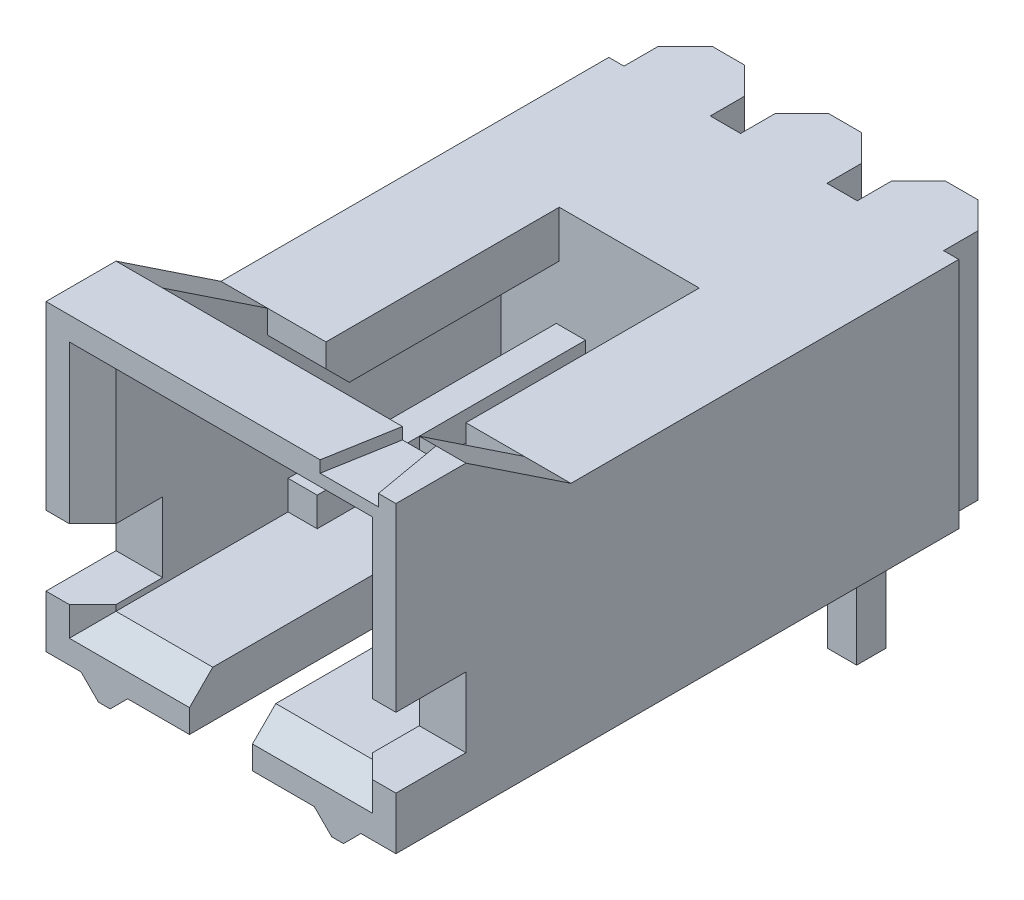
ISO-10303-21;
HEADER;
FILE_DESCRIPTION(('STEP AP214'),'2;1');
FILE_NAME('part.step','',(''),(''),'','','');
FILE_SCHEMA(('AUTOMOTIVE_DESIGN { 1 0 10303 214 1 1 1 1 }'));
ENDSEC;
DATA;
#1=APPLICATION_CONTEXT('core data for automotive mechanical design processes');
#2=APPLICATION_PROTOCOL_DEFINITION('international standard','automotive_design',2000,#1);
#3=PRODUCT_CONTEXT('',#1,'mechanical');
#4=PRODUCT('Part','Part','',(#3));
#5=PRODUCT_RELATED_PRODUCT_CATEGORY('part','',(#4));
#6=PRODUCT_DEFINITION_FORMATION('','',#4);
#7=PRODUCT_DEFINITION_CONTEXT('part definition',#1,'design');
#8=PRODUCT_DEFINITION('design','',#6,#7);
#9=PRODUCT_DEFINITION_SHAPE('','',#8);
#10=(LENGTH_UNIT() NAMED_UNIT(*) SI_UNIT(.MILLI.,.METRE.));
#11=(NAMED_UNIT(*) PLANE_ANGLE_UNIT() SI_UNIT($,.RADIAN.));
#12=(NAMED_UNIT(*) SI_UNIT($,.STERADIAN.) SOLID_ANGLE_UNIT());
#13=UNCERTAINTY_MEASURE_WITH_UNIT(LENGTH_MEASURE(1.E-05),#10,'distance_accuracy_value','');
#14=(GEOMETRIC_REPRESENTATION_CONTEXT(3) GLOBAL_UNCERTAINTY_ASSIGNED_CONTEXT((#13)) GLOBAL_UNIT_ASSIGNED_CONTEXT((#10,
#11,#12)) REPRESENTATION_CONTEXT('',''));
#15=CARTESIAN_POINT('',(0.,0.,0.));
#16=DIRECTION('',(0.,0.,1.));
#17=DIRECTION('',(1.,0.,0.));
#18=AXIS2_PLACEMENT_3D('',#15,#16,#17);
#19=CARTESIAN_POINT('',(-3.81,-2.54,-13.589));
#20=DIRECTION('',(0.,0.,-1.));
#21=DIRECTION('',(-1.,0.,0.));
#22=AXIS2_PLACEMENT_3D('',#19,#20,#21);
#23=PLANE('',#22);
#24=DIRECTION('',(-1.,0.,0.));
#25=VECTOR('',#24,1.);
#26=CARTESIAN_POINT('',(-3.81,-2.54,-13.589));
#27=LINE('',#26,#25);
#28=CARTESIAN_POINT('',(0.3556,-2.54,-13.589));
#29=VERTEX_POINT('',#28);
#30=CARTESIAN_POINT('',(-0.3556,-2.54,-13.589));
#31=VERTEX_POINT('',#30);
#32=EDGE_CURVE('E946',#29,#31,#27,.T.);
#33=ORIENTED_EDGE('',*,*,#32,.T.);
#34=DIRECTION('',(0.,1.,0.));
#35=VECTOR('',#34,1.);
#36=CARTESIAN_POINT('',(-0.3556,2.54,-13.589));
#37=LINE('',#36,#35);
#38=CARTESIAN_POINT('',(-0.3556,2.54,-13.589));
#39=VERTEX_POINT('',#38);
#40=EDGE_CURVE('E956',#31,#39,#37,.T.);
#41=ORIENTED_EDGE('',*,*,#40,.T.);
#42=DIRECTION('',(-1.,0.,0.));
#43=VECTOR('',#42,1.);
#44=CARTESIAN_POINT('',(-3.81,2.54,-13.589));
#45=LINE('',#44,#43);
#46=CARTESIAN_POINT('',(0.3556,2.54,-13.589));
#47=VERTEX_POINT('',#46);
#48=EDGE_CURVE('E948',#39,#47,#45,.F.);
#49=ORIENTED_EDGE('',*,*,#48,.T.);
#50=DIRECTION('',(0.,1.,0.));
#51=VECTOR('',#50,1.);
#52=CARTESIAN_POINT('',(0.3556,2.54,-13.589));
#53=LINE('',#52,#51);
#54=EDGE_CURVE('E940',#47,#29,#53,.F.);
#55=ORIENTED_EDGE('',*,*,#54,.T.);
#56=EDGE_LOOP('',(#33,#41,#49,#55));
#57=FACE_BOUND('',#56,.T.);
#58=ADVANCED_FACE('F14',(#57),#23,.T.);
#59=CARTESIAN_POINT('',(0.3556,2.54,-13.589));
#60=DIRECTION('',(-0.707106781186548,0.,0.707106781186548));
#61=DIRECTION('',(0.707106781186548,0.,0.707106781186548));
#62=AXIS2_PLACEMENT_3D('',#59,#60,#61);
#63=PLANE('',#62);
#64=DIRECTION('',(0.707106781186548,0.,0.707106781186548));
#65=VECTOR('',#64,1.);
#66=CARTESIAN_POINT('',(0.3556,2.54,-13.589));
#67=LINE('',#66,#65);
#68=CARTESIAN_POINT('',(0.9398,2.54,-13.0048));
#69=VERTEX_POINT('',#68);
#70=EDGE_CURVE('E941',#69,#47,#67,.F.);
#71=ORIENTED_EDGE('',*,*,#70,.F.);
#72=DIRECTION('',(0.,1.,0.));
#73=VECTOR('',#72,1.);
#74=CARTESIAN_POINT('',(0.9398,2.54,-13.0048));
#75=LINE('',#74,#73);
#76=CARTESIAN_POINT('',(0.9398,-2.54,-13.0048));
#77=VERTEX_POINT('',#76);
#78=EDGE_CURVE('E906',#69,#77,#75,.F.);
#79=ORIENTED_EDGE('',*,*,#78,.T.);
#80=DIRECTION('',(0.707106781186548,0.,0.707106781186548));
#81=VECTOR('',#80,1.);
#82=CARTESIAN_POINT('',(0.3556,-2.54,-13.589));
#83=LINE('',#82,#81);
#84=EDGE_CURVE('E943',#29,#77,#83,.T.);
#85=ORIENTED_EDGE('',*,*,#84,.F.);
#86=ORIENTED_EDGE('',*,*,#54,.F.);
#87=EDGE_LOOP('',(#71,#79,#85,#86));
#88=FACE_BOUND('',#87,.T.);
#89=ADVANCED_FACE('F1839',(#88),#63,.F.);
#90=CARTESIAN_POINT('',(2.27,-1.27,-11.303));
#91=DIRECTION('',(-1.,0.,0.));
#92=DIRECTION('',(0.,0.,1.));
#93=AXIS2_PLACEMENT_3D('',#90,#91,#92);
#94=CYLINDRICAL_SURFACE('',#93,1.5875);
#95=CARTESIAN_POINT('',(0.9525,-1.27,-11.303));
#96=DIRECTION('',(-1.,0.,0.));
#97=DIRECTION('',(0.,0.,1.));
#98=AXIS2_PLACEMENT_3D('',#95,#96,#97);
#99=CIRCLE('',#98,1.5875);
#100=CARTESIAN_POINT('',(0.9525,0.,-12.2555));
#101=VERTEX_POINT('',#100);
#102=CARTESIAN_POINT('',(0.9525,-1.27,-12.8905));
#103=VERTEX_POINT('',#102);
#104=EDGE_CURVE('E191',#101,#103,#99,.T.);
#105=ORIENTED_EDGE('',*,*,#104,.F.);
#106=DIRECTION('',(-1.,0.,0.));
#107=VECTOR('',#106,1.);
#108=CARTESIAN_POINT('',(2.27,0.,-12.2555));
#109=LINE('',#108,#107);
#110=CARTESIAN_POINT('',(1.5875,0.,-12.2555));
#111=VERTEX_POINT('',#110);
#112=EDGE_CURVE('E172',#101,#111,#109,.F.);
#113=ORIENTED_EDGE('',*,*,#112,.T.);
#114=CARTESIAN_POINT('',(1.5875,-1.27,-11.303));
#115=DIRECTION('',(-1.,0.,0.));
#116=DIRECTION('',(0.,0.,1.));
#117=AXIS2_PLACEMENT_3D('',#114,#115,#116);
#118=CIRCLE('',#117,1.5875);
#119=CARTESIAN_POINT('',(1.5875,-1.27,-12.8905));
#120=VERTEX_POINT('',#119);
#121=EDGE_CURVE('E18',#120,#111,#118,.F.);
#122=ORIENTED_EDGE('',*,*,#121,.F.);
#123=DIRECTION('',(-1.,0.,0.));
#124=VECTOR('',#123,1.);
#125=CARTESIAN_POINT('',(0.9525,-1.27,-12.8905));
#126=LINE('',#125,#124);
#127=EDGE_CURVE('E160',#103,#120,#126,.F.);
#128=ORIENTED_EDGE('',*,*,#127,.F.);
#129=EDGE_LOOP('',(#105,#113,#122,#128));
#130=FACE_BOUND('',#129,.T.);
#131=ADVANCED_FACE('F176',(#130),#94,.T.);
#132=CARTESIAN_POINT('',(0.9525,-1.27,-12.8905));
#133=DIRECTION('',(0.,0.,-1.));
#134=DIRECTION('',(-1.,0.,0.));
#135=AXIS2_PLACEMENT_3D('',#132,#133,#134);
#136=PLANE('',#135);
#137=DIRECTION('',(0.,1.,0.));
#138=VECTOR('',#137,1.);
#139=CARTESIAN_POINT('',(0.9525,-0.3175,-12.8905));
#140=LINE('',#139,#138);
#141=CARTESIAN_POINT('',(0.9525,-6.223,-12.8905));
#142=VERTEX_POINT('',#141);
#143=EDGE_CURVE('E167',#103,#142,#140,.F.);
#144=ORIENTED_EDGE('',*,*,#143,.F.);
#145=ORIENTED_EDGE('',*,*,#127,.T.);
#146=DIRECTION('',(0.,1.,0.));
#147=VECTOR('',#146,1.);
#148=CARTESIAN_POINT('',(1.5875,0.3175,-12.8905));
#149=LINE('',#148,#147);
#150=CARTESIAN_POINT('',(1.5875,-6.223,-12.8905));
#151=VERTEX_POINT('',#150);
#152=EDGE_CURVE('E164',#151,#120,#149,.T.);
#153=ORIENTED_EDGE('',*,*,#152,.F.);
#154=DIRECTION('',(1.,0.,0.));
#155=VECTOR('',#154,1.);
#156=CARTESIAN_POINT('',(1.27,-6.223,-12.8905));
#157=LINE('',#156,#155);
#158=EDGE_CURVE('E171',#142,#151,#157,.T.);
#159=ORIENTED_EDGE('',*,*,#158,.F.);
#160=EDGE_LOOP('',(#144,#145,#153,#159));
#161=FACE_BOUND('',#160,.T.);
#162=ADVANCED_FACE('F162',(#161),#136,.T.);
#163=CARTESIAN_POINT('',(1.27,-6.223,-12.573));
#164=DIRECTION('',(0.,-1.,0.));
#165=DIRECTION('',(0.,0.,-1.));
#166=AXIS2_PLACEMENT_3D('',#163,#164,#165);
#167=PLANE('',#166);
#168=ORIENTED_EDGE('',*,*,#158,.T.);
#169=DIRECTION('',(0.,0.,-1.));
#170=VECTOR('',#169,1.);
#171=CARTESIAN_POINT('',(1.5875,-6.223,-3.048));
#172=LINE('',#171,#170);
#173=CARTESIAN_POINT('',(1.5875,-6.223,-12.2555));
#174=VERTEX_POINT('',#173);
#175=EDGE_CURVE('E184',#174,#151,#172,.T.);
#176=ORIENTED_EDGE('',*,*,#175,.F.);
#177=DIRECTION('',(1.,0.,0.));
#178=VECTOR('',#177,1.);
#179=CARTESIAN_POINT('',(1.5875,-6.223,-12.2555));
#180=LINE('',#179,#178);
#181=CARTESIAN_POINT('',(0.9525,-6.223,-12.2555));
#182=VERTEX_POINT('',#181);
#183=EDGE_CURVE('E934',#182,#174,#180,.T.);
#184=ORIENTED_EDGE('',*,*,#183,.F.);
#185=DIRECTION('',(0.,0.,1.));
#186=VECTOR('',#185,1.);
#187=CARTESIAN_POINT('',(0.9525,-6.223,-3.048));
#188=LINE('',#187,#186);
#189=EDGE_CURVE('E190',#142,#182,#188,.T.);
#190=ORIENTED_EDGE('',*,*,#189,.F.);
#191=EDGE_LOOP('',(#168,#176,#184,#190));
#192=FACE_BOUND('',#191,.T.);
#193=ADVANCED_FACE('F978',(#192),#167,.T.);
#194=CARTESIAN_POINT('',(1.5875,-1.27,-12.2555));
#195=DIRECTION('',(0.,0.,1.));
#196=DIRECTION('',(1.,0.,0.));
#197=AXIS2_PLACEMENT_3D('',#194,#195,#196);
#198=PLANE('',#197);
#199=DIRECTION('',(0.,1.,0.));
#200=VECTOR('',#199,1.);
#201=CARTESIAN_POINT('',(1.5875,0.3175,-12.2555));
#202=LINE('',#201,#200);
#203=CARTESIAN_POINT('',(1.5875,-2.54,-12.2555));
#204=VERTEX_POINT('',#203);
#205=EDGE_CURVE('E186',#204,#174,#202,.F.);
#206=ORIENTED_EDGE('',*,*,#205,.F.);
#207=DIRECTION('',(1.,0.,0.));
#208=VECTOR('',#207,1.);
#209=CARTESIAN_POINT('',(1.5875,-2.54,-12.2555));
#210=LINE('',#209,#208);
#211=CARTESIAN_POINT('',(0.9525,-2.54,-12.2555));
#212=VERTEX_POINT('',#211);
#213=EDGE_CURVE('E931',#204,#212,#210,.F.);
#214=ORIENTED_EDGE('',*,*,#213,.T.);
#215=DIRECTION('',(0.,1.,0.));
#216=VECTOR('',#215,1.);
#217=CARTESIAN_POINT('',(0.9525,-0.3175,-12.2555));
#218=LINE('',#217,#216);
#219=EDGE_CURVE('E889',#182,#212,#218,.T.);
#220=ORIENTED_EDGE('',*,*,#219,.F.);
#221=ORIENTED_EDGE('',*,*,#183,.T.);
#222=EDGE_LOOP('',(#206,#214,#220,#221));
#223=FACE_BOUND('',#222,.T.);
#224=ADVANCED_FACE('F975',(#223),#198,.T.);
#225=CARTESIAN_POINT('',(-0.9398,2.54,-13.0048));
#226=DIRECTION('',(0.707106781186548,0.,0.707106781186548));
#227=DIRECTION('',(0.707106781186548,0.,-0.707106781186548));
#228=AXIS2_PLACEMENT_3D('',#225,#226,#227);
#229=PLANE('',#228);
#230=DIRECTION('',(0.707106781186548,0.,-0.707106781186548));
#231=VECTOR('',#230,1.);
#232=CARTESIAN_POINT('',(-0.9398,2.54,-13.0048));
#233=LINE('',#232,#231);
#234=CARTESIAN_POINT('',(-0.9398,2.54,-13.0048));
#235=VERTEX_POINT('',#234);
#236=EDGE_CURVE('E928',#39,#235,#233,.F.);
#237=ORIENTED_EDGE('',*,*,#236,.F.);
#238=ORIENTED_EDGE('',*,*,#40,.F.);
#239=DIRECTION('',(0.707106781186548,0.,-0.707106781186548));
#240=VECTOR('',#239,1.);
#241=CARTESIAN_POINT('',(-0.9398,-2.54,-13.0048));
#242=LINE('',#241,#240);
#243=CARTESIAN_POINT('',(-0.939799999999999,-2.54,-13.0048));
#244=VERTEX_POINT('',#243);
#245=EDGE_CURVE('E933',#244,#31,#242,.T.);
#246=ORIENTED_EDGE('',*,*,#245,.F.);
#247=DIRECTION('',(0.,1.,0.));
#248=VECTOR('',#247,1.);
#249=CARTESIAN_POINT('',(-0.9398,2.54,-13.0048));
#250=LINE('',#249,#248);
#251=EDGE_CURVE('E201',#244,#235,#250,.T.);
#252=ORIENTED_EDGE('',*,*,#251,.T.);
#253=EDGE_LOOP('',(#237,#238,#246,#252));
#254=FACE_BOUND('',#253,.T.);
#255=ADVANCED_FACE('F986',(#254),#229,.F.);
#256=CARTESIAN_POINT('',(-0.27,-1.27,-11.303));
#257=DIRECTION('',(-1.,0.,0.));
#258=DIRECTION('',(0.,0.,1.));
#259=AXIS2_PLACEMENT_3D('',#256,#257,#258);
#260=CYLINDRICAL_SURFACE('',#259,1.5875);
#261=CARTESIAN_POINT('',(-1.5875,-1.27,-11.303));
#262=DIRECTION('',(-1.,0.,0.));
#263=DIRECTION('',(0.,0.,1.));
#264=AXIS2_PLACEMENT_3D('',#261,#262,#263);
#265=CIRCLE('',#264,1.5875);
#266=CARTESIAN_POINT('',(-1.5875,0.,-12.2555));
#267=VERTEX_POINT('',#266);
#268=CARTESIAN_POINT('',(-1.5875,-1.27,-12.8905));
#269=VERTEX_POINT('',#268);
#270=EDGE_CURVE('E200',#267,#269,#265,.T.);
#271=ORIENTED_EDGE('',*,*,#270,.F.);
#272=DIRECTION('',(-1.,0.,0.));
#273=VECTOR('',#272,1.);
#274=CARTESIAN_POINT('',(-0.27,0.,-12.2555));
#275=LINE('',#274,#273);
#276=CARTESIAN_POINT('',(-0.9525,0.,-12.2555));
#277=VERTEX_POINT('',#276);
#278=EDGE_CURVE('E926',#267,#277,#275,.F.);
#279=ORIENTED_EDGE('',*,*,#278,.T.);
#280=CARTESIAN_POINT('',(-0.9525,-1.27,-11.303));
#281=DIRECTION('',(-1.,0.,0.));
#282=DIRECTION('',(0.,0.,1.));
#283=AXIS2_PLACEMENT_3D('',#280,#281,#282);
#284=CIRCLE('',#283,1.5875);
#285=CARTESIAN_POINT('',(-0.9525,-1.27,-12.8905));
#286=VERTEX_POINT('',#285);
#287=EDGE_CURVE('E195',#286,#277,#284,.F.);
#288=ORIENTED_EDGE('',*,*,#287,.F.);
#289=DIRECTION('',(-1.,0.,0.));
#290=VECTOR('',#289,1.);
#291=CARTESIAN_POINT('',(-1.5875,-1.27,-12.8905));
#292=LINE('',#291,#290);
#293=EDGE_CURVE('E924',#269,#286,#292,.F.);
#294=ORIENTED_EDGE('',*,*,#293,.F.);
#295=EDGE_LOOP('',(#271,#279,#288,#294));
#296=FACE_BOUND('',#295,.T.);
#297=ADVANCED_FACE('F1681',(#296),#260,.T.);
#298=CARTESIAN_POINT('',(-1.5875,-1.27,-12.8905));
#299=DIRECTION('',(0.,0.,-1.));
#300=DIRECTION('',(-1.,0.,0.));
#301=AXIS2_PLACEMENT_3D('',#298,#299,#300);
#302=PLANE('',#301);
#303=DIRECTION('',(0.,1.,0.));
#304=VECTOR('',#303,1.);
#305=CARTESIAN_POINT('',(-1.5875,-0.3175,-12.8905));
#306=LINE('',#305,#304);
#307=CARTESIAN_POINT('',(-1.5875,-6.223,-12.8905));
#308=VERTEX_POINT('',#307);
#309=EDGE_CURVE('E207',#269,#308,#306,.F.);
#310=ORIENTED_EDGE('',*,*,#309,.F.);
#311=ORIENTED_EDGE('',*,*,#293,.T.);
#312=DIRECTION('',(0.,1.,0.));
#313=VECTOR('',#312,1.);
#314=CARTESIAN_POINT('',(-0.9525,0.3175,-12.8905));
#315=LINE('',#314,#313);
#316=CARTESIAN_POINT('',(-0.9525,-6.223,-12.8905));
#317=VERTEX_POINT('',#316);
#318=EDGE_CURVE('E192',#317,#286,#315,.T.);
#319=ORIENTED_EDGE('',*,*,#318,.F.);
#320=DIRECTION('',(1.,0.,0.));
#321=VECTOR('',#320,1.);
#322=CARTESIAN_POINT('',(-1.27,-6.223,-12.8905));
#323=LINE('',#322,#321);
#324=EDGE_CURVE('E920',#308,#317,#323,.T.);
#325=ORIENTED_EDGE('',*,*,#324,.F.);
#326=EDGE_LOOP('',(#310,#311,#319,#325));
#327=FACE_BOUND('',#326,.T.);
#328=ADVANCED_FACE('F1677',(#327),#302,.T.);
#329=CARTESIAN_POINT('',(-1.27,-6.223,-12.573));
#330=DIRECTION('',(0.,-1.,0.));
#331=DIRECTION('',(0.,0.,-1.));
#332=AXIS2_PLACEMENT_3D('',#329,#330,#331);
#333=PLANE('',#332);
#334=ORIENTED_EDGE('',*,*,#324,.T.);
#335=DIRECTION('',(0.,0.,-1.));
#336=VECTOR('',#335,1.);
#337=CARTESIAN_POINT('',(-0.9525,-6.223,-3.048));
#338=LINE('',#337,#336);
#339=CARTESIAN_POINT('',(-0.9525,-6.223,-12.2555));
#340=VERTEX_POINT('',#339);
#341=EDGE_CURVE('E196',#340,#317,#338,.T.);
#342=ORIENTED_EDGE('',*,*,#341,.F.);
#343=DIRECTION('',(1.,0.,0.));
#344=VECTOR('',#343,1.);
#345=CARTESIAN_POINT('',(-0.9525,-6.223,-12.2555));
#346=LINE('',#345,#344);
#347=CARTESIAN_POINT('',(-1.5875,-6.223,-12.2555));
#348=VERTEX_POINT('',#347);
#349=EDGE_CURVE('E918',#348,#340,#346,.T.);
#350=ORIENTED_EDGE('',*,*,#349,.F.);
#351=DIRECTION('',(0.,0.,1.));
#352=VECTOR('',#351,1.);
#353=CARTESIAN_POINT('',(-1.5875,-6.223,-3.048));
#354=LINE('',#353,#352);
#355=EDGE_CURVE('E210',#308,#348,#354,.T.);
#356=ORIENTED_EDGE('',*,*,#355,.F.);
#357=EDGE_LOOP('',(#334,#342,#350,#356));
#358=FACE_BOUND('',#357,.T.);
#359=ADVANCED_FACE('F1673',(#358),#333,.T.);
#360=CARTESIAN_POINT('',(-0.9525,-1.27,-12.2555));
#361=DIRECTION('',(0.,0.,1.));
#362=DIRECTION('',(1.,0.,0.));
#363=AXIS2_PLACEMENT_3D('',#360,#361,#362);
#364=PLANE('',#363);
#365=DIRECTION('',(0.,1.,0.));
#366=VECTOR('',#365,1.);
#367=CARTESIAN_POINT('',(-0.9525,0.3175,-12.2555));
#368=LINE('',#367,#366);
#369=CARTESIAN_POINT('',(-0.9525,-2.54,-12.2555));
#370=VERTEX_POINT('',#369);
#371=EDGE_CURVE('E886',#370,#340,#368,.F.);
#372=ORIENTED_EDGE('',*,*,#371,.F.);
#373=DIRECTION('',(1.,0.,0.));
#374=VECTOR('',#373,1.);
#375=CARTESIAN_POINT('',(-0.9525,-2.54,-12.2555));
#376=LINE('',#375,#374);
#377=CARTESIAN_POINT('',(-1.5875,-2.54,-12.2555));
#378=VERTEX_POINT('',#377);
#379=EDGE_CURVE('E914',#370,#378,#376,.F.);
#380=ORIENTED_EDGE('',*,*,#379,.T.);
#381=DIRECTION('',(0.,1.,0.));
#382=VECTOR('',#381,1.);
#383=CARTESIAN_POINT('',(-1.5875,-0.3175,-12.2555));
#384=LINE('',#383,#382);
#385=EDGE_CURVE('E871',#348,#378,#384,.T.);
#386=ORIENTED_EDGE('',*,*,#385,.F.);
#387=ORIENTED_EDGE('',*,*,#349,.T.);
#388=EDGE_LOOP('',(#372,#380,#386,#387));
#389=FACE_BOUND('',#388,.T.);
#390=ADVANCED_FACE('F1670',(#389),#364,.T.);
#391=CARTESIAN_POINT('',(1.5875,0.3175,-3.048));
#392=DIRECTION('',(1.,0.,0.));
#393=DIRECTION('',(0.,0.,-1.));
#394=AXIS2_PLACEMENT_3D('',#391,#392,#393);
#395=PLANE('',#394);
#396=ORIENTED_EDGE('',*,*,#121,.T.);
#397=DIRECTION('',(0.,1.,0.));
#398=VECTOR('',#397,1.);
#399=CARTESIAN_POINT('',(1.5875,2.54,-12.2555));
#400=LINE('',#399,#398);
#401=EDGE_CURVE('E874',#111,#204,#400,.F.);
#402=ORIENTED_EDGE('',*,*,#401,.T.);
#403=ORIENTED_EDGE('',*,*,#205,.T.);
#404=ORIENTED_EDGE('',*,*,#175,.T.);
#405=ORIENTED_EDGE('',*,*,#152,.T.);
#406=EDGE_LOOP('',(#396,#402,#403,#404,#405));
#407=FACE_BOUND('',#406,.T.);
#408=ADVANCED_FACE('F181',(#407),#395,.T.);
#409=CARTESIAN_POINT('',(0.9398,2.54,-13.0048));
#410=DIRECTION('',(-1.,0.,0.));
#411=DIRECTION('',(0.,0.,1.));
#412=AXIS2_PLACEMENT_3D('',#409,#410,#411);
#413=PLANE('',#412);
#414=DIRECTION('',(0.,0.,1.));
#415=VECTOR('',#414,1.);
#416=CARTESIAN_POINT('',(0.9398,2.54,-13.0048));
#417=LINE('',#416,#415);
#418=CARTESIAN_POINT('',(0.9398,2.54,-12.2555));
#419=VERTEX_POINT('',#418);
#420=EDGE_CURVE('E904',#419,#69,#417,.F.);
#421=ORIENTED_EDGE('',*,*,#420,.F.);
#422=DIRECTION('',(0.,1.,0.));
#423=VECTOR('',#422,1.);
#424=CARTESIAN_POINT('',(0.9398,2.54,-12.2555));
#425=LINE('',#424,#423);
#426=CARTESIAN_POINT('',(0.9398,-2.54,-12.2555));
#427=VERTEX_POINT('',#426);
#428=EDGE_CURVE('E899',#419,#427,#425,.F.);
#429=ORIENTED_EDGE('',*,*,#428,.T.);
#430=DIRECTION('',(0.,0.,1.));
#431=VECTOR('',#430,1.);
#432=CARTESIAN_POINT('',(0.9398,-2.54,-13.0048));
#433=LINE('',#432,#431);
#434=EDGE_CURVE('E180',#77,#427,#433,.T.);
#435=ORIENTED_EDGE('',*,*,#434,.F.);
#436=ORIENTED_EDGE('',*,*,#78,.F.);
#437=EDGE_LOOP('',(#421,#429,#435,#436));
#438=FACE_BOUND('',#437,.T.);
#439=ADVANCED_FACE('F1664',(#438),#413,.F.);
#440=CARTESIAN_POINT('',(0.9525,-0.3175,-3.048));
#441=DIRECTION('',(-1.,0.,0.));
#442=DIRECTION('',(0.,0.,1.));
#443=AXIS2_PLACEMENT_3D('',#440,#441,#442);
#444=PLANE('',#443);
#445=ORIENTED_EDGE('',*,*,#219,.T.);
#446=DIRECTION('',(0.,1.,0.));
#447=VECTOR('',#446,1.);
#448=CARTESIAN_POINT('',(0.9525,2.54,-12.2555));
#449=LINE('',#448,#447);
#450=EDGE_CURVE('E885',#212,#101,#449,.T.);
#451=ORIENTED_EDGE('',*,*,#450,.T.);
#452=ORIENTED_EDGE('',*,*,#104,.T.);
#453=ORIENTED_EDGE('',*,*,#143,.T.);
#454=ORIENTED_EDGE('',*,*,#189,.T.);
#455=EDGE_LOOP('',(#445,#451,#452,#453,#454));
#456=FACE_BOUND('',#455,.T.);
#457=ADVANCED_FACE('F965',(#456),#444,.T.);
#458=CARTESIAN_POINT('',(-0.9525,0.3175,-3.048));
#459=DIRECTION('',(1.,0.,0.));
#460=DIRECTION('',(0.,0.,-1.));
#461=AXIS2_PLACEMENT_3D('',#458,#459,#460);
#462=PLANE('',#461);
#463=ORIENTED_EDGE('',*,*,#287,.T.);
#464=DIRECTION('',(0.,1.,0.));
#465=VECTOR('',#464,1.);
#466=CARTESIAN_POINT('',(-0.9525,2.54,-12.2555));
#467=LINE('',#466,#465);
#468=EDGE_CURVE('E882',#277,#370,#467,.F.);
#469=ORIENTED_EDGE('',*,*,#468,.T.);
#470=ORIENTED_EDGE('',*,*,#371,.T.);
#471=ORIENTED_EDGE('',*,*,#341,.T.);
#472=ORIENTED_EDGE('',*,*,#318,.T.);
#473=EDGE_LOOP('',(#463,#469,#470,#471,#472));
#474=FACE_BOUND('',#473,.T.);
#475=ADVANCED_FACE('F1657',(#474),#462,.T.);
#476=CARTESIAN_POINT('',(-0.9398,2.54,-12.2555));
#477=DIRECTION('',(1.,0.,0.));
#478=DIRECTION('',(0.,0.,-1.));
#479=AXIS2_PLACEMENT_3D('',#476,#477,#478);
#480=PLANE('',#479);
#481=DIRECTION('',(0.,0.,-1.));
#482=VECTOR('',#481,1.);
#483=CARTESIAN_POINT('',(-0.9398,2.54,-12.2555));
#484=LINE('',#483,#482);
#485=CARTESIAN_POINT('',(-0.9398,2.54,-12.2555));
#486=VERTEX_POINT('',#485);
#487=EDGE_CURVE('E197',#235,#486,#484,.F.);
#488=ORIENTED_EDGE('',*,*,#487,.F.);
#489=ORIENTED_EDGE('',*,*,#251,.F.);
#490=DIRECTION('',(0.,0.,-1.));
#491=VECTOR('',#490,1.);
#492=CARTESIAN_POINT('',(-0.9398,-2.54,-12.2555));
#493=LINE('',#492,#491);
#494=CARTESIAN_POINT('',(-0.9398,-2.54,-12.2555));
#495=VERTEX_POINT('',#494);
#496=EDGE_CURVE('E204',#495,#244,#493,.T.);
#497=ORIENTED_EDGE('',*,*,#496,.F.);
#498=DIRECTION('',(0.,1.,0.));
#499=VECTOR('',#498,1.);
#500=CARTESIAN_POINT('',(-0.9398,2.54,-12.2555));
#501=LINE('',#500,#499);
#502=EDGE_CURVE('E215',#495,#486,#501,.T.);
#503=ORIENTED_EDGE('',*,*,#502,.T.);
#504=EDGE_LOOP('',(#488,#489,#497,#503));
#505=FACE_BOUND('',#504,.T.);
#506=ADVANCED_FACE('F1653',(#505),#480,.F.);
#507=CARTESIAN_POINT('',(-1.5875,-0.3175,-3.048));
#508=DIRECTION('',(-1.,0.,0.));
#509=DIRECTION('',(0.,0.,1.));
#510=AXIS2_PLACEMENT_3D('',#507,#508,#509);
#511=PLANE('',#510);
#512=ORIENTED_EDGE('',*,*,#385,.T.);
#513=DIRECTION('',(0.,1.,0.));
#514=VECTOR('',#513,1.);
#515=CARTESIAN_POINT('',(-1.5875,2.54,-12.2555));
#516=LINE('',#515,#514);
#517=EDGE_CURVE('E223',#378,#267,#516,.T.);
#518=ORIENTED_EDGE('',*,*,#517,.T.);
#519=ORIENTED_EDGE('',*,*,#270,.T.);
#520=ORIENTED_EDGE('',*,*,#309,.T.);
#521=ORIENTED_EDGE('',*,*,#355,.T.);
#522=EDGE_LOOP('',(#512,#518,#519,#520,#521));
#523=FACE_BOUND('',#522,.T.);
#524=ADVANCED_FACE('F1650',(#523),#511,.T.);
#525=CARTESIAN_POINT('',(0.9398,2.54,-12.2555));
#526=DIRECTION('',(0.,0.,1.));
#527=DIRECTION('',(1.,0.,0.));
#528=AXIS2_PLACEMENT_3D('',#525,#526,#527);
#529=PLANE('',#528);
#530=ORIENTED_EDGE('',*,*,#450,.F.);
#531=DIRECTION('',(1.,0.,0.));
#532=VECTOR('',#531,1.);
#533=CARTESIAN_POINT('',(0.9398,-2.54,-12.2555));
#534=LINE('',#533,#532);
#535=EDGE_CURVE('E894',#427,#212,#534,.T.);
#536=ORIENTED_EDGE('',*,*,#535,.F.);
#537=ORIENTED_EDGE('',*,*,#428,.F.);
#538=DIRECTION('',(1.,0.,0.));
#539=VECTOR('',#538,1.);
#540=CARTESIAN_POINT('',(0.9398,2.54,-12.2555));
#541=LINE('',#540,#539);
#542=CARTESIAN_POINT('',(1.6002,2.54,-12.2555));
#543=VERTEX_POINT('',#542);
#544=EDGE_CURVE('E902',#543,#419,#541,.F.);
#545=ORIENTED_EDGE('',*,*,#544,.F.);
#546=DIRECTION('',(0.,1.,0.));
#547=VECTOR('',#546,1.);
#548=CARTESIAN_POINT('',(1.6002,2.54,-12.2555));
#549=LINE('',#548,#547);
#550=CARTESIAN_POINT('',(1.6002,-2.54,-12.2555));
#551=VERTEX_POINT('',#550);
#552=EDGE_CURVE('E879',#543,#551,#549,.F.);
#553=ORIENTED_EDGE('',*,*,#552,.T.);
#554=DIRECTION('',(1.,0.,0.));
#555=VECTOR('',#554,1.);
#556=CARTESIAN_POINT('',(0.9398,-2.54,-12.2555));
#557=LINE('',#556,#555);
#558=EDGE_CURVE('E908',#204,#551,#557,.T.);
#559=ORIENTED_EDGE('',*,*,#558,.F.);
#560=ORIENTED_EDGE('',*,*,#401,.F.);
#561=ORIENTED_EDGE('',*,*,#112,.F.);
#562=EDGE_LOOP('',(#530,#536,#537,#545,#553,#559,#560,#561));
#563=FACE_BOUND('',#562,.T.);
#564=ADVANCED_FACE('F970',(#563),#529,.F.);
#565=CARTESIAN_POINT('',(-1.6002,2.54,-12.2555));
#566=DIRECTION('',(0.,0.,1.));
#567=DIRECTION('',(1.,0.,0.));
#568=AXIS2_PLACEMENT_3D('',#565,#566,#567);
#569=PLANE('',#568);
#570=ORIENTED_EDGE('',*,*,#517,.F.);
#571=DIRECTION('',(1.,0.,0.));
#572=VECTOR('',#571,1.);
#573=CARTESIAN_POINT('',(-1.6002,-2.54,-12.2555));
#574=LINE('',#573,#572);
#575=CARTESIAN_POINT('',(-1.6002,-2.54,-12.2555));
#576=VERTEX_POINT('',#575);
#577=EDGE_CURVE('E214',#576,#378,#574,.T.);
#578=ORIENTED_EDGE('',*,*,#577,.F.);
#579=DIRECTION('',(0.,1.,0.));
#580=VECTOR('',#579,1.);
#581=CARTESIAN_POINT('',(-1.6002,2.54,-12.2555));
#582=LINE('',#581,#580);
#583=CARTESIAN_POINT('',(-1.6002,2.54,-12.2555));
#584=VERTEX_POINT('',#583);
#585=EDGE_CURVE('E228',#576,#584,#582,.T.);
#586=ORIENTED_EDGE('',*,*,#585,.T.);
#587=DIRECTION('',(1.,0.,0.));
#588=VECTOR('',#587,1.);
#589=CARTESIAN_POINT('',(-1.6002,2.54,-12.2555));
#590=LINE('',#589,#588);
#591=EDGE_CURVE('E211',#486,#584,#590,.F.);
#592=ORIENTED_EDGE('',*,*,#591,.F.);
#593=ORIENTED_EDGE('',*,*,#502,.F.);
#594=DIRECTION('',(1.,0.,0.));
#595=VECTOR('',#594,1.);
#596=CARTESIAN_POINT('',(-1.6002,-2.54,-12.2555));
#597=LINE('',#596,#595);
#598=EDGE_CURVE('E218',#370,#495,#597,.T.);
#599=ORIENTED_EDGE('',*,*,#598,.F.);
#600=ORIENTED_EDGE('',*,*,#468,.F.);
#601=ORIENTED_EDGE('',*,*,#278,.F.);
#602=EDGE_LOOP('',(#570,#578,#586,#592,#593,#599,#600,#601));
#603=FACE_BOUND('',#602,.T.);
#604=ADVANCED_FACE('F1008',(#603),#569,.F.);
#605=CARTESIAN_POINT('',(1.6002,2.54,-12.2555));
#606=DIRECTION('',(1.,0.,0.));
#607=DIRECTION('',(0.,0.,-1.));
#608=AXIS2_PLACEMENT_3D('',#605,#606,#607);
#609=PLANE('',#608);
#610=DIRECTION('',(0.,0.,-1.));
#611=VECTOR('',#610,1.);
#612=CARTESIAN_POINT('',(1.6002,2.54,-12.2555));
#613=LINE('',#612,#611);
#614=CARTESIAN_POINT('',(1.6002,2.54,-13.0048));
#615=VERTEX_POINT('',#614);
#616=EDGE_CURVE('E222',#615,#543,#613,.F.);
#617=ORIENTED_EDGE('',*,*,#616,.F.);
#618=DIRECTION('',(0.,1.,0.));
#619=VECTOR('',#618,1.);
#620=CARTESIAN_POINT('',(1.6002,2.54,-13.0048));
#621=LINE('',#620,#619);
#622=CARTESIAN_POINT('',(1.6002,-2.54,-13.0048));
#623=VERTEX_POINT('',#622);
#624=EDGE_CURVE('E229',#615,#623,#621,.F.);
#625=ORIENTED_EDGE('',*,*,#624,.T.);
#626=DIRECTION('',(0.,0.,-1.));
#627=VECTOR('',#626,1.);
#628=CARTESIAN_POINT('',(1.6002,-2.54,-12.2555));
#629=LINE('',#628,#627);
#630=EDGE_CURVE('E219',#551,#623,#629,.T.);
#631=ORIENTED_EDGE('',*,*,#630,.F.);
#632=ORIENTED_EDGE('',*,*,#552,.F.);
#633=EDGE_LOOP('',(#617,#625,#631,#632));
#634=FACE_BOUND('',#633,.T.);
#635=ADVANCED_FACE('F1642',(#634),#609,.F.);
#636=CARTESIAN_POINT('',(-1.6002,2.54,-13.0048));
#637=DIRECTION('',(-1.,0.,0.));
#638=DIRECTION('',(0.,0.,1.));
#639=AXIS2_PLACEMENT_3D('',#636,#637,#638);
#640=PLANE('',#639);
#641=DIRECTION('',(0.,0.,1.));
#642=VECTOR('',#641,1.);
#643=CARTESIAN_POINT('',(-1.6002,2.54,-13.0048));
#644=LINE('',#643,#642);
#645=CARTESIAN_POINT('',(-1.6002,2.54,-13.0048));
#646=VERTEX_POINT('',#645);
#647=EDGE_CURVE('E224',#584,#646,#644,.F.);
#648=ORIENTED_EDGE('',*,*,#647,.F.);
#649=ORIENTED_EDGE('',*,*,#585,.F.);
#650=DIRECTION('',(0.,0.,1.));
#651=VECTOR('',#650,1.);
#652=CARTESIAN_POINT('',(-1.6002,-2.54,-13.0048));
#653=LINE('',#652,#651);
#654=CARTESIAN_POINT('',(-1.6002,-2.54,-13.0048));
#655=VERTEX_POINT('',#654);
#656=EDGE_CURVE('E877',#655,#576,#653,.T.);
#657=ORIENTED_EDGE('',*,*,#656,.F.);
#658=DIRECTION('',(0.,1.,0.));
#659=VECTOR('',#658,1.);
#660=CARTESIAN_POINT('',(-1.6002,2.54,-13.0048));
#661=LINE('',#660,#659);
#662=EDGE_CURVE('E242',#655,#646,#661,.T.);
#663=ORIENTED_EDGE('',*,*,#662,.T.);
#664=EDGE_LOOP('',(#648,#649,#657,#663));
#665=FACE_BOUND('',#664,.T.);
#666=ADVANCED_FACE('F1011',(#665),#640,.F.);
#667=CARTESIAN_POINT('',(1.6002,2.54,-13.0048));
#668=DIRECTION('',(0.707106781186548,0.,0.707106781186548));
#669=DIRECTION('',(0.707106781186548,0.,-0.707106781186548));
#670=AXIS2_PLACEMENT_3D('',#667,#668,#669);
#671=PLANE('',#670);
#672=DIRECTION('',(0.707106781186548,0.,-0.707106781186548));
#673=VECTOR('',#672,1.);
#674=CARTESIAN_POINT('',(1.6002,2.54,-13.0048));
#675=LINE('',#674,#673);
#676=CARTESIAN_POINT('',(2.1844,2.54,-13.589));
#677=VERTEX_POINT('',#676);
#678=EDGE_CURVE('E233',#677,#615,#675,.F.);
#679=ORIENTED_EDGE('',*,*,#678,.F.);
#680=DIRECTION('',(0.,1.,0.));
#681=VECTOR('',#680,1.);
#682=CARTESIAN_POINT('',(2.1844,-2.54,-13.589));
#683=LINE('',#682,#681);
#684=CARTESIAN_POINT('',(2.1844,-2.54,-13.589));
#685=VERTEX_POINT('',#684);
#686=EDGE_CURVE('E257',#685,#677,#683,.T.);
#687=ORIENTED_EDGE('',*,*,#686,.F.);
#688=DIRECTION('',(0.707106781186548,0.,-0.707106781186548));
#689=VECTOR('',#688,1.);
#690=CARTESIAN_POINT('',(1.6002,-2.54,-13.0048));
#691=LINE('',#690,#689);
#692=EDGE_CURVE('E227',#623,#685,#691,.T.);
#693=ORIENTED_EDGE('',*,*,#692,.F.);
#694=ORIENTED_EDGE('',*,*,#624,.F.);
#695=EDGE_LOOP('',(#679,#687,#693,#694));
#696=FACE_BOUND('',#695,.T.);
#697=ADVANCED_FACE('F1635',(#696),#671,.F.);
#698=CARTESIAN_POINT('',(-2.1844,2.54,-13.589));
#699=DIRECTION('',(-0.707106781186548,0.,0.707106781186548));
#700=DIRECTION('',(0.707106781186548,0.,0.707106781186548));
#701=AXIS2_PLACEMENT_3D('',#698,#699,#700);
#702=PLANE('',#701);
#703=DIRECTION('',(0.707106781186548,0.,0.707106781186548));
#704=VECTOR('',#703,1.);
#705=CARTESIAN_POINT('',(-2.1844,2.54,-13.589));
#706=LINE('',#705,#704);
#707=CARTESIAN_POINT('',(-2.1844,2.54,-13.589));
#708=VERTEX_POINT('',#707);
#709=EDGE_CURVE('E238',#646,#708,#706,.F.);
#710=ORIENTED_EDGE('',*,*,#709,.F.);
#711=ORIENTED_EDGE('',*,*,#662,.F.);
#712=DIRECTION('',(0.707106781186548,0.,0.707106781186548));
#713=VECTOR('',#712,1.);
#714=CARTESIAN_POINT('',(-2.1844,-2.54,-13.589));
#715=LINE('',#714,#713);
#716=CARTESIAN_POINT('',(-2.1844,-2.54,-13.589));
#717=VERTEX_POINT('',#716);
#718=EDGE_CURVE('E232',#717,#655,#715,.T.);
#719=ORIENTED_EDGE('',*,*,#718,.F.);
#720=DIRECTION('',(0.,1.,0.));
#721=VECTOR('',#720,1.);
#722=CARTESIAN_POINT('',(-2.1844,-2.54,-13.589));
#723=LINE('',#722,#721);
#724=EDGE_CURVE('E266',#708,#717,#723,.F.);
#725=ORIENTED_EDGE('',*,*,#724,.F.);
#726=EDGE_LOOP('',(#710,#711,#719,#725));
#727=FACE_BOUND('',#726,.T.);
#728=ADVANCED_FACE('F1631',(#727),#702,.F.);
#729=CARTESIAN_POINT('',(0.9525,0.3175,-3.048));
#730=DIRECTION('',(0.,1.,0.));
#731=DIRECTION('',(0.,0.,1.));
#732=AXIS2_PLACEMENT_3D('',#729,#730,#731);
#733=PLANE('',#732);
#734=DIRECTION('',(0.,0.,-1.));
#735=VECTOR('',#734,1.);
#736=CARTESIAN_POINT('',(1.5875,0.3175,-3.048));
#737=LINE('',#736,#735);
#738=CARTESIAN_POINT('',(1.5875,0.3175,-8.89));
#739=VERTEX_POINT('',#738);
#740=CARTESIAN_POINT('',(1.5875,0.3175,-3.048));
#741=VERTEX_POINT('',#740);
#742=EDGE_CURVE('E265',#739,#741,#737,.F.);
#743=ORIENTED_EDGE('',*,*,#742,.F.);
#744=DIRECTION('',(1.,0.,0.));
#745=VECTOR('',#744,1.);
#746=CARTESIAN_POINT('',(0.9525,0.3175,-8.89));
#747=LINE('',#746,#745);
#748=CARTESIAN_POINT('',(0.9525,0.3175,-8.89));
#749=VERTEX_POINT('',#748);
#750=EDGE_CURVE('E241',#739,#749,#747,.F.);
#751=ORIENTED_EDGE('',*,*,#750,.T.);
#752=DIRECTION('',(0.,0.,1.));
#753=VECTOR('',#752,1.);
#754=CARTESIAN_POINT('',(0.9525,0.3175,-3.048));
#755=LINE('',#754,#753);
#756=CARTESIAN_POINT('',(0.9525,0.3175,-3.048));
#757=VERTEX_POINT('',#756);
#758=EDGE_CURVE('E287',#757,#749,#755,.F.);
#759=ORIENTED_EDGE('',*,*,#758,.F.);
#760=DIRECTION('',(-1.,0.,0.));
#761=VECTOR('',#760,1.);
#762=CARTESIAN_POINT('',(1.27,0.3175,-3.048));
#763=LINE('',#762,#761);
#764=EDGE_CURVE('E277',#757,#741,#763,.F.);
#765=ORIENTED_EDGE('',*,*,#764,.T.);
#766=EDGE_LOOP('',(#743,#751,#759,#765));
#767=FACE_BOUND('',#766,.T.);
#768=ADVANCED_FACE('F1627',(#767),#733,.T.);
#769=CARTESIAN_POINT('',(-1.5875,0.3175,-3.048));
#770=DIRECTION('',(0.,1.,0.));
#771=DIRECTION('',(0.,0.,1.));
#772=AXIS2_PLACEMENT_3D('',#769,#770,#771);
#773=PLANE('',#772);
#774=DIRECTION('',(0.,0.,-1.));
#775=VECTOR('',#774,1.);
#776=CARTESIAN_POINT('',(-0.9525,0.3175,-3.048));
#777=LINE('',#776,#775);
#778=CARTESIAN_POINT('',(-0.9525,0.3175,-8.89));
#779=VERTEX_POINT('',#778);
#780=CARTESIAN_POINT('',(-0.9525,0.3175,-3.048));
#781=VERTEX_POINT('',#780);
#782=EDGE_CURVE('E286',#779,#781,#777,.F.);
#783=ORIENTED_EDGE('',*,*,#782,.F.);
#784=DIRECTION('',(1.,0.,0.));
#785=VECTOR('',#784,1.);
#786=CARTESIAN_POINT('',(-1.5875,0.3175,-8.89));
#787=LINE('',#786,#785);
#788=CARTESIAN_POINT('',(-1.5875,0.3175,-8.89));
#789=VERTEX_POINT('',#788);
#790=EDGE_CURVE('E249',#779,#789,#787,.F.);
#791=ORIENTED_EDGE('',*,*,#790,.T.);
#792=DIRECTION('',(0.,0.,1.));
#793=VECTOR('',#792,1.);
#794=CARTESIAN_POINT('',(-1.5875,0.3175,-3.048));
#795=LINE('',#794,#793);
#796=CARTESIAN_POINT('',(-1.5875,0.3175,-3.048));
#797=VERTEX_POINT('',#796);
#798=EDGE_CURVE('E308',#797,#789,#795,.F.);
#799=ORIENTED_EDGE('',*,*,#798,.F.);
#800=DIRECTION('',(-1.,0.,0.));
#801=VECTOR('',#800,1.);
#802=CARTESIAN_POINT('',(-1.27,0.3175,-3.048));
#803=LINE('',#802,#801);
#804=EDGE_CURVE('E298',#797,#781,#803,.F.);
#805=ORIENTED_EDGE('',*,*,#804,.T.);
#806=EDGE_LOOP('',(#783,#791,#799,#805));
#807=FACE_BOUND('',#806,.T.);
#808=ADVANCED_FACE('F1623',(#807),#773,.T.);
#809=CARTESIAN_POINT('',(-3.81,-2.54,-13.589));
#810=DIRECTION('',(0.,0.,-1.));
#811=DIRECTION('',(-1.,0.,0.));
#812=AXIS2_PLACEMENT_3D('',#809,#810,#811);
#813=PLANE('',#812);
#814=DIRECTION('',(-1.,0.,0.));
#815=VECTOR('',#814,1.);
#816=CARTESIAN_POINT('',(-3.81,2.54,-13.589));
#817=LINE('',#816,#815);
#818=CARTESIAN_POINT('',(2.8956,2.54,-13.589));
#819=VERTEX_POINT('',#818);
#820=EDGE_CURVE('E253',#677,#819,#817,.F.);
#821=ORIENTED_EDGE('',*,*,#820,.T.);
#822=DIRECTION('',(0.,1.,0.));
#823=VECTOR('',#822,1.);
#824=CARTESIAN_POINT('',(2.8956,2.54,-13.589));
#825=LINE('',#824,#823);
#826=CARTESIAN_POINT('',(2.8956,-2.54,-13.589));
#827=VERTEX_POINT('',#826);
#828=EDGE_CURVE('E313',#819,#827,#825,.F.);
#829=ORIENTED_EDGE('',*,*,#828,.T.);
#830=DIRECTION('',(-1.,0.,0.));
#831=VECTOR('',#830,1.);
#832=CARTESIAN_POINT('',(-3.81,-2.54,-13.589));
#833=LINE('',#832,#831);
#834=EDGE_CURVE('E252',#827,#685,#833,.T.);
#835=ORIENTED_EDGE('',*,*,#834,.T.);
#836=ORIENTED_EDGE('',*,*,#686,.T.);
#837=EDGE_LOOP('',(#821,#829,#835,#836));
#838=FACE_BOUND('',#837,.T.);
#839=ADVANCED_FACE('F1619',(#838),#813,.T.);
#840=CARTESIAN_POINT('',(-3.81,-2.54,-13.589));
#841=DIRECTION('',(0.,0.,-1.));
#842=DIRECTION('',(-1.,0.,0.));
#843=AXIS2_PLACEMENT_3D('',#840,#841,#842);
#844=PLANE('',#843);
#845=DIRECTION('',(-1.,0.,0.));
#846=VECTOR('',#845,1.);
#847=CARTESIAN_POINT('',(-3.81,-2.54,-13.589));
#848=LINE('',#847,#846);
#849=CARTESIAN_POINT('',(-2.8956,-2.54,-13.589));
#850=VERTEX_POINT('',#849);
#851=EDGE_CURVE('E262',#717,#850,#848,.T.);
#852=ORIENTED_EDGE('',*,*,#851,.T.);
#853=DIRECTION('',(0.,1.,0.));
#854=VECTOR('',#853,1.);
#855=CARTESIAN_POINT('',(-2.8956,2.54,-13.589));
#856=LINE('',#855,#854);
#857=CARTESIAN_POINT('',(-2.8956,2.54,-13.589));
#858=VERTEX_POINT('',#857);
#859=EDGE_CURVE('E377',#850,#858,#856,.T.);
#860=ORIENTED_EDGE('',*,*,#859,.T.);
#861=DIRECTION('',(-1.,0.,0.));
#862=VECTOR('',#861,1.);
#863=CARTESIAN_POINT('',(-3.81,2.54,-13.589));
#864=LINE('',#863,#862);
#865=EDGE_CURVE('E256',#858,#708,#864,.F.);
#866=ORIENTED_EDGE('',*,*,#865,.T.);
#867=ORIENTED_EDGE('',*,*,#724,.T.);
#868=EDGE_LOOP('',(#852,#860,#866,#867));
#869=FACE_BOUND('',#868,.T.);
#870=ADVANCED_FACE('F1615',(#869),#844,.T.);
#871=CARTESIAN_POINT('',(1.5875,0.3175,-3.048));
#872=DIRECTION('',(1.,0.,0.));
#873=DIRECTION('',(0.,0.,-1.));
#874=AXIS2_PLACEMENT_3D('',#871,#872,#873);
#875=PLANE('',#874);
#876=DIRECTION('',(0.,0.,-1.));
#877=VECTOR('',#876,1.);
#878=CARTESIAN_POINT('',(1.5875,-0.3175,-3.048));
#879=LINE('',#878,#877);
#880=CARTESIAN_POINT('',(1.5875,-0.3175,-8.89));
#881=VERTEX_POINT('',#880);
#882=CARTESIAN_POINT('',(1.5875,-0.3175,-3.048));
#883=VERTEX_POINT('',#882);
#884=EDGE_CURVE('E376',#881,#883,#879,.F.);
#885=ORIENTED_EDGE('',*,*,#884,.F.);
#886=DIRECTION('',(0.,1.,0.));
#887=VECTOR('',#886,1.);
#888=CARTESIAN_POINT('',(1.5875,0.3175,-8.89));
#889=LINE('',#888,#887);
#890=EDGE_CURVE('E271',#881,#739,#889,.T.);
#891=ORIENTED_EDGE('',*,*,#890,.T.);
#892=ORIENTED_EDGE('',*,*,#742,.T.);
#893=DIRECTION('',(0.,1.,0.));
#894=VECTOR('',#893,1.);
#895=CARTESIAN_POINT('',(1.5875,0.,-3.048));
#896=LINE('',#895,#894);
#897=EDGE_CURVE('E274',#741,#883,#896,.F.);
#898=ORIENTED_EDGE('',*,*,#897,.T.);
#899=EDGE_LOOP('',(#885,#891,#892,#898));
#900=FACE_BOUND('',#899,.T.);
#901=ADVANCED_FACE('F1611',(#900),#875,.T.);
#902=CARTESIAN_POINT('',(1.27,0.,-3.048));
#903=DIRECTION('',(0.,0.,-1.));
#904=DIRECTION('',(-1.,0.,0.));
#905=AXIS2_PLACEMENT_3D('',#902,#903,#904);
#906=PLANE('',#905);
#907=DIRECTION('',(0.,1.,0.));
#908=VECTOR('',#907,1.);
#909=CARTESIAN_POINT('',(0.9525,-0.3175,-3.048));
#910=LINE('',#909,#908);
#911=CARTESIAN_POINT('',(0.9525,-0.3175,-3.048));
#912=VERTEX_POINT('',#911);
#913=EDGE_CURVE('E280',#912,#757,#910,.T.);
#914=ORIENTED_EDGE('',*,*,#913,.F.);
#915=DIRECTION('',(1.,0.,0.));
#916=VECTOR('',#915,1.);
#917=CARTESIAN_POINT('',(1.5875,-0.3175,-3.048));
#918=LINE('',#917,#916);
#919=EDGE_CURVE('E386',#883,#912,#918,.F.);
#920=ORIENTED_EDGE('',*,*,#919,.F.);
#921=ORIENTED_EDGE('',*,*,#897,.F.);
#922=ORIENTED_EDGE('',*,*,#764,.F.);
#923=EDGE_LOOP('',(#914,#920,#921,#922));
#924=FACE_BOUND('',#923,.T.);
#925=ADVANCED_FACE('F1607',(#924),#906,.F.);
#926=CARTESIAN_POINT('',(0.9525,-0.3175,-3.048));
#927=DIRECTION('',(-1.,0.,0.));
#928=DIRECTION('',(0.,0.,1.));
#929=AXIS2_PLACEMENT_3D('',#926,#927,#928);
#930=PLANE('',#929);
#931=ORIENTED_EDGE('',*,*,#758,.T.);
#932=DIRECTION('',(0.,1.,0.));
#933=VECTOR('',#932,1.);
#934=CARTESIAN_POINT('',(0.9525,-0.3175,-8.89));
#935=LINE('',#934,#933);
#936=CARTESIAN_POINT('',(0.9525,-0.3175,-8.89));
#937=VERTEX_POINT('',#936);
#938=EDGE_CURVE('E283',#749,#937,#935,.F.);
#939=ORIENTED_EDGE('',*,*,#938,.T.);
#940=DIRECTION('',(0.,0.,-1.));
#941=VECTOR('',#940,1.);
#942=CARTESIAN_POINT('',(0.9525,-0.3175,-3.048));
#943=LINE('',#942,#941);
#944=EDGE_CURVE('E382',#912,#937,#943,.T.);
#945=ORIENTED_EDGE('',*,*,#944,.F.);
#946=ORIENTED_EDGE('',*,*,#913,.T.);
#947=EDGE_LOOP('',(#931,#939,#945,#946));
#948=FACE_BOUND('',#947,.T.);
#949=ADVANCED_FACE('F1603',(#948),#930,.T.);
#950=CARTESIAN_POINT('',(-0.9525,0.3175,-3.048));
#951=DIRECTION('',(1.,0.,0.));
#952=DIRECTION('',(0.,0.,-1.));
#953=AXIS2_PLACEMENT_3D('',#950,#951,#952);
#954=PLANE('',#953);
#955=DIRECTION('',(0.,0.,-1.));
#956=VECTOR('',#955,1.);
#957=CARTESIAN_POINT('',(-0.9525,-0.3175,-3.048));
#958=LINE('',#957,#956);
#959=CARTESIAN_POINT('',(-0.9525,-0.3175,-8.89));
#960=VERTEX_POINT('',#959);
#961=CARTESIAN_POINT('',(-0.9525,-0.3175,-3.048));
#962=VERTEX_POINT('',#961);
#963=EDGE_CURVE('E385',#960,#962,#958,.F.);
#964=ORIENTED_EDGE('',*,*,#963,.F.);
#965=DIRECTION('',(0.,1.,0.));
#966=VECTOR('',#965,1.);
#967=CARTESIAN_POINT('',(-0.9525,0.3175,-8.89));
#968=LINE('',#967,#966);
#969=EDGE_CURVE('E292',#960,#779,#968,.T.);
#970=ORIENTED_EDGE('',*,*,#969,.T.);
#971=ORIENTED_EDGE('',*,*,#782,.T.);
#972=DIRECTION('',(0.,1.,0.));
#973=VECTOR('',#972,1.);
#974=CARTESIAN_POINT('',(-0.9525,0.,-3.048));
#975=LINE('',#974,#973);
#976=EDGE_CURVE('E295',#781,#962,#975,.F.);
#977=ORIENTED_EDGE('',*,*,#976,.T.);
#978=EDGE_LOOP('',(#964,#970,#971,#977));
#979=FACE_BOUND('',#978,.T.);
#980=ADVANCED_FACE('F1599',(#979),#954,.T.);
#981=CARTESIAN_POINT('',(-1.27,0.,-3.048));
#982=DIRECTION('',(0.,0.,-1.));
#983=DIRECTION('',(-1.,0.,0.));
#984=AXIS2_PLACEMENT_3D('',#981,#982,#983);
#985=PLANE('',#984);
#986=DIRECTION('',(0.,1.,0.));
#987=VECTOR('',#986,1.);
#988=CARTESIAN_POINT('',(-1.5875,-0.3175,-3.048));
#989=LINE('',#988,#987);
#990=CARTESIAN_POINT('',(-1.5875,-0.3175,-3.048));
#991=VERTEX_POINT('',#990);
#992=EDGE_CURVE('E301',#991,#797,#989,.T.);
#993=ORIENTED_EDGE('',*,*,#992,.F.);
#994=DIRECTION('',(1.,0.,0.));
#995=VECTOR('',#994,1.);
#996=CARTESIAN_POINT('',(-0.9525,-0.3175,-3.048));
#997=LINE('',#996,#995);
#998=EDGE_CURVE('E395',#962,#991,#997,.F.);
#999=ORIENTED_EDGE('',*,*,#998,.F.);
#1000=ORIENTED_EDGE('',*,*,#976,.F.);
#1001=ORIENTED_EDGE('',*,*,#804,.F.);
#1002=EDGE_LOOP('',(#993,#999,#1000,#1001));
#1003=FACE_BOUND('',#1002,.T.);
#1004=ADVANCED_FACE('F1595',(#1003),#985,.F.);
#1005=CARTESIAN_POINT('',(-1.5875,-0.3175,-3.048));
#1006=DIRECTION('',(-1.,0.,0.));
#1007=DIRECTION('',(0.,0.,1.));
#1008=AXIS2_PLACEMENT_3D('',#1005,#1006,#1007);
#1009=PLANE('',#1008);
#1010=ORIENTED_EDGE('',*,*,#798,.T.);
#1011=DIRECTION('',(0.,1.,0.));
#1012=VECTOR('',#1011,1.);
#1013=CARTESIAN_POINT('',(-1.5875,-0.3175,-8.89));
#1014=LINE('',#1013,#1012);
#1015=CARTESIAN_POINT('',(-1.5875,-0.3175,-8.89));
#1016=VERTEX_POINT('',#1015);
#1017=EDGE_CURVE('E304',#789,#1016,#1014,.F.);
#1018=ORIENTED_EDGE('',*,*,#1017,.T.);
#1019=DIRECTION('',(0.,0.,-1.));
#1020=VECTOR('',#1019,1.);
#1021=CARTESIAN_POINT('',(-1.5875,-0.3175,-3.048));
#1022=LINE('',#1021,#1020);
#1023=EDGE_CURVE('E391',#991,#1016,#1022,.T.);
#1024=ORIENTED_EDGE('',*,*,#1023,.F.);
#1025=ORIENTED_EDGE('',*,*,#992,.T.);
#1026=EDGE_LOOP('',(#1010,#1018,#1024,#1025));
#1027=FACE_BOUND('',#1026,.T.);
#1028=ADVANCED_FACE('F1591',(#1027),#1009,.T.);
#1029=CARTESIAN_POINT('',(2.8956,2.54,-13.589));
#1030=DIRECTION('',(-0.707106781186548,0.,0.707106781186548));
#1031=DIRECTION('',(0.707106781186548,0.,0.707106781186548));
#1032=AXIS2_PLACEMENT_3D('',#1029,#1030,#1031);
#1033=PLANE('',#1032);
#1034=DIRECTION('',(0.707106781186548,0.,0.707106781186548));
#1035=VECTOR('',#1034,1.);
#1036=CARTESIAN_POINT('',(2.8956,2.54,-13.589));
#1037=LINE('',#1036,#1035);
#1038=CARTESIAN_POINT('',(3.4798,2.54,-13.0048));
#1039=VERTEX_POINT('',#1038);
#1040=EDGE_CURVE('E317',#1039,#819,#1037,.F.);
#1041=ORIENTED_EDGE('',*,*,#1040,.F.);
#1042=DIRECTION('',(0.,1.,0.));
#1043=VECTOR('',#1042,1.);
#1044=CARTESIAN_POINT('',(3.4798,2.54,-13.0048));
#1045=LINE('',#1044,#1043);
#1046=CARTESIAN_POINT('',(3.4798,-2.54,-13.0048));
#1047=VERTEX_POINT('',#1046);
#1048=EDGE_CURVE('E415',#1039,#1047,#1045,.F.);
#1049=ORIENTED_EDGE('',*,*,#1048,.T.);
#1050=DIRECTION('',(0.707106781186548,0.,0.707106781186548));
#1051=VECTOR('',#1050,1.);
#1052=CARTESIAN_POINT('',(2.8956,-2.54,-13.589));
#1053=LINE('',#1052,#1051);
#1054=EDGE_CURVE('E307',#827,#1047,#1053,.T.);
#1055=ORIENTED_EDGE('',*,*,#1054,.F.);
#1056=ORIENTED_EDGE('',*,*,#828,.F.);
#1057=EDGE_LOOP('',(#1041,#1049,#1055,#1056));
#1058=FACE_BOUND('',#1057,.T.);
#1059=ADVANCED_FACE('F1587',(#1058),#1033,.F.);
#1060=CARTESIAN_POINT('',(-3.81,4.064,0.));
#1061=DIRECTION('',(0.,0.,1.));
#1062=DIRECTION('',(1.,0.,0.));
#1063=AXIS2_PLACEMENT_3D('',#1060,#1061,#1062);
#1064=PLANE('',#1063);
#1065=DIRECTION('',(0.,1.,0.));
#1066=VECTOR('',#1065,1.);
#1067=CARTESIAN_POINT('',(3.81,4.064,0.));
#1068=LINE('',#1067,#1066);
#1069=CARTESIAN_POINT('',(3.81,-2.54,0.));
#1070=VERTEX_POINT('',#1069);
#1071=CARTESIAN_POINT('',(3.81,-1.397,0.));
#1072=VERTEX_POINT('',#1071);
#1073=EDGE_CURVE('E326',#1070,#1072,#1068,.T.);
#1074=ORIENTED_EDGE('',*,*,#1073,.T.);
#1075=DIRECTION('',(1.,0.,0.));
#1076=VECTOR('',#1075,1.);
#1077=CARTESIAN_POINT('',(-3.81,-1.397,0.));
#1078=LINE('',#1077,#1076);
#1079=CARTESIAN_POINT('',(3.302,-1.397,0.));
#1080=VERTEX_POINT('',#1079);
#1081=EDGE_CURVE('E322',#1072,#1080,#1078,.F.);
#1082=ORIENTED_EDGE('',*,*,#1081,.T.);
#1083=DIRECTION('',(0.,1.,0.));
#1084=VECTOR('',#1083,1.);
#1085=CARTESIAN_POINT('',(3.302,3.048,0.));
#1086=LINE('',#1085,#1084);
#1087=CARTESIAN_POINT('',(3.302,-2.032,0.));
#1088=VERTEX_POINT('',#1087);
#1089=EDGE_CURVE('E427',#1080,#1088,#1086,.F.);
#1090=ORIENTED_EDGE('',*,*,#1089,.T.);
#1091=DIRECTION('',(1.,0.,0.));
#1092=VECTOR('',#1091,1.);
#1093=CARTESIAN_POINT('',(-2.794,-2.032,0.));
#1094=LINE('',#1093,#1092);
#1095=CARTESIAN_POINT('',(0.685800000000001,-2.032,0.));
#1096=VERTEX_POINT('',#1095);
#1097=EDGE_CURVE('E436',#1096,#1088,#1094,.T.);
#1098=ORIENTED_EDGE('',*,*,#1097,.F.);
#1099=DIRECTION('',(0.,1.,0.));
#1100=VECTOR('',#1099,1.);
#1101=CARTESIAN_POINT('',(0.6858,4.064,0.));
#1102=LINE('',#1101,#1100);
#1103=CARTESIAN_POINT('',(0.6858,-2.54,0.));
#1104=VERTEX_POINT('',#1103);
#1105=EDGE_CURVE('E316',#1096,#1104,#1102,.F.);
#1106=ORIENTED_EDGE('',*,*,#1105,.T.);
#1107=DIRECTION('',(1.,0.,0.));
#1108=VECTOR('',#1107,1.);
#1109=CARTESIAN_POINT('',(-3.81,-2.54,0.));
#1110=LINE('',#1109,#1108);
#1111=CARTESIAN_POINT('',(2.032,-2.54,0.));
#1112=VERTEX_POINT('',#1111);
#1113=EDGE_CURVE('E341',#1104,#1112,#1110,.T.);
#1114=ORIENTED_EDGE('',*,*,#1113,.T.);
#1115=DIRECTION('',(0.707106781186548,-0.707106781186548,0.));
#1116=VECTOR('',#1115,1.);
#1117=CARTESIAN_POINT('',(2.032,-2.54,0.));
#1118=LINE('',#1117,#1116);
#1119=CARTESIAN_POINT('',(2.413,-2.921,0.));
#1120=VERTEX_POINT('',#1119);
#1121=EDGE_CURVE('E338',#1112,#1120,#1118,.T.);
#1122=ORIENTED_EDGE('',*,*,#1121,.T.);
#1123=DIRECTION('',(1.,0.,0.));
#1124=VECTOR('',#1123,1.);
#1125=CARTESIAN_POINT('',(-3.81,-2.921,0.));
#1126=LINE('',#1125,#1124);
#1127=CARTESIAN_POINT('',(2.667,-2.921,0.));
#1128=VERTEX_POINT('',#1127);
#1129=EDGE_CURVE('E335',#1120,#1128,#1126,.T.);
#1130=ORIENTED_EDGE('',*,*,#1129,.T.);
#1131=DIRECTION('',(0.707106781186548,0.707106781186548,0.));
#1132=VECTOR('',#1131,1.);
#1133=CARTESIAN_POINT('',(2.667,-2.921,0.));
#1134=LINE('',#1133,#1132);
#1135=CARTESIAN_POINT('',(3.048,-2.54,0.));
#1136=VERTEX_POINT('',#1135);
#1137=EDGE_CURVE('E332',#1128,#1136,#1134,.T.);
#1138=ORIENTED_EDGE('',*,*,#1137,.T.);
#1139=DIRECTION('',(1.,0.,0.));
#1140=VECTOR('',#1139,1.);
#1141=CARTESIAN_POINT('',(-3.81,-2.54,0.));
#1142=LINE('',#1141,#1140);
#1143=EDGE_CURVE('E329',#1136,#1070,#1142,.T.);
#1144=ORIENTED_EDGE('',*,*,#1143,.T.);
#1145=EDGE_LOOP('',(#1074,#1082,#1090,#1098,#1106,#1114,#1122,#1130,#1138,#1144));
#1146=FACE_BOUND('',#1145,.T.);
#1147=ADVANCED_FACE('F1583',(#1146),#1064,.T.);
#1148=CARTESIAN_POINT('',(-3.81,4.064,0.));
#1149=DIRECTION('',(0.,0.,1.));
#1150=DIRECTION('',(1.,0.,0.));
#1151=AXIS2_PLACEMENT_3D('',#1148,#1149,#1150);
#1152=PLANE('',#1151);
#1153=DIRECTION('',(0.,1.,0.));
#1154=VECTOR('',#1153,1.);
#1155=CARTESIAN_POINT('',(-3.302,4.064,0.));
#1156=LINE('',#1155,#1154);
#1157=CARTESIAN_POINT('',(-3.302,-2.032,0.));
#1158=VERTEX_POINT('',#1157);
#1159=CARTESIAN_POINT('',(-3.302,-1.397,0.));
#1160=VERTEX_POINT('',#1159);
#1161=EDGE_CURVE('E350',#1158,#1160,#1156,.T.);
#1162=ORIENTED_EDGE('',*,*,#1161,.T.);
#1163=DIRECTION('',(1.,0.,0.));
#1164=VECTOR('',#1163,1.);
#1165=CARTESIAN_POINT('',(-3.81,-1.397,0.));
#1166=LINE('',#1165,#1164);
#1167=CARTESIAN_POINT('',(-3.81,-1.397,0.));
#1168=VERTEX_POINT('',#1167);
#1169=EDGE_CURVE('E346',#1160,#1168,#1166,.F.);
#1170=ORIENTED_EDGE('',*,*,#1169,.T.);
#1171=DIRECTION('',(0.,1.,0.));
#1172=VECTOR('',#1171,1.);
#1173=CARTESIAN_POINT('',(-3.81,4.064,0.));
#1174=LINE('',#1173,#1172);
#1175=CARTESIAN_POINT('',(-3.81,-2.54,0.));
#1176=VERTEX_POINT('',#1175);
#1177=EDGE_CURVE('E325',#1168,#1176,#1174,.F.);
#1178=ORIENTED_EDGE('',*,*,#1177,.T.);
#1179=DIRECTION('',(1.,0.,0.));
#1180=VECTOR('',#1179,1.);
#1181=CARTESIAN_POINT('',(-3.81,-2.54,0.));
#1182=LINE('',#1181,#1180);
#1183=CARTESIAN_POINT('',(-3.048,-2.54,0.));
#1184=VERTEX_POINT('',#1183);
#1185=EDGE_CURVE('E368',#1176,#1184,#1182,.T.);
#1186=ORIENTED_EDGE('',*,*,#1185,.T.);
#1187=DIRECTION('',(0.707106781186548,-0.707106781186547,0.));
#1188=VECTOR('',#1187,1.);
#1189=CARTESIAN_POINT('',(-3.048,-2.54,0.));
#1190=LINE('',#1189,#1188);
#1191=CARTESIAN_POINT('',(-2.667,-2.921,0.));
#1192=VERTEX_POINT('',#1191);
#1193=EDGE_CURVE('E365',#1184,#1192,#1190,.T.);
#1194=ORIENTED_EDGE('',*,*,#1193,.T.);
#1195=DIRECTION('',(1.,0.,0.));
#1196=VECTOR('',#1195,1.);
#1197=CARTESIAN_POINT('',(-3.81,-2.921,0.));
#1198=LINE('',#1197,#1196);
#1199=CARTESIAN_POINT('',(-2.413,-2.921,0.));
#1200=VERTEX_POINT('',#1199);
#1201=EDGE_CURVE('E362',#1192,#1200,#1198,.T.);
#1202=ORIENTED_EDGE('',*,*,#1201,.T.);
#1203=DIRECTION('',(0.707106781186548,0.707106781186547,0.));
#1204=VECTOR('',#1203,1.);
#1205=CARTESIAN_POINT('',(-2.413,-2.921,0.));
#1206=LINE('',#1205,#1204);
#1207=CARTESIAN_POINT('',(-2.032,-2.54,0.));
#1208=VERTEX_POINT('',#1207);
#1209=EDGE_CURVE('E359',#1200,#1208,#1206,.T.);
#1210=ORIENTED_EDGE('',*,*,#1209,.T.);
#1211=DIRECTION('',(1.,0.,0.));
#1212=VECTOR('',#1211,1.);
#1213=CARTESIAN_POINT('',(-3.81,-2.54,0.));
#1214=LINE('',#1213,#1212);
#1215=CARTESIAN_POINT('',(-0.6858,-2.54,0.));
#1216=VERTEX_POINT('',#1215);
#1217=EDGE_CURVE('E356',#1208,#1216,#1214,.T.);
#1218=ORIENTED_EDGE('',*,*,#1217,.T.);
#1219=DIRECTION('',(0.,1.,0.));
#1220=VECTOR('',#1219,1.);
#1221=CARTESIAN_POINT('',(-0.6858,4.064,0.));
#1222=LINE('',#1221,#1220);
#1223=CARTESIAN_POINT('',(-0.6858,-2.032,0.));
#1224=VERTEX_POINT('',#1223);
#1225=EDGE_CURVE('E353',#1216,#1224,#1222,.T.);
#1226=ORIENTED_EDGE('',*,*,#1225,.T.);
#1227=DIRECTION('',(1.,0.,0.));
#1228=VECTOR('',#1227,1.);
#1229=CARTESIAN_POINT('',(-2.794,-2.032,0.));
#1230=LINE('',#1229,#1228);
#1231=EDGE_CURVE('E454',#1158,#1224,#1230,.T.);
#1232=ORIENTED_EDGE('',*,*,#1231,.F.);
#1233=EDGE_LOOP('',(#1162,#1170,#1178,#1186,#1194,#1202,#1210,#1218,#1226,#1232));
#1234=FACE_BOUND('',#1233,.T.);
#1235=ADVANCED_FACE('F1579',(#1234),#1152,.T.);
#1236=CARTESIAN_POINT('',(-3.4798,2.54,-13.0048));
#1237=DIRECTION('',(0.707106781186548,0.,0.707106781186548));
#1238=DIRECTION('',(0.707106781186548,0.,-0.707106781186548));
#1239=AXIS2_PLACEMENT_3D('',#1236,#1237,#1238);
#1240=PLANE('',#1239);
#1241=DIRECTION('',(0.707106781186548,0.,-0.707106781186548));
#1242=VECTOR('',#1241,1.);
#1243=CARTESIAN_POINT('',(-3.4798,2.54,-13.0048));
#1244=LINE('',#1243,#1242);
#1245=CARTESIAN_POINT('',(-3.4798,2.54,-13.0048));
#1246=VERTEX_POINT('',#1245);
#1247=EDGE_CURVE('E373',#858,#1246,#1244,.F.);
#1248=ORIENTED_EDGE('',*,*,#1247,.F.);
#1249=ORIENTED_EDGE('',*,*,#859,.F.);
#1250=DIRECTION('',(0.707106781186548,0.,-0.707106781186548));
#1251=VECTOR('',#1250,1.);
#1252=CARTESIAN_POINT('',(-3.4798,-2.54,-13.0048));
#1253=LINE('',#1252,#1251);
#1254=CARTESIAN_POINT('',(-3.4798,-2.54,-13.0048));
#1255=VERTEX_POINT('',#1254);
#1256=EDGE_CURVE('E349',#1255,#850,#1253,.T.);
#1257=ORIENTED_EDGE('',*,*,#1256,.F.);
#1258=DIRECTION('',(0.,1.,0.));
#1259=VECTOR('',#1258,1.);
#1260=CARTESIAN_POINT('',(-3.4798,2.54,-13.0048));
#1261=LINE('',#1260,#1259);
#1262=EDGE_CURVE('E473',#1255,#1246,#1261,.T.);
#1263=ORIENTED_EDGE('',*,*,#1262,.T.);
#1264=EDGE_LOOP('',(#1248,#1249,#1257,#1263));
#1265=FACE_BOUND('',#1264,.T.);
#1266=ADVANCED_FACE('F1575',(#1265),#1240,.F.);
#1267=CARTESIAN_POINT('',(1.5875,-0.3175,-3.048));
#1268=DIRECTION('',(0.,-1.,0.));
#1269=DIRECTION('',(0.,0.,-1.));
#1270=AXIS2_PLACEMENT_3D('',#1267,#1268,#1269);
#1271=PLANE('',#1270);
#1272=ORIENTED_EDGE('',*,*,#944,.T.);
#1273=DIRECTION('',(-1.,0.,0.));
#1274=VECTOR('',#1273,1.);
#1275=CARTESIAN_POINT('',(2.794,-0.3175,-8.89));
#1276=LINE('',#1275,#1274);
#1277=EDGE_CURVE('E494',#937,#881,#1276,.F.);
#1278=ORIENTED_EDGE('',*,*,#1277,.T.);
#1279=ORIENTED_EDGE('',*,*,#884,.T.);
#1280=ORIENTED_EDGE('',*,*,#919,.T.);
#1281=EDGE_LOOP('',(#1272,#1278,#1279,#1280));
#1282=FACE_BOUND('',#1281,.T.);
#1283=ADVANCED_FACE('F1571',(#1282),#1271,.T.);
#1284=CARTESIAN_POINT('',(-0.9525,-0.3175,-3.048));
#1285=DIRECTION('',(0.,-1.,0.));
#1286=DIRECTION('',(0.,0.,-1.));
#1287=AXIS2_PLACEMENT_3D('',#1284,#1285,#1286);
#1288=PLANE('',#1287);
#1289=ORIENTED_EDGE('',*,*,#1023,.T.);
#1290=DIRECTION('',(-1.,0.,0.));
#1291=VECTOR('',#1290,1.);
#1292=CARTESIAN_POINT('',(2.794,-0.3175,-8.89));
#1293=LINE('',#1292,#1291);
#1294=EDGE_CURVE('E490',#1016,#960,#1293,.F.);
#1295=ORIENTED_EDGE('',*,*,#1294,.T.);
#1296=ORIENTED_EDGE('',*,*,#963,.T.);
#1297=ORIENTED_EDGE('',*,*,#998,.T.);
#1298=EDGE_LOOP('',(#1289,#1295,#1296,#1297));
#1299=FACE_BOUND('',#1298,.T.);
#1300=ADVANCED_FACE('F1567',(#1299),#1288,.T.);
#1301=CARTESIAN_POINT('',(2.794,1.524,-8.89));
#1302=DIRECTION('',(0.,1.,0.));
#1303=DIRECTION('',(0.,0.,1.));
#1304=AXIS2_PLACEMENT_3D('',#1301,#1302,#1303);
#1305=PLANE('',#1304);
#1306=DIRECTION('',(0.,0.,-1.));
#1307=VECTOR('',#1306,1.);
#1308=CARTESIAN_POINT('',(2.794,1.524,0.));
#1309=LINE('',#1308,#1307);
#1310=CARTESIAN_POINT('',(2.794,1.524,-8.89));
#1311=VERTEX_POINT('',#1310);
#1312=CARTESIAN_POINT('',(2.794,1.524,-4.318));
#1313=VERTEX_POINT('',#1312);
#1314=EDGE_CURVE('E446',#1311,#1313,#1309,.F.);
#1315=ORIENTED_EDGE('',*,*,#1314,.T.);
#1316=DIRECTION('',(1.,0.,0.));
#1317=VECTOR('',#1316,1.);
#1318=CARTESIAN_POINT('',(2.794,1.524,-4.318));
#1319=LINE('',#1318,#1317);
#1320=CARTESIAN_POINT('',(1.524,1.524,-4.318));
#1321=VERTEX_POINT('',#1320);
#1322=EDGE_CURVE('E394',#1313,#1321,#1319,.F.);
#1323=ORIENTED_EDGE('',*,*,#1322,.T.);
#1324=DIRECTION('',(0.,0.,-1.));
#1325=VECTOR('',#1324,1.);
#1326=CARTESIAN_POINT('',(1.524,1.524,-3.81));
#1327=LINE('',#1326,#1325);
#1328=CARTESIAN_POINT('',(1.524,1.524,-8.89));
#1329=VERTEX_POINT('',#1328);
#1330=EDGE_CURVE('E521',#1321,#1329,#1327,.T.);
#1331=ORIENTED_EDGE('',*,*,#1330,.T.);
#1332=DIRECTION('',(-1.,0.,0.));
#1333=VECTOR('',#1332,1.);
#1334=CARTESIAN_POINT('',(2.794,1.524,-8.89));
#1335=LINE('',#1334,#1333);
#1336=EDGE_CURVE('E500',#1329,#1311,#1335,.F.);
#1337=ORIENTED_EDGE('',*,*,#1336,.T.);
#1338=EDGE_LOOP('',(#1315,#1323,#1331,#1337));
#1339=FACE_BOUND('',#1338,.T.);
#1340=ADVANCED_FACE('F1563',(#1339),#1305,.F.);
#1341=CARTESIAN_POINT('',(2.794,1.524,-4.318));
#1342=DIRECTION('',(0.,0.707106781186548,-0.707106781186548));
#1343=DIRECTION('',(0.,0.707106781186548,0.707106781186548));
#1344=AXIS2_PLACEMENT_3D('',#1341,#1342,#1343);
#1345=PLANE('',#1344);
#1346=DIRECTION('',(0.,0.707106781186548,0.707106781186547));
#1347=VECTOR('',#1346,1.);
#1348=CARTESIAN_POINT('',(2.794,1.524,-4.318));
#1349=LINE('',#1348,#1347);
#1350=CARTESIAN_POINT('',(2.794,2.032,-3.81));
#1351=VERTEX_POINT('',#1350);
#1352=EDGE_CURVE('E443',#1313,#1351,#1349,.T.);
#1353=ORIENTED_EDGE('',*,*,#1352,.T.);
#1354=DIRECTION('',(-1.,0.,0.));
#1355=VECTOR('',#1354,1.);
#1356=CARTESIAN_POINT('',(2.794,2.032,-3.81));
#1357=LINE('',#1356,#1355);
#1358=CARTESIAN_POINT('',(1.524,2.032,-3.81));
#1359=VERTEX_POINT('',#1358);
#1360=EDGE_CURVE('E526',#1351,#1359,#1357,.T.);
#1361=ORIENTED_EDGE('',*,*,#1360,.T.);
#1362=DIRECTION('',(0.,-0.707106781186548,-0.707106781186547));
#1363=VECTOR('',#1362,1.);
#1364=CARTESIAN_POINT('',(1.524,2.032,-3.81));
#1365=LINE('',#1364,#1363);
#1366=EDGE_CURVE('E493',#1359,#1321,#1365,.T.);
#1367=ORIENTED_EDGE('',*,*,#1366,.T.);
#1368=ORIENTED_EDGE('',*,*,#1322,.F.);
#1369=EDGE_LOOP('',(#1353,#1361,#1367,#1368));
#1370=FACE_BOUND('',#1369,.T.);
#1371=ADVANCED_FACE('F1559',(#1370),#1345,.F.);
#1372=CARTESIAN_POINT('',(2.794,1.524,-8.89));
#1373=DIRECTION('',(0.,1.,0.));
#1374=DIRECTION('',(0.,0.,1.));
#1375=AXIS2_PLACEMENT_3D('',#1372,#1373,#1374);
#1376=PLANE('',#1375);
#1377=DIRECTION('',(0.,0.,-1.));
#1378=VECTOR('',#1377,1.);
#1379=CARTESIAN_POINT('',(-2.794,1.524,0.));
#1380=LINE('',#1379,#1378);
#1381=CARTESIAN_POINT('',(-2.794,1.524,-8.89));
#1382=VERTEX_POINT('',#1381);
#1383=CARTESIAN_POINT('',(-2.794,1.524,-4.318));
#1384=VERTEX_POINT('',#1383);
#1385=EDGE_CURVE('E554',#1382,#1384,#1380,.F.);
#1386=ORIENTED_EDGE('',*,*,#1385,.F.);
#1387=DIRECTION('',(-1.,0.,0.));
#1388=VECTOR('',#1387,1.);
#1389=CARTESIAN_POINT('',(2.794,1.524,-8.89));
#1390=LINE('',#1389,#1388);
#1391=CARTESIAN_POINT('',(-1.524,1.524,-8.89));
#1392=VERTEX_POINT('',#1391);
#1393=EDGE_CURVE('E506',#1382,#1392,#1390,.F.);
#1394=ORIENTED_EDGE('',*,*,#1393,.T.);
#1395=DIRECTION('',(0.,0.,1.));
#1396=VECTOR('',#1395,1.);
#1397=CARTESIAN_POINT('',(-1.524,1.524,-8.89));
#1398=LINE('',#1397,#1396);
#1399=CARTESIAN_POINT('',(-1.524,1.524,-4.318));
#1400=VERTEX_POINT('',#1399);
#1401=EDGE_CURVE('E480',#1392,#1400,#1398,.T.);
#1402=ORIENTED_EDGE('',*,*,#1401,.T.);
#1403=DIRECTION('',(1.,0.,0.));
#1404=VECTOR('',#1403,1.);
#1405=CARTESIAN_POINT('',(2.794,1.524,-4.318));
#1406=LINE('',#1405,#1404);
#1407=EDGE_CURVE('E402',#1400,#1384,#1406,.F.);
#1408=ORIENTED_EDGE('',*,*,#1407,.T.);
#1409=EDGE_LOOP('',(#1386,#1394,#1402,#1408));
#1410=FACE_BOUND('',#1409,.T.);
#1411=ADVANCED_FACE('F1555',(#1410),#1376,.F.);
#1412=CARTESIAN_POINT('',(2.794,1.524,-4.318));
#1413=DIRECTION('',(0.,0.707106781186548,-0.707106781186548));
#1414=DIRECTION('',(0.,0.707106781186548,0.707106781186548));
#1415=AXIS2_PLACEMENT_3D('',#1412,#1413,#1414);
#1416=PLANE('',#1415);
#1417=DIRECTION('',(0.,0.707106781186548,0.707106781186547));
#1418=VECTOR('',#1417,1.);
#1419=CARTESIAN_POINT('',(-2.794,1.524,-4.318));
#1420=LINE('',#1419,#1418);
#1421=CARTESIAN_POINT('',(-2.794,2.032,-3.81));
#1422=VERTEX_POINT('',#1421);
#1423=EDGE_CURVE('E551',#1384,#1422,#1420,.T.);
#1424=ORIENTED_EDGE('',*,*,#1423,.F.);
#1425=ORIENTED_EDGE('',*,*,#1407,.F.);
#1426=DIRECTION('',(0.,0.707106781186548,0.707106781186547));
#1427=VECTOR('',#1426,1.);
#1428=CARTESIAN_POINT('',(-1.524,1.524,-4.318));
#1429=LINE('',#1428,#1427);
#1430=CARTESIAN_POINT('',(-1.524,2.032,-3.81));
#1431=VERTEX_POINT('',#1430);
#1432=EDGE_CURVE('E485',#1400,#1431,#1429,.T.);
#1433=ORIENTED_EDGE('',*,*,#1432,.T.);
#1434=DIRECTION('',(-1.,0.,0.));
#1435=VECTOR('',#1434,1.);
#1436=CARTESIAN_POINT('',(2.794,2.032,-3.81));
#1437=LINE('',#1436,#1435);
#1438=EDGE_CURVE('E472',#1431,#1422,#1437,.T.);
#1439=ORIENTED_EDGE('',*,*,#1438,.T.);
#1440=EDGE_LOOP('',(#1424,#1425,#1433,#1439));
#1441=FACE_BOUND('',#1440,.T.);
#1442=ADVANCED_FACE('F1551',(#1441),#1416,.F.);
#1443=CARTESIAN_POINT('',(2.794,3.048,-1.524));
#1444=DIRECTION('',(0.,1.,0.));
#1445=DIRECTION('',(0.,0.,1.));
#1446=AXIS2_PLACEMENT_3D('',#1443,#1444,#1445);
#1447=PLANE('',#1446);
#1448=DIRECTION('',(1.,0.,0.));
#1449=VECTOR('',#1448,1.);
#1450=CARTESIAN_POINT('',(2.794,3.048,-1.524));
#1451=LINE('',#1450,#1449);
#1452=CARTESIAN_POINT('',(-2.794,3.048,-1.524));
#1453=VERTEX_POINT('',#1452);
#1454=CARTESIAN_POINT('',(2.794,3.048,-1.524));
#1455=VERTEX_POINT('',#1454);
#1456=EDGE_CURVE('E405',#1453,#1455,#1451,.T.);
#1457=ORIENTED_EDGE('',*,*,#1456,.T.);
#1458=DIRECTION('',(0.,0.,-1.));
#1459=VECTOR('',#1458,1.);
#1460=CARTESIAN_POINT('',(2.794,3.048,0.));
#1461=LINE('',#1460,#1459);
#1462=CARTESIAN_POINT('',(2.794,3.048,-0.508));
#1463=VERTEX_POINT('',#1462);
#1464=EDGE_CURVE('E433',#1455,#1463,#1461,.F.);
#1465=ORIENTED_EDGE('',*,*,#1464,.T.);
#1466=DIRECTION('',(1.,0.,0.));
#1467=VECTOR('',#1466,1.);
#1468=CARTESIAN_POINT('',(-2.794,3.048,-0.508));
#1469=LINE('',#1468,#1467);
#1470=CARTESIAN_POINT('',(-2.794,3.048,-0.508));
#1471=VERTEX_POINT('',#1470);
#1472=EDGE_CURVE('E565',#1463,#1471,#1469,.F.);
#1473=ORIENTED_EDGE('',*,*,#1472,.T.);
#1474=DIRECTION('',(0.,0.,-1.));
#1475=VECTOR('',#1474,1.);
#1476=CARTESIAN_POINT('',(-2.794,3.048,0.));
#1477=LINE('',#1476,#1475);
#1478=EDGE_CURVE('E542',#1453,#1471,#1477,.F.);
#1479=ORIENTED_EDGE('',*,*,#1478,.F.);
#1480=EDGE_LOOP('',(#1457,#1465,#1473,#1479));
#1481=FACE_BOUND('',#1480,.T.);
#1482=ADVANCED_FACE('F1547',(#1481),#1447,.F.);
#1483=CARTESIAN_POINT('',(2.794,4.064,-1.524));
#1484=DIRECTION('',(0.,0.,1.));
#1485=DIRECTION('',(1.,0.,0.));
#1486=AXIS2_PLACEMENT_3D('',#1483,#1484,#1485);
#1487=PLANE('',#1486);
#1488=ORIENTED_EDGE('',*,*,#1456,.F.);
#1489=DIRECTION('',(0.,1.,0.));
#1490=VECTOR('',#1489,1.);
#1491=CARTESIAN_POINT('',(-2.794,0.,-1.524));
#1492=LINE('',#1491,#1490);
#1493=CARTESIAN_POINT('',(-2.794,4.064,-1.524));
#1494=VERTEX_POINT('',#1493);
#1495=EDGE_CURVE('E545',#1494,#1453,#1492,.F.);
#1496=ORIENTED_EDGE('',*,*,#1495,.F.);
#1497=DIRECTION('',(1.,0.,0.));
#1498=VECTOR('',#1497,1.);
#1499=CARTESIAN_POINT('',(-3.81,4.064,-1.524));
#1500=LINE('',#1499,#1498);
#1501=CARTESIAN_POINT('',(2.4277223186,4.064,-1.524));
#1502=VERTEX_POINT('',#1501);
#1503=EDGE_CURVE('E583',#1502,#1494,#1500,.F.);
#1504=ORIENTED_EDGE('',*,*,#1503,.F.);
#1505=DIRECTION('',(0.,1.,0.));
#1506=VECTOR('',#1505,1.);
#1507=CARTESIAN_POINT('',(2.4277223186,4.064,-1.524));
#1508=LINE('',#1507,#1506);
#1509=CARTESIAN_POINT('',(2.4277223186,3.81,-1.524));
#1510=VERTEX_POINT('',#1509);
#1511=EDGE_CURVE('E409',#1502,#1510,#1508,.F.);
#1512=ORIENTED_EDGE('',*,*,#1511,.T.);
#1513=DIRECTION('',(1.,0.,0.));
#1514=VECTOR('',#1513,1.);
#1515=CARTESIAN_POINT('',(-3.81,3.81,-1.524));
#1516=LINE('',#1515,#1514);
#1517=CARTESIAN_POINT('',(2.794,3.81,-1.524));
#1518=VERTEX_POINT('',#1517);
#1519=EDGE_CURVE('E584',#1518,#1510,#1516,.F.);
#1520=ORIENTED_EDGE('',*,*,#1519,.F.);
#1521=DIRECTION('',(0.,1.,0.));
#1522=VECTOR('',#1521,1.);
#1523=CARTESIAN_POINT('',(2.794,0.,-1.524));
#1524=LINE('',#1523,#1522);
#1525=EDGE_CURVE('E437',#1518,#1455,#1524,.F.);
#1526=ORIENTED_EDGE('',*,*,#1525,.T.);
#1527=EDGE_LOOP('',(#1488,#1496,#1504,#1512,#1520,#1526));
#1528=FACE_BOUND('',#1527,.T.);
#1529=ADVANCED_FACE('F1543',(#1528),#1487,.F.);
#1530=CARTESIAN_POINT('',(2.4277223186,4.064,-1.524));
#1531=DIRECTION('',(-0.984807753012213,0.,-0.173648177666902));
#1532=DIRECTION('',(-0.173648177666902,0.,0.984807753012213));
#1533=AXIS2_PLACEMENT_3D('',#1530,#1531,#1532);
#1534=PLANE('',#1533);
#1535=ORIENTED_EDGE('',*,*,#1511,.F.);
#1536=DIRECTION('',(0.173648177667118,0.,-0.984807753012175));
#1537=VECTOR('',#1536,1.);
#1538=CARTESIAN_POINT('',(2.159,4.064,0.));
#1539=LINE('',#1538,#1537);
#1540=CARTESIAN_POINT('',(2.15900000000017,4.064,0.));
#1541=VERTEX_POINT('',#1540);
#1542=EDGE_CURVE('E592',#1541,#1502,#1539,.T.);
#1543=ORIENTED_EDGE('',*,*,#1542,.F.);
#1544=DIRECTION('',(0.,1.,0.));
#1545=VECTOR('',#1544,1.);
#1546=CARTESIAN_POINT('',(2.15900000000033,4.064,0.));
#1547=LINE('',#1546,#1545);
#1548=CARTESIAN_POINT('',(2.15900000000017,3.81,0.));
#1549=VERTEX_POINT('',#1548);
#1550=EDGE_CURVE('E408',#1549,#1541,#1547,.T.);
#1551=ORIENTED_EDGE('',*,*,#1550,.F.);
#1552=DIRECTION('',(-0.173648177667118,0.,0.984807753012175));
#1553=VECTOR('',#1552,1.);
#1554=CARTESIAN_POINT('',(2.4277223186,3.81,-1.524));
#1555=LINE('',#1554,#1553);
#1556=EDGE_CURVE('E580',#1510,#1549,#1555,.T.);
#1557=ORIENTED_EDGE('',*,*,#1556,.F.);
#1558=EDGE_LOOP('',(#1535,#1543,#1551,#1557));
#1559=FACE_BOUND('',#1558,.T.);
#1560=ADVANCED_FACE('F1539',(#1559),#1534,.F.);
#1561=CARTESIAN_POINT('',(3.4798,2.54,-13.0048));
#1562=DIRECTION('',(-1.,0.,0.));
#1563=DIRECTION('',(0.,0.,1.));
#1564=AXIS2_PLACEMENT_3D('',#1561,#1562,#1563);
#1565=PLANE('',#1564);
#1566=DIRECTION('',(0.,0.,1.));
#1567=VECTOR('',#1566,1.);
#1568=CARTESIAN_POINT('',(3.4798,2.54,-13.0048));
#1569=LINE('',#1568,#1567);
#1570=CARTESIAN_POINT('',(3.4798,2.54,-12.2555));
#1571=VERTEX_POINT('',#1570);
#1572=EDGE_CURVE('E419',#1571,#1039,#1569,.F.);
#1573=ORIENTED_EDGE('',*,*,#1572,.F.);
#1574=DIRECTION('',(0.,1.,0.));
#1575=VECTOR('',#1574,1.);
#1576=CARTESIAN_POINT('',(3.4798,2.54,-12.2555));
#1577=LINE('',#1576,#1575);
#1578=CARTESIAN_POINT('',(3.4798,-2.54,-12.2555));
#1579=VERTEX_POINT('',#1578);
#1580=EDGE_CURVE('E601',#1571,#1579,#1577,.F.);
#1581=ORIENTED_EDGE('',*,*,#1580,.T.);
#1582=DIRECTION('',(0.,0.,1.));
#1583=VECTOR('',#1582,1.);
#1584=CARTESIAN_POINT('',(3.4798,-2.54,-13.0048));
#1585=LINE('',#1584,#1583);
#1586=EDGE_CURVE('E412',#1047,#1579,#1585,.T.);
#1587=ORIENTED_EDGE('',*,*,#1586,.F.);
#1588=ORIENTED_EDGE('',*,*,#1048,.F.);
#1589=EDGE_LOOP('',(#1573,#1581,#1587,#1588));
#1590=FACE_BOUND('',#1589,.T.);
#1591=ADVANCED_FACE('F1535',(#1590),#1565,.F.);
#1592=CARTESIAN_POINT('',(3.1602776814,4.064,-1.524));
#1593=DIRECTION('',(0.,0.,-1.));
#1594=DIRECTION('',(-1.,0.,0.));
#1595=AXIS2_PLACEMENT_3D('',#1592,#1593,#1594);
#1596=PLANE('',#1595);
#1597=DIRECTION('',(1.,0.,0.));
#1598=VECTOR('',#1597,1.);
#1599=CARTESIAN_POINT('',(-3.81,3.81,-1.524));
#1600=LINE('',#1599,#1598);
#1601=CARTESIAN_POINT('',(3.16027768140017,3.81,-1.52400000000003));
#1602=VERTEX_POINT('',#1601);
#1603=EDGE_CURVE('E587',#1602,#1518,#1600,.F.);
#1604=ORIENTED_EDGE('',*,*,#1603,.F.);
#1605=DIRECTION('',(0.,1.,0.));
#1606=VECTOR('',#1605,1.);
#1607=CARTESIAN_POINT('',(3.16027768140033,4.064,-1.52400000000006));
#1608=LINE('',#1607,#1606);
#1609=CARTESIAN_POINT('',(3.16027768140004,4.064,-1.52400000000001));
#1610=VERTEX_POINT('',#1609);
#1611=EDGE_CURVE('E424',#1602,#1610,#1608,.T.);
#1612=ORIENTED_EDGE('',*,*,#1611,.T.);
#1613=DIRECTION('',(1.,0.,0.));
#1614=VECTOR('',#1613,1.);
#1615=CARTESIAN_POINT('',(-3.81,4.064,-1.524));
#1616=LINE('',#1615,#1614);
#1617=CARTESIAN_POINT('',(2.794,4.064,-1.524));
#1618=VERTEX_POINT('',#1617);
#1619=EDGE_CURVE('E604',#1618,#1610,#1616,.T.);
#1620=ORIENTED_EDGE('',*,*,#1619,.F.);
#1621=DIRECTION('',(0.,1.,0.));
#1622=VECTOR('',#1621,1.);
#1623=CARTESIAN_POINT('',(2.794,0.,-1.524));
#1624=LINE('',#1623,#1622);
#1625=EDGE_CURVE('E440',#1618,#1518,#1624,.F.);
#1626=ORIENTED_EDGE('',*,*,#1625,.T.);
#1627=EDGE_LOOP('',(#1604,#1612,#1620,#1626));
#1628=FACE_BOUND('',#1627,.T.);
#1629=ADVANCED_FACE('F1531',(#1628),#1596,.F.);
#1630=CARTESIAN_POINT('',(3.429,4.064,0.));
#1631=DIRECTION('',(0.984807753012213,0.,-0.173648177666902));
#1632=DIRECTION('',(-0.173648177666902,0.,-0.984807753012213));
#1633=AXIS2_PLACEMENT_3D('',#1630,#1631,#1632);
#1634=PLANE('',#1633);
#1635=ORIENTED_EDGE('',*,*,#1611,.F.);
#1636=DIRECTION('',(-0.173648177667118,0.,-0.984807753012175));
#1637=VECTOR('',#1636,1.);
#1638=CARTESIAN_POINT('',(3.429,3.81,0.));
#1639=LINE('',#1638,#1637);
#1640=CARTESIAN_POINT('',(3.429,3.81,0.));
#1641=VERTEX_POINT('',#1640);
#1642=EDGE_CURVE('E577',#1641,#1602,#1639,.T.);
#1643=ORIENTED_EDGE('',*,*,#1642,.F.);
#1644=DIRECTION('',(0.,1.,0.));
#1645=VECTOR('',#1644,1.);
#1646=CARTESIAN_POINT('',(3.429,4.064,0.));
#1647=LINE('',#1646,#1645);
#1648=CARTESIAN_POINT('',(3.429,4.064,0.));
#1649=VERTEX_POINT('',#1648);
#1650=EDGE_CURVE('E418',#1649,#1641,#1647,.F.);
#1651=ORIENTED_EDGE('',*,*,#1650,.F.);
#1652=DIRECTION('',(0.173648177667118,0.,0.984807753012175));
#1653=VECTOR('',#1652,1.);
#1654=CARTESIAN_POINT('',(3.1602776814,4.064,-1.524));
#1655=LINE('',#1654,#1653);
#1656=EDGE_CURVE('E612',#1610,#1649,#1655,.T.);
#1657=ORIENTED_EDGE('',*,*,#1656,.F.);
#1658=EDGE_LOOP('',(#1635,#1643,#1651,#1657));
#1659=FACE_BOUND('',#1658,.T.);
#1660=ADVANCED_FACE('F1527',(#1659),#1634,.F.);
#1661=CARTESIAN_POINT('',(3.302,3.048,0.));
#1662=DIRECTION('',(0.707106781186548,0.,-0.707106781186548));
#1663=DIRECTION('',(-0.707106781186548,0.,-0.707106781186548));
#1664=AXIS2_PLACEMENT_3D('',#1661,#1662,#1663);
#1665=PLANE('',#1664);
#1666=DIRECTION('',(-0.577350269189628,0.577350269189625,-0.577350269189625));
#1667=VECTOR('',#1666,1.);
#1668=CARTESIAN_POINT('',(3.302,-2.032,0.));
#1669=LINE('',#1668,#1667);
#1670=CARTESIAN_POINT('',(2.794,-1.524,-0.508));
#1671=VERTEX_POINT('',#1670);
#1672=EDGE_CURVE('E455',#1088,#1671,#1669,.T.);
#1673=ORIENTED_EDGE('',*,*,#1672,.F.);
#1674=ORIENTED_EDGE('',*,*,#1089,.F.);
#1675=DIRECTION('',(-0.707106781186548,0.,-0.707106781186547));
#1676=VECTOR('',#1675,1.);
#1677=CARTESIAN_POINT('',(3.302,-1.397,0.));
#1678=LINE('',#1677,#1676);
#1679=CARTESIAN_POINT('',(2.794,-1.397,-0.508));
#1680=VERTEX_POINT('',#1679);
#1681=EDGE_CURVE('E627',#1080,#1680,#1678,.T.);
#1682=ORIENTED_EDGE('',*,*,#1681,.T.);
#1683=DIRECTION('',(0.,1.,0.));
#1684=VECTOR('',#1683,1.);
#1685=CARTESIAN_POINT('',(2.794,0.,-0.508));
#1686=LINE('',#1685,#1684);
#1687=EDGE_CURVE('E432',#1680,#1671,#1686,.F.);
#1688=ORIENTED_EDGE('',*,*,#1687,.T.);
#1689=EDGE_LOOP('',(#1673,#1674,#1682,#1688));
#1690=FACE_BOUND('',#1689,.T.);
#1691=ADVANCED_FACE('F1523',(#1690),#1665,.F.);
#1692=CARTESIAN_POINT('',(2.794,0.,0.));
#1693=DIRECTION('',(1.,0.,0.));
#1694=DIRECTION('',(0.,0.,-1.));
#1695=AXIS2_PLACEMENT_3D('',#1692,#1693,#1694);
#1696=PLANE('',#1695);
#1697=DIRECTION('',(0.,0.,1.));
#1698=VECTOR('',#1697,1.);
#1699=CARTESIAN_POINT('',(2.794,0.127,-1.524));
#1700=LINE('',#1699,#1698);
#1701=CARTESIAN_POINT('',(2.794,0.127,-1.524));
#1702=VERTEX_POINT('',#1701);
#1703=CARTESIAN_POINT('',(2.794,0.127,-0.508));
#1704=VERTEX_POINT('',#1703);
#1705=EDGE_CURVE('E615',#1702,#1704,#1700,.T.);
#1706=ORIENTED_EDGE('',*,*,#1705,.T.);
#1707=DIRECTION('',(0.,1.,0.));
#1708=VECTOR('',#1707,1.);
#1709=CARTESIAN_POINT('',(2.794,3.048,-0.508));
#1710=LINE('',#1709,#1708);
#1711=EDGE_CURVE('E571',#1704,#1463,#1710,.T.);
#1712=ORIENTED_EDGE('',*,*,#1711,.T.);
#1713=ORIENTED_EDGE('',*,*,#1464,.F.);
#1714=ORIENTED_EDGE('',*,*,#1525,.F.);
#1715=ORIENTED_EDGE('',*,*,#1625,.F.);
#1716=DIRECTION('',(0.,0.554700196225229,0.832050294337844));
#1717=VECTOR('',#1716,1.);
#1718=CARTESIAN_POINT('',(2.794,2.54,-3.81));
#1719=LINE('',#1718,#1717);
#1720=CARTESIAN_POINT('',(2.794,2.54,-3.81));
#1721=VERTEX_POINT('',#1720);
#1722=EDGE_CURVE('E606',#1721,#1618,#1719,.T.);
#1723=ORIENTED_EDGE('',*,*,#1722,.F.);
#1724=DIRECTION('',(0.,1.,0.));
#1725=VECTOR('',#1724,1.);
#1726=CARTESIAN_POINT('',(2.794,2.032,-3.81));
#1727=LINE('',#1726,#1725);
#1728=EDGE_CURVE('E530',#1721,#1351,#1727,.F.);
#1729=ORIENTED_EDGE('',*,*,#1728,.T.);
#1730=ORIENTED_EDGE('',*,*,#1352,.F.);
#1731=ORIENTED_EDGE('',*,*,#1314,.F.);
#1732=DIRECTION('',(0.,1.,0.));
#1733=VECTOR('',#1732,1.);
#1734=CARTESIAN_POINT('',(2.794,-1.524,-8.89));
#1735=LINE('',#1734,#1733);
#1736=CARTESIAN_POINT('',(2.794,-1.524,-8.89));
#1737=VERTEX_POINT('',#1736);
#1738=EDGE_CURVE('E497',#1311,#1737,#1735,.F.);
#1739=ORIENTED_EDGE('',*,*,#1738,.T.);
#1740=DIRECTION('',(0.,0.,-1.));
#1741=VECTOR('',#1740,1.);
#1742=CARTESIAN_POINT('',(2.794,-1.524,0.));
#1743=LINE('',#1742,#1741);
#1744=EDGE_CURVE('E643',#1737,#1671,#1743,.F.);
#1745=ORIENTED_EDGE('',*,*,#1744,.T.);
#1746=ORIENTED_EDGE('',*,*,#1687,.F.);
#1747=DIRECTION('',(0.,0.,-1.));
#1748=VECTOR('',#1747,1.);
#1749=CARTESIAN_POINT('',(2.794,-1.397,0.));
#1750=LINE('',#1749,#1748);
#1751=CARTESIAN_POINT('',(2.794,-1.397,-1.524));
#1752=VERTEX_POINT('',#1751);
#1753=EDGE_CURVE('E634',#1680,#1752,#1750,.T.);
#1754=ORIENTED_EDGE('',*,*,#1753,.T.);
#1755=DIRECTION('',(0.,1.,0.));
#1756=VECTOR('',#1755,1.);
#1757=CARTESIAN_POINT('',(2.794,-1.397,-1.524));
#1758=LINE('',#1757,#1756);
#1759=EDGE_CURVE('E621',#1752,#1702,#1758,.T.);
#1760=ORIENTED_EDGE('',*,*,#1759,.T.);
#1761=EDGE_LOOP('',(#1706,#1712,#1713,#1714,#1715,#1723,#1729,#1730,#1731,#1739,#1745,#1746,
#1754,#1760));
#1762=FACE_BOUND('',#1761,.T.);
#1763=ADVANCED_FACE('F1519',(#1762),#1696,.F.);
#1764=CARTESIAN_POINT('',(-2.794,-2.032,0.));
#1765=DIRECTION('',(0.,0.707106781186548,0.707106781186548));
#1766=DIRECTION('',(0.,-0.707106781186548,0.707106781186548));
#1767=AXIS2_PLACEMENT_3D('',#1764,#1765,#1766);
#1768=PLANE('',#1767);
#1769=DIRECTION('',(1.,0.,0.));
#1770=VECTOR('',#1769,1.);
#1771=CARTESIAN_POINT('',(2.794,-1.524,-0.508));
#1772=LINE('',#1771,#1770);
#1773=CARTESIAN_POINT('',(0.685800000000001,-1.524,-0.508));
#1774=VERTEX_POINT('',#1773);
#1775=EDGE_CURVE('E639',#1671,#1774,#1772,.F.);
#1776=ORIENTED_EDGE('',*,*,#1775,.T.);
#1777=DIRECTION('',(0.,-0.707106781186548,0.707106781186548));
#1778=VECTOR('',#1777,1.);
#1779=CARTESIAN_POINT('',(0.685800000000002,-2.032,0.));
#1780=LINE('',#1779,#1778);
#1781=EDGE_CURVE('E451',#1774,#1096,#1780,.T.);
#1782=ORIENTED_EDGE('',*,*,#1781,.T.);
#1783=ORIENTED_EDGE('',*,*,#1097,.T.);
#1784=ORIENTED_EDGE('',*,*,#1672,.T.);
#1785=EDGE_LOOP('',(#1776,#1782,#1783,#1784));
#1786=FACE_BOUND('',#1785,.T.);
#1787=ADVANCED_FACE('F1515',(#1786),#1768,.T.);
#1788=CARTESIAN_POINT('',(-2.794,-2.032,0.));
#1789=DIRECTION('',(0.,0.707106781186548,0.707106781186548));
#1790=DIRECTION('',(0.,-0.707106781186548,0.707106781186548));
#1791=AXIS2_PLACEMENT_3D('',#1788,#1789,#1790);
#1792=PLANE('',#1791);
#1793=ORIENTED_EDGE('',*,*,#1231,.T.);
#1794=DIRECTION('',(0.,-0.707106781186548,0.707106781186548));
#1795=VECTOR('',#1794,1.);
#1796=CARTESIAN_POINT('',(-0.685799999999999,-2.032,0.));
#1797=LINE('',#1796,#1795);
#1798=CARTESIAN_POINT('',(-0.685799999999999,-1.524,-0.508));
#1799=VERTEX_POINT('',#1798);
#1800=EDGE_CURVE('E460',#1224,#1799,#1797,.F.);
#1801=ORIENTED_EDGE('',*,*,#1800,.T.);
#1802=DIRECTION('',(1.,0.,0.));
#1803=VECTOR('',#1802,1.);
#1804=CARTESIAN_POINT('',(2.794,-1.524,-0.508));
#1805=LINE('',#1804,#1803);
#1806=CARTESIAN_POINT('',(-2.794,-1.524,-0.508));
#1807=VERTEX_POINT('',#1806);
#1808=EDGE_CURVE('E642',#1799,#1807,#1805,.F.);
#1809=ORIENTED_EDGE('',*,*,#1808,.T.);
#1810=DIRECTION('',(0.577350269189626,0.577350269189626,-0.577350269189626));
#1811=VECTOR('',#1810,1.);
#1812=CARTESIAN_POINT('',(-3.302,-2.032,0.));
#1813=LINE('',#1812,#1811);
#1814=EDGE_CURVE('E463',#1158,#1807,#1813,.T.);
#1815=ORIENTED_EDGE('',*,*,#1814,.F.);
#1816=EDGE_LOOP('',(#1793,#1801,#1809,#1815));
#1817=FACE_BOUND('',#1816,.T.);
#1818=ADVANCED_FACE('F1511',(#1817),#1792,.T.);
#1819=CARTESIAN_POINT('',(-3.302,3.048,0.));
#1820=DIRECTION('',(0.707106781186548,0.,0.707106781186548));
#1821=DIRECTION('',(0.707106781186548,0.,-0.707106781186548));
#1822=AXIS2_PLACEMENT_3D('',#1819,#1820,#1821);
#1823=PLANE('',#1822);
#1824=DIRECTION('',(0.,1.,0.));
#1825=VECTOR('',#1824,1.);
#1826=CARTESIAN_POINT('',(-2.794,0.,-0.508));
#1827=LINE('',#1826,#1825);
#1828=CARTESIAN_POINT('',(-2.794,-1.397,-0.508));
#1829=VERTEX_POINT('',#1828);
#1830=EDGE_CURVE('E529',#1829,#1807,#1827,.F.);
#1831=ORIENTED_EDGE('',*,*,#1830,.F.);
#1832=DIRECTION('',(-0.707106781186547,0.,0.707106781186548));
#1833=VECTOR('',#1832,1.);
#1834=CARTESIAN_POINT('',(-2.794,-1.397,-0.508));
#1835=LINE('',#1834,#1833);
#1836=EDGE_CURVE('E657',#1829,#1160,#1835,.T.);
#1837=ORIENTED_EDGE('',*,*,#1836,.T.);
#1838=ORIENTED_EDGE('',*,*,#1161,.F.);
#1839=ORIENTED_EDGE('',*,*,#1814,.T.);
#1840=EDGE_LOOP('',(#1831,#1837,#1838,#1839));
#1841=FACE_BOUND('',#1840,.T.);
#1842=ADVANCED_FACE('F1507',(#1841),#1823,.T.);
#1843=CARTESIAN_POINT('',(-3.4798,2.54,-12.2555));
#1844=DIRECTION('',(1.,0.,0.));
#1845=DIRECTION('',(0.,0.,-1.));
#1846=AXIS2_PLACEMENT_3D('',#1843,#1844,#1845);
#1847=PLANE('',#1846);
#1848=DIRECTION('',(0.,0.,-1.));
#1849=VECTOR('',#1848,1.);
#1850=CARTESIAN_POINT('',(-3.4798,2.54,-12.2555));
#1851=LINE('',#1850,#1849);
#1852=CARTESIAN_POINT('',(-3.4798,2.54,-12.2555));
#1853=VERTEX_POINT('',#1852);
#1854=EDGE_CURVE('E469',#1246,#1853,#1851,.F.);
#1855=ORIENTED_EDGE('',*,*,#1854,.F.);
#1856=ORIENTED_EDGE('',*,*,#1262,.F.);
#1857=DIRECTION('',(0.,0.,-1.));
#1858=VECTOR('',#1857,1.);
#1859=CARTESIAN_POINT('',(-3.4798,-2.54,-12.2555));
#1860=LINE('',#1859,#1858);
#1861=CARTESIAN_POINT('',(-3.4798,-2.54,-12.2555));
#1862=VERTEX_POINT('',#1861);
#1863=EDGE_CURVE('E468',#1862,#1255,#1860,.T.);
#1864=ORIENTED_EDGE('',*,*,#1863,.F.);
#1865=DIRECTION('',(0.,1.,0.));
#1866=VECTOR('',#1865,1.);
#1867=CARTESIAN_POINT('',(-3.4798,2.54,-12.2555));
#1868=LINE('',#1867,#1866);
#1869=EDGE_CURVE('E663',#1862,#1853,#1868,.T.);
#1870=ORIENTED_EDGE('',*,*,#1869,.T.);
#1871=EDGE_LOOP('',(#1855,#1856,#1864,#1870));
#1872=FACE_BOUND('',#1871,.T.);
#1873=ADVANCED_FACE('F1503',(#1872),#1847,.F.);
#1874=CARTESIAN_POINT('',(2.794,2.032,-3.81));
#1875=DIRECTION('',(0.,0.,-1.));
#1876=DIRECTION('',(-1.,0.,0.));
#1877=AXIS2_PLACEMENT_3D('',#1874,#1875,#1876);
#1878=PLANE('',#1877);
#1879=DIRECTION('',(0.,1.,0.));
#1880=VECTOR('',#1879,1.);
#1881=CARTESIAN_POINT('',(-2.794,0.,-3.81));
#1882=LINE('',#1881,#1880);
#1883=CARTESIAN_POINT('',(-2.794,2.54,-3.81));
#1884=VERTEX_POINT('',#1883);
#1885=EDGE_CURVE('E548',#1422,#1884,#1882,.T.);
#1886=ORIENTED_EDGE('',*,*,#1885,.F.);
#1887=ORIENTED_EDGE('',*,*,#1438,.F.);
#1888=DIRECTION('',(0.,1.,0.));
#1889=VECTOR('',#1888,1.);
#1890=CARTESIAN_POINT('',(-1.524,2.54,-3.81));
#1891=LINE('',#1890,#1889);
#1892=CARTESIAN_POINT('',(-1.524,2.54,-3.81));
#1893=VERTEX_POINT('',#1892);
#1894=EDGE_CURVE('E481',#1431,#1893,#1891,.T.);
#1895=ORIENTED_EDGE('',*,*,#1894,.T.);
#1896=DIRECTION('',(1.,0.,0.));
#1897=VECTOR('',#1896,1.);
#1898=CARTESIAN_POINT('',(-3.81,2.54,-3.81));
#1899=LINE('',#1898,#1897);
#1900=EDGE_CURVE('E688',#1884,#1893,#1899,.T.);
#1901=ORIENTED_EDGE('',*,*,#1900,.F.);
#1902=EDGE_LOOP('',(#1886,#1887,#1895,#1901));
#1903=FACE_BOUND('',#1902,.T.);
#1904=ADVANCED_FACE('F1499',(#1903),#1878,.F.);
#1905=CARTESIAN_POINT('',(-1.524,2.54,-8.89));
#1906=DIRECTION('',(-1.,0.,0.));
#1907=DIRECTION('',(0.,0.,1.));
#1908=AXIS2_PLACEMENT_3D('',#1905,#1906,#1907);
#1909=PLANE('',#1908);
#1910=ORIENTED_EDGE('',*,*,#1432,.F.);
#1911=ORIENTED_EDGE('',*,*,#1401,.F.);
#1912=DIRECTION('',(0.,1.,0.));
#1913=VECTOR('',#1912,1.);
#1914=CARTESIAN_POINT('',(-1.524,-1.524,-8.89));
#1915=LINE('',#1914,#1913);
#1916=CARTESIAN_POINT('',(-1.524,2.54,-8.89));
#1917=VERTEX_POINT('',#1916);
#1918=EDGE_CURVE('E503',#1392,#1917,#1915,.T.);
#1919=ORIENTED_EDGE('',*,*,#1918,.T.);
#1920=DIRECTION('',(0.,0.,1.));
#1921=VECTOR('',#1920,1.);
#1922=CARTESIAN_POINT('',(-1.524,2.54,-13.589));
#1923=LINE('',#1922,#1921);
#1924=EDGE_CURVE('E685',#1893,#1917,#1923,.F.);
#1925=ORIENTED_EDGE('',*,*,#1924,.F.);
#1926=ORIENTED_EDGE('',*,*,#1894,.F.);
#1927=EDGE_LOOP('',(#1910,#1911,#1919,#1925,#1926));
#1928=FACE_BOUND('',#1927,.T.);
#1929=ADVANCED_FACE('F1495',(#1928),#1909,.F.);
#1930=CARTESIAN_POINT('',(2.794,-1.524,-8.89));
#1931=DIRECTION('',(0.,0.,-1.));
#1932=DIRECTION('',(-1.,0.,0.));
#1933=AXIS2_PLACEMENT_3D('',#1930,#1931,#1932);
#1934=PLANE('',#1933);
#1935=ORIENTED_EDGE('',*,*,#1017,.F.);
#1936=ORIENTED_EDGE('',*,*,#790,.F.);
#1937=ORIENTED_EDGE('',*,*,#969,.F.);
#1938=ORIENTED_EDGE('',*,*,#1294,.F.);
#1939=EDGE_LOOP('',(#1935,#1936,#1937,#1938));
#1940=FACE_BOUND('',#1939,.T.);
#1941=ORIENTED_EDGE('',*,*,#938,.F.);
#1942=ORIENTED_EDGE('',*,*,#750,.F.);
#1943=ORIENTED_EDGE('',*,*,#890,.F.);
#1944=ORIENTED_EDGE('',*,*,#1277,.F.);
#1945=EDGE_LOOP('',(#1941,#1942,#1943,#1944));
#1946=FACE_BOUND('',#1945,.T.);
#1947=ORIENTED_EDGE('',*,*,#1336,.F.);
#1948=DIRECTION('',(0.,1.,0.));
#1949=VECTOR('',#1948,1.);
#1950=CARTESIAN_POINT('',(1.524,2.54,-8.89));
#1951=LINE('',#1950,#1949);
#1952=CARTESIAN_POINT('',(1.524,2.54,-8.89));
#1953=VERTEX_POINT('',#1952);
#1954=EDGE_CURVE('E517',#1329,#1953,#1951,.T.);
#1955=ORIENTED_EDGE('',*,*,#1954,.T.);
#1956=DIRECTION('',(1.,0.,0.));
#1957=VECTOR('',#1956,1.);
#1958=CARTESIAN_POINT('',(-3.81,2.54,-8.89));
#1959=LINE('',#1958,#1957);
#1960=EDGE_CURVE('E682',#1917,#1953,#1959,.T.);
#1961=ORIENTED_EDGE('',*,*,#1960,.F.);
#1962=ORIENTED_EDGE('',*,*,#1918,.F.);
#1963=ORIENTED_EDGE('',*,*,#1393,.F.);
#1964=DIRECTION('',(0.,1.,0.));
#1965=VECTOR('',#1964,1.);
#1966=CARTESIAN_POINT('',(-2.794,0.,-8.89));
#1967=LINE('',#1966,#1965);
#1968=CARTESIAN_POINT('',(-2.794,-1.524,-8.89));
#1969=VERTEX_POINT('',#1968);
#1970=EDGE_CURVE('E557',#1969,#1382,#1967,.T.);
#1971=ORIENTED_EDGE('',*,*,#1970,.F.);
#1972=DIRECTION('',(1.,0.,0.));
#1973=VECTOR('',#1972,1.);
#1974=CARTESIAN_POINT('',(2.794,-1.524,-8.89));
#1975=LINE('',#1974,#1973);
#1976=CARTESIAN_POINT('',(-0.6858,-1.524,-8.89));
#1977=VERTEX_POINT('',#1976);
#1978=EDGE_CURVE('E648',#1969,#1977,#1975,.T.);
#1979=ORIENTED_EDGE('',*,*,#1978,.T.);
#1980=DIRECTION('',(0.,1.,0.));
#1981=VECTOR('',#1980,1.);
#1982=CARTESIAN_POINT('',(-0.6858,-1.524,-8.89));
#1983=LINE('',#1982,#1981);
#1984=CARTESIAN_POINT('',(-0.6858,-2.54,-8.89));
#1985=VERTEX_POINT('',#1984);
#1986=EDGE_CURVE('E509',#1985,#1977,#1983,.T.);
#1987=ORIENTED_EDGE('',*,*,#1986,.F.);
#1988=DIRECTION('',(-1.,0.,0.));
#1989=VECTOR('',#1988,1.);
#1990=CARTESIAN_POINT('',(2.794,-2.54,-8.89));
#1991=LINE('',#1990,#1989);
#1992=CARTESIAN_POINT('',(0.6858,-2.54,-8.89));
#1993=VERTEX_POINT('',#1992);
#1994=EDGE_CURVE('E512',#1993,#1985,#1991,.T.);
#1995=ORIENTED_EDGE('',*,*,#1994,.F.);
#1996=DIRECTION('',(0.,1.,0.));
#1997=VECTOR('',#1996,1.);
#1998=CARTESIAN_POINT('',(0.6858,-1.524,-8.89));
#1999=LINE('',#1998,#1997);
#2000=CARTESIAN_POINT('',(0.6858,-1.524,-8.89));
#2001=VERTEX_POINT('',#2000);
#2002=EDGE_CURVE('E484',#2001,#1993,#1999,.F.);
#2003=ORIENTED_EDGE('',*,*,#2002,.F.);
#2004=DIRECTION('',(1.,0.,0.));
#2005=VECTOR('',#2004,1.);
#2006=CARTESIAN_POINT('',(2.794,-1.524,-8.89));
#2007=LINE('',#2006,#2005);
#2008=EDGE_CURVE('E633',#2001,#1737,#2007,.T.);
#2009=ORIENTED_EDGE('',*,*,#2008,.T.);
#2010=ORIENTED_EDGE('',*,*,#1738,.F.);
#2011=EDGE_LOOP('',(#1947,#1955,#1961,#1962,#1963,#1971,#1979,#1987,#1995,#2003,#2009,#2010));
#2012=FACE_BOUND('',#2011,.T.);
#2013=ADVANCED_FACE('F1491',(#1940,#1946,#2012),#1934,.F.);
#2014=CARTESIAN_POINT('',(1.524,2.54,-3.81));
#2015=DIRECTION('',(1.,0.,0.));
#2016=DIRECTION('',(0.,0.,-1.));
#2017=AXIS2_PLACEMENT_3D('',#2014,#2015,#2016);
#2018=PLANE('',#2017);
#2019=ORIENTED_EDGE('',*,*,#1330,.F.);
#2020=ORIENTED_EDGE('',*,*,#1366,.F.);
#2021=DIRECTION('',(0.,1.,0.));
#2022=VECTOR('',#2021,1.);
#2023=CARTESIAN_POINT('',(1.524,2.032,-3.81));
#2024=LINE('',#2023,#2022);
#2025=CARTESIAN_POINT('',(1.524,2.54,-3.81));
#2026=VERTEX_POINT('',#2025);
#2027=EDGE_CURVE('E520',#1359,#2026,#2024,.T.);
#2028=ORIENTED_EDGE('',*,*,#2027,.T.);
#2029=DIRECTION('',(0.,0.,1.));
#2030=VECTOR('',#2029,1.);
#2031=CARTESIAN_POINT('',(1.524,2.54,-13.589));
#2032=LINE('',#2031,#2030);
#2033=EDGE_CURVE('E679',#1953,#2026,#2032,.T.);
#2034=ORIENTED_EDGE('',*,*,#2033,.F.);
#2035=ORIENTED_EDGE('',*,*,#1954,.F.);
#2036=EDGE_LOOP('',(#2019,#2020,#2028,#2034,#2035));
#2037=FACE_BOUND('',#2036,.T.);
#2038=ADVANCED_FACE('F1487',(#2037),#2018,.F.);
#2039=CARTESIAN_POINT('',(2.794,2.032,-3.81));
#2040=DIRECTION('',(0.,0.,-1.));
#2041=DIRECTION('',(-1.,0.,0.));
#2042=AXIS2_PLACEMENT_3D('',#2039,#2040,#2041);
#2043=PLANE('',#2042);
#2044=ORIENTED_EDGE('',*,*,#1728,.F.);
#2045=DIRECTION('',(1.,0.,0.));
#2046=VECTOR('',#2045,1.);
#2047=CARTESIAN_POINT('',(-3.81,2.54,-3.81));
#2048=LINE('',#2047,#2046);
#2049=EDGE_CURVE('E676',#2026,#1721,#2048,.T.);
#2050=ORIENTED_EDGE('',*,*,#2049,.F.);
#2051=ORIENTED_EDGE('',*,*,#2027,.F.);
#2052=ORIENTED_EDGE('',*,*,#1360,.F.);
#2053=EDGE_LOOP('',(#2044,#2050,#2051,#2052));
#2054=FACE_BOUND('',#2053,.T.);
#2055=ADVANCED_FACE('F1483',(#2054),#2043,.F.);
#2056=CARTESIAN_POINT('',(-2.794,0.,0.));
#2057=DIRECTION('',(1.,0.,0.));
#2058=DIRECTION('',(0.,0.,-1.));
#2059=AXIS2_PLACEMENT_3D('',#2056,#2057,#2058);
#2060=PLANE('',#2059);
#2061=DIRECTION('',(0.,1.,0.));
#2062=VECTOR('',#2061,1.);
#2063=CARTESIAN_POINT('',(-2.794,0.,-1.524));
#2064=LINE('',#2063,#2062);
#2065=CARTESIAN_POINT('',(-2.794,0.127,-1.524));
#2066=VERTEX_POINT('',#2065);
#2067=CARTESIAN_POINT('',(-2.794,-1.397,-1.524));
#2068=VERTEX_POINT('',#2067);
#2069=EDGE_CURVE('E535',#2066,#2068,#2064,.F.);
#2070=ORIENTED_EDGE('',*,*,#2069,.T.);
#2071=DIRECTION('',(0.,0.,-1.));
#2072=VECTOR('',#2071,1.);
#2073=CARTESIAN_POINT('',(-2.794,-1.397,0.));
#2074=LINE('',#2073,#2072);
#2075=EDGE_CURVE('E651',#2068,#1829,#2074,.F.);
#2076=ORIENTED_EDGE('',*,*,#2075,.T.);
#2077=ORIENTED_EDGE('',*,*,#1830,.T.);
#2078=DIRECTION('',(0.,0.,-1.));
#2079=VECTOR('',#2078,1.);
#2080=CARTESIAN_POINT('',(-2.794,-1.524,0.));
#2081=LINE('',#2080,#2079);
#2082=EDGE_CURVE('E652',#1807,#1969,#2081,.T.);
#2083=ORIENTED_EDGE('',*,*,#2082,.T.);
#2084=ORIENTED_EDGE('',*,*,#1970,.T.);
#2085=ORIENTED_EDGE('',*,*,#1385,.T.);
#2086=ORIENTED_EDGE('',*,*,#1423,.T.);
#2087=ORIENTED_EDGE('',*,*,#1885,.T.);
#2088=DIRECTION('',(0.,0.554700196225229,0.832050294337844));
#2089=VECTOR('',#2088,1.);
#2090=CARTESIAN_POINT('',(-2.794,2.54,-3.81));
#2091=LINE('',#2090,#2089);
#2092=EDGE_CURVE('E693',#1494,#1884,#2091,.F.);
#2093=ORIENTED_EDGE('',*,*,#2092,.F.);
#2094=ORIENTED_EDGE('',*,*,#1495,.T.);
#2095=ORIENTED_EDGE('',*,*,#1478,.T.);
#2096=DIRECTION('',(0.,1.,0.));
#2097=VECTOR('',#2096,1.);
#2098=CARTESIAN_POINT('',(-2.794,3.048,-0.508));
#2099=LINE('',#2098,#2097);
#2100=CARTESIAN_POINT('',(-2.794,0.127,-0.508));
#2101=VERTEX_POINT('',#2100);
#2102=EDGE_CURVE('E538',#2101,#1471,#2099,.T.);
#2103=ORIENTED_EDGE('',*,*,#2102,.F.);
#2104=DIRECTION('',(0.,0.,-1.));
#2105=VECTOR('',#2104,1.);
#2106=CARTESIAN_POINT('',(-2.794,0.127,0.));
#2107=LINE('',#2106,#2105);
#2108=EDGE_CURVE('E539',#2101,#2066,#2107,.T.);
#2109=ORIENTED_EDGE('',*,*,#2108,.T.);
#2110=EDGE_LOOP('',(#2070,#2076,#2077,#2083,#2084,#2085,#2086,#2087,#2093,#2094,#2095,#2103,#2109));
#2111=FACE_BOUND('',#2110,.T.);
#2112=ADVANCED_FACE('F1479',(#2111),#2060,.T.);
#2113=CARTESIAN_POINT('',(-3.302,3.048,0.));
#2114=DIRECTION('',(0.707106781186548,0.,0.707106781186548));
#2115=DIRECTION('',(0.707106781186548,0.,-0.707106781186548));
#2116=AXIS2_PLACEMENT_3D('',#2113,#2114,#2115);
#2117=PLANE('',#2116);
#2118=DIRECTION('',(0.,1.,0.));
#2119=VECTOR('',#2118,1.);
#2120=CARTESIAN_POINT('',(-3.302,4.064,0.));
#2121=LINE('',#2120,#2119);
#2122=CARTESIAN_POINT('',(-3.302,0.127,0.));
#2123=VERTEX_POINT('',#2122);
#2124=CARTESIAN_POINT('',(-3.302,3.556,0.));
#2125=VERTEX_POINT('',#2124);
#2126=EDGE_CURVE('E696',#2123,#2125,#2121,.T.);
#2127=ORIENTED_EDGE('',*,*,#2126,.F.);
#2128=DIRECTION('',(0.707106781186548,0.,-0.707106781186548));
#2129=VECTOR('',#2128,1.);
#2130=CARTESIAN_POINT('',(-3.302,0.126999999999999,0.));
#2131=LINE('',#2130,#2129);
#2132=EDGE_CURVE('E562',#2123,#2101,#2131,.T.);
#2133=ORIENTED_EDGE('',*,*,#2132,.T.);
#2134=ORIENTED_EDGE('',*,*,#2102,.T.);
#2135=DIRECTION('',(-0.577350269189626,0.577350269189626,0.577350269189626));
#2136=VECTOR('',#2135,1.);
#2137=CARTESIAN_POINT('',(-2.794,3.048,-0.508));
#2138=LINE('',#2137,#2136);
#2139=EDGE_CURVE('E568',#1471,#2125,#2138,.T.);
#2140=ORIENTED_EDGE('',*,*,#2139,.T.);
#2141=EDGE_LOOP('',(#2127,#2133,#2134,#2140));
#2142=FACE_BOUND('',#2141,.T.);
#2143=ADVANCED_FACE('F1475',(#2142),#2117,.T.);
#2144=CARTESIAN_POINT('',(-2.794,3.556,0.));
#2145=DIRECTION('',(0.,0.707106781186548,-0.707106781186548));
#2146=DIRECTION('',(0.,0.707106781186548,0.707106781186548));
#2147=AXIS2_PLACEMENT_3D('',#2144,#2145,#2146);
#2148=PLANE('',#2147);
#2149=ORIENTED_EDGE('',*,*,#1472,.F.);
#2150=DIRECTION('',(0.577350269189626,0.577350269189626,0.577350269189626));
#2151=VECTOR('',#2150,1.);
#2152=CARTESIAN_POINT('',(2.794,3.048,-0.508));
#2153=LINE('',#2152,#2151);
#2154=CARTESIAN_POINT('',(3.302,3.556,0.));
#2155=VERTEX_POINT('',#2154);
#2156=EDGE_CURVE('E574',#1463,#2155,#2153,.T.);
#2157=ORIENTED_EDGE('',*,*,#2156,.T.);
#2158=DIRECTION('',(1.,0.,0.));
#2159=VECTOR('',#2158,1.);
#2160=CARTESIAN_POINT('',(-3.81,3.556,0.));
#2161=LINE('',#2160,#2159);
#2162=EDGE_CURVE('E718',#2125,#2155,#2161,.T.);
#2163=ORIENTED_EDGE('',*,*,#2162,.F.);
#2164=ORIENTED_EDGE('',*,*,#2139,.F.);
#2165=EDGE_LOOP('',(#2149,#2157,#2163,#2164));
#2166=FACE_BOUND('',#2165,.T.);
#2167=ADVANCED_FACE('F1471',(#2166),#2148,.F.);
#2168=CARTESIAN_POINT('',(3.302,3.048,0.));
#2169=DIRECTION('',(0.707106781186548,0.,-0.707106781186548));
#2170=DIRECTION('',(-0.707106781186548,0.,-0.707106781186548));
#2171=AXIS2_PLACEMENT_3D('',#2168,#2169,#2170);
#2172=PLANE('',#2171);
#2173=ORIENTED_EDGE('',*,*,#2156,.F.);
#2174=ORIENTED_EDGE('',*,*,#1711,.F.);
#2175=DIRECTION('',(0.707106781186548,0.,0.707106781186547));
#2176=VECTOR('',#2175,1.);
#2177=CARTESIAN_POINT('',(2.794,0.127,-0.508));
#2178=LINE('',#2177,#2176);
#2179=CARTESIAN_POINT('',(3.302,0.126999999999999,0.));
#2180=VERTEX_POINT('',#2179);
#2181=EDGE_CURVE('E618',#1704,#2180,#2178,.T.);
#2182=ORIENTED_EDGE('',*,*,#2181,.T.);
#2183=DIRECTION('',(0.,1.,0.));
#2184=VECTOR('',#2183,1.);
#2185=CARTESIAN_POINT('',(3.302,4.064,0.));
#2186=LINE('',#2185,#2184);
#2187=EDGE_CURVE('E715',#2155,#2180,#2186,.F.);
#2188=ORIENTED_EDGE('',*,*,#2187,.F.);
#2189=EDGE_LOOP('',(#2173,#2174,#2182,#2188));
#2190=FACE_BOUND('',#2189,.T.);
#2191=ADVANCED_FACE('F1467',(#2190),#2172,.F.);
#2192=CARTESIAN_POINT('',(-3.81,3.81,0.));
#2193=DIRECTION('',(0.,1.,0.));
#2194=DIRECTION('',(0.,0.,1.));
#2195=AXIS2_PLACEMENT_3D('',#2192,#2193,#2194);
#2196=PLANE('',#2195);
#2197=ORIENTED_EDGE('',*,*,#1556,.T.);
#2198=DIRECTION('',(1.,0.,0.));
#2199=VECTOR('',#2198,1.);
#2200=CARTESIAN_POINT('',(-3.81,3.81,0.));
#2201=LINE('',#2200,#2199);
#2202=EDGE_CURVE('E706',#1641,#1549,#2201,.F.);
#2203=ORIENTED_EDGE('',*,*,#2202,.F.);
#2204=ORIENTED_EDGE('',*,*,#1642,.T.);
#2205=ORIENTED_EDGE('',*,*,#1603,.T.);
#2206=ORIENTED_EDGE('',*,*,#1519,.T.);
#2207=EDGE_LOOP('',(#2197,#2203,#2204,#2205,#2206));
#2208=FACE_BOUND('',#2207,.T.);
#2209=ADVANCED_FACE('F1463',(#2208),#2196,.T.);
#2210=CARTESIAN_POINT('',(-3.81,4.064,-1.524));
#2211=DIRECTION('',(0.,1.,0.));
#2212=DIRECTION('',(0.,0.,1.));
#2213=AXIS2_PLACEMENT_3D('',#2210,#2211,#2212);
#2214=PLANE('',#2213);
#2215=DIRECTION('',(1.,0.,0.));
#2216=VECTOR('',#2215,1.);
#2217=CARTESIAN_POINT('',(-3.81,4.064,0.));
#2218=LINE('',#2217,#2216);
#2219=CARTESIAN_POINT('',(-3.81,4.064,0.));
#2220=VERTEX_POINT('',#2219);
#2221=EDGE_CURVE('E702',#1541,#2220,#2218,.F.);
#2222=ORIENTED_EDGE('',*,*,#2221,.F.);
#2223=ORIENTED_EDGE('',*,*,#1542,.T.);
#2224=ORIENTED_EDGE('',*,*,#1503,.T.);
#2225=DIRECTION('',(1.,0.,0.));
#2226=VECTOR('',#2225,1.);
#2227=CARTESIAN_POINT('',(-3.81,4.064,-1.524));
#2228=LINE('',#2227,#2226);
#2229=CARTESIAN_POINT('',(-3.81,4.064,-1.524));
#2230=VERTEX_POINT('',#2229);
#2231=EDGE_CURVE('E697',#2230,#1494,#2228,.T.);
#2232=ORIENTED_EDGE('',*,*,#2231,.F.);
#2233=DIRECTION('',(0.,0.,1.));
#2234=VECTOR('',#2233,1.);
#2235=CARTESIAN_POINT('',(-3.81,4.064,-1.524));
#2236=LINE('',#2235,#2234);
#2237=EDGE_CURVE('E596',#2230,#2220,#2236,.T.);
#2238=ORIENTED_EDGE('',*,*,#2237,.T.);
#2239=EDGE_LOOP('',(#2222,#2223,#2224,#2232,#2238));
#2240=FACE_BOUND('',#2239,.T.);
#2241=ADVANCED_FACE('F1459',(#2240),#2214,.T.);
#2242=CARTESIAN_POINT('',(3.4798,2.54,-12.2555));
#2243=DIRECTION('',(0.,0.,1.));
#2244=DIRECTION('',(1.,0.,0.));
#2245=AXIS2_PLACEMENT_3D('',#2242,#2243,#2244);
#2246=PLANE('',#2245);
#2247=DIRECTION('',(1.,0.,0.));
#2248=VECTOR('',#2247,1.);
#2249=CARTESIAN_POINT('',(-3.81,2.54,-12.2555));
#2250=LINE('',#2249,#2248);
#2251=CARTESIAN_POINT('',(3.81,2.54,-12.2555));
#2252=VERTEX_POINT('',#2251);
#2253=EDGE_CURVE('E669',#2252,#1571,#2250,.F.);
#2254=ORIENTED_EDGE('',*,*,#2253,.F.);
#2255=DIRECTION('',(0.,1.,0.));
#2256=VECTOR('',#2255,1.);
#2257=CARTESIAN_POINT('',(3.81,0.,-12.2555));
#2258=LINE('',#2257,#2256);
#2259=CARTESIAN_POINT('',(3.81,-2.54,-12.2555));
#2260=VERTEX_POINT('',#2259);
#2261=EDGE_CURVE('E729',#2260,#2252,#2258,.T.);
#2262=ORIENTED_EDGE('',*,*,#2261,.F.);
#2263=DIRECTION('',(1.,0.,0.));
#2264=VECTOR('',#2263,1.);
#2265=CARTESIAN_POINT('',(3.4798,-2.54,-12.2555));
#2266=LINE('',#2265,#2264);
#2267=EDGE_CURVE('E595',#1579,#2260,#2266,.T.);
#2268=ORIENTED_EDGE('',*,*,#2267,.F.);
#2269=ORIENTED_EDGE('',*,*,#1580,.F.);
#2270=EDGE_LOOP('',(#2254,#2262,#2268,#2269));
#2271=FACE_BOUND('',#2270,.T.);
#2272=ADVANCED_FACE('F1455',(#2271),#2246,.F.);
#2273=CARTESIAN_POINT('',(-3.81,2.54,-3.81));
#2274=DIRECTION('',(0.,0.832050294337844,-0.554700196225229));
#2275=DIRECTION('',(0.,0.554700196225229,0.832050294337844));
#2276=AXIS2_PLACEMENT_3D('',#2273,#2274,#2275);
#2277=PLANE('',#2276);
#2278=DIRECTION('',(1.,0.,0.));
#2279=VECTOR('',#2278,1.);
#2280=CARTESIAN_POINT('',(-3.81,2.54,-3.81));
#2281=LINE('',#2280,#2279);
#2282=CARTESIAN_POINT('',(3.81,2.54,-3.81));
#2283=VERTEX_POINT('',#2282);
#2284=EDGE_CURVE('E673',#1721,#2283,#2281,.T.);
#2285=ORIENTED_EDGE('',*,*,#2284,.F.);
#2286=ORIENTED_EDGE('',*,*,#1722,.T.);
#2287=ORIENTED_EDGE('',*,*,#1619,.T.);
#2288=DIRECTION('',(1.,0.,0.));
#2289=VECTOR('',#2288,1.);
#2290=CARTESIAN_POINT('',(-3.81,4.064,-1.524));
#2291=LINE('',#2290,#2289);
#2292=CARTESIAN_POINT('',(3.81,4.064,-1.524));
#2293=VERTEX_POINT('',#2292);
#2294=EDGE_CURVE('E609',#2293,#1610,#2291,.F.);
#2295=ORIENTED_EDGE('',*,*,#2294,.F.);
#2296=DIRECTION('',(0.,0.554700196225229,0.832050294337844));
#2297=VECTOR('',#2296,1.);
#2298=CARTESIAN_POINT('',(3.81,2.54,-3.81));
#2299=LINE('',#2298,#2297);
#2300=EDGE_CURVE('E748',#2283,#2293,#2299,.T.);
#2301=ORIENTED_EDGE('',*,*,#2300,.F.);
#2302=EDGE_LOOP('',(#2285,#2286,#2287,#2295,#2301));
#2303=FACE_BOUND('',#2302,.T.);
#2304=ADVANCED_FACE('F1451',(#2303),#2277,.T.);
#2305=CARTESIAN_POINT('',(-3.81,4.064,-1.524));
#2306=DIRECTION('',(0.,1.,0.));
#2307=DIRECTION('',(0.,0.,1.));
#2308=AXIS2_PLACEMENT_3D('',#2305,#2306,#2307);
#2309=PLANE('',#2308);
#2310=ORIENTED_EDGE('',*,*,#2294,.T.);
#2311=ORIENTED_EDGE('',*,*,#1656,.T.);
#2312=DIRECTION('',(1.,0.,0.));
#2313=VECTOR('',#2312,1.);
#2314=CARTESIAN_POINT('',(-3.81,4.064,0.));
#2315=LINE('',#2314,#2313);
#2316=CARTESIAN_POINT('',(3.81,4.064,0.));
#2317=VERTEX_POINT('',#2316);
#2318=EDGE_CURVE('E709',#2317,#1649,#2315,.F.);
#2319=ORIENTED_EDGE('',*,*,#2318,.F.);
#2320=DIRECTION('',(0.,0.,-1.));
#2321=VECTOR('',#2320,1.);
#2322=CARTESIAN_POINT('',(3.81,4.064,0.));
#2323=LINE('',#2322,#2321);
#2324=EDGE_CURVE('E745',#2293,#2317,#2323,.F.);
#2325=ORIENTED_EDGE('',*,*,#2324,.F.);
#2326=EDGE_LOOP('',(#2310,#2311,#2319,#2325));
#2327=FACE_BOUND('',#2326,.T.);
#2328=ADVANCED_FACE('F1447',(#2327),#2309,.T.);
#2329=CARTESIAN_POINT('',(3.81,0.127,-1.524));
#2330=DIRECTION('',(0.,1.,0.));
#2331=DIRECTION('',(0.,0.,1.));
#2332=AXIS2_PLACEMENT_3D('',#2329,#2330,#2331);
#2333=PLANE('',#2332);
#2334=ORIENTED_EDGE('',*,*,#1705,.F.);
#2335=DIRECTION('',(-1.,0.,0.));
#2336=VECTOR('',#2335,1.);
#2337=CARTESIAN_POINT('',(3.81,0.127,-1.524));
#2338=LINE('',#2337,#2336);
#2339=CARTESIAN_POINT('',(3.81,0.127,-1.524));
#2340=VERTEX_POINT('',#2339);
#2341=EDGE_CURVE('E624',#1702,#2340,#2338,.F.);
#2342=ORIENTED_EDGE('',*,*,#2341,.T.);
#2343=DIRECTION('',(0.,0.,-1.));
#2344=VECTOR('',#2343,1.);
#2345=CARTESIAN_POINT('',(3.81,0.127,0.));
#2346=LINE('',#2345,#2344);
#2347=CARTESIAN_POINT('',(3.81,0.127,0.));
#2348=VERTEX_POINT('',#2347);
#2349=EDGE_CURVE('E739',#2348,#2340,#2346,.T.);
#2350=ORIENTED_EDGE('',*,*,#2349,.F.);
#2351=DIRECTION('',(1.,0.,0.));
#2352=VECTOR('',#2351,1.);
#2353=CARTESIAN_POINT('',(-3.81,0.127,0.));
#2354=LINE('',#2353,#2352);
#2355=EDGE_CURVE('E712',#2180,#2348,#2354,.T.);
#2356=ORIENTED_EDGE('',*,*,#2355,.F.);
#2357=ORIENTED_EDGE('',*,*,#2181,.F.);
#2358=EDGE_LOOP('',(#2334,#2342,#2350,#2356,#2357));
#2359=FACE_BOUND('',#2358,.T.);
#2360=ADVANCED_FACE('F1443',(#2359),#2333,.F.);
#2361=CARTESIAN_POINT('',(3.81,-1.397,-1.524));
#2362=DIRECTION('',(0.,0.,-1.));
#2363=DIRECTION('',(-1.,0.,0.));
#2364=AXIS2_PLACEMENT_3D('',#2361,#2362,#2363);
#2365=PLANE('',#2364);
#2366=ORIENTED_EDGE('',*,*,#2341,.F.);
#2367=ORIENTED_EDGE('',*,*,#1759,.F.);
#2368=DIRECTION('',(1.,0.,0.));
#2369=VECTOR('',#2368,1.);
#2370=CARTESIAN_POINT('',(3.81,-1.397,-1.524));
#2371=LINE('',#2370,#2369);
#2372=CARTESIAN_POINT('',(3.81,-1.397,-1.524));
#2373=VERTEX_POINT('',#2372);
#2374=EDGE_CURVE('E630',#1752,#2373,#2371,.T.);
#2375=ORIENTED_EDGE('',*,*,#2374,.T.);
#2376=DIRECTION('',(0.,1.,0.));
#2377=VECTOR('',#2376,1.);
#2378=CARTESIAN_POINT('',(3.81,0.,-1.524));
#2379=LINE('',#2378,#2377);
#2380=EDGE_CURVE('E736',#2340,#2373,#2379,.F.);
#2381=ORIENTED_EDGE('',*,*,#2380,.F.);
#2382=EDGE_LOOP('',(#2366,#2367,#2375,#2381));
#2383=FACE_BOUND('',#2382,.T.);
#2384=ADVANCED_FACE('F1439',(#2383),#2365,.F.);
#2385=CARTESIAN_POINT('',(3.81,-1.397,0.));
#2386=DIRECTION('',(0.,-1.,0.));
#2387=DIRECTION('',(0.,0.,-1.));
#2388=AXIS2_PLACEMENT_3D('',#2385,#2386,#2387);
#2389=PLANE('',#2388);
#2390=ORIENTED_EDGE('',*,*,#2374,.F.);
#2391=ORIENTED_EDGE('',*,*,#1753,.F.);
#2392=ORIENTED_EDGE('',*,*,#1681,.F.);
#2393=ORIENTED_EDGE('',*,*,#1081,.F.);
#2394=DIRECTION('',(0.,0.,-1.));
#2395=VECTOR('',#2394,1.);
#2396=CARTESIAN_POINT('',(3.81,-1.397,0.));
#2397=LINE('',#2396,#2395);
#2398=EDGE_CURVE('E732',#2373,#1072,#2397,.F.);
#2399=ORIENTED_EDGE('',*,*,#2398,.F.);
#2400=EDGE_LOOP('',(#2390,#2391,#2392,#2393,#2399));
#2401=FACE_BOUND('',#2400,.T.);
#2402=ADVANCED_FACE('F1435',(#2401),#2389,.F.);
#2403=CARTESIAN_POINT('',(2.413,-2.921,0.));
#2404=DIRECTION('',(0.,-1.,0.));
#2405=DIRECTION('',(0.,0.,-1.));
#2406=AXIS2_PLACEMENT_3D('',#2403,#2404,#2405);
#2407=PLANE('',#2406);
#2408=DIRECTION('',(0.,0.,1.));
#2409=VECTOR('',#2408,1.);
#2410=CARTESIAN_POINT('',(2.667,-2.921,0.));
#2411=LINE('',#2410,#2409);
#2412=CARTESIAN_POINT('',(2.667,-2.921,-5.08));
#2413=VERTEX_POINT('',#2412);
#2414=EDGE_CURVE('E735',#1128,#2413,#2411,.F.);
#2415=ORIENTED_EDGE('',*,*,#2414,.F.);
#2416=ORIENTED_EDGE('',*,*,#1129,.F.);
#2417=DIRECTION('',(0.,0.,1.));
#2418=VECTOR('',#2417,1.);
#2419=CARTESIAN_POINT('',(2.413,-2.921,0.));
#2420=LINE('',#2419,#2418);
#2421=CARTESIAN_POINT('',(2.413,-2.921,-5.08));
#2422=VERTEX_POINT('',#2421);
#2423=EDGE_CURVE('E764',#2422,#1120,#2420,.T.);
#2424=ORIENTED_EDGE('',*,*,#2423,.F.);
#2425=DIRECTION('',(1.,0.,0.));
#2426=VECTOR('',#2425,1.);
#2427=CARTESIAN_POINT('',(-3.81,-2.921,-5.08));
#2428=LINE('',#2427,#2426);
#2429=EDGE_CURVE('E758',#2422,#2413,#2428,.T.);
#2430=ORIENTED_EDGE('',*,*,#2429,.T.);
#2431=EDGE_LOOP('',(#2415,#2416,#2424,#2430));
#2432=FACE_BOUND('',#2431,.T.);
#2433=ADVANCED_FACE('F1431',(#2432),#2407,.T.);
#2434=CARTESIAN_POINT('',(2.794,-1.524,0.));
#2435=DIRECTION('',(0.,-1.,0.));
#2436=DIRECTION('',(0.,0.,-1.));
#2437=AXIS2_PLACEMENT_3D('',#2434,#2435,#2436);
#2438=PLANE('',#2437);
#2439=ORIENTED_EDGE('',*,*,#1744,.F.);
#2440=ORIENTED_EDGE('',*,*,#2008,.F.);
#2441=DIRECTION('',(0.,0.,-1.));
#2442=VECTOR('',#2441,1.);
#2443=CARTESIAN_POINT('',(0.6858,-1.524,0.));
#2444=LINE('',#2443,#2442);
#2445=EDGE_CURVE('E767',#2001,#1774,#2444,.F.);
#2446=ORIENTED_EDGE('',*,*,#2445,.T.);
#2447=ORIENTED_EDGE('',*,*,#1775,.F.);
#2448=EDGE_LOOP('',(#2439,#2440,#2446,#2447));
#2449=FACE_BOUND('',#2448,.T.);
#2450=ADVANCED_FACE('F1427',(#2449),#2438,.F.);
#2451=CARTESIAN_POINT('',(2.794,-1.524,0.));
#2452=DIRECTION('',(0.,-1.,0.));
#2453=DIRECTION('',(0.,0.,-1.));
#2454=AXIS2_PLACEMENT_3D('',#2451,#2452,#2453);
#2455=PLANE('',#2454);
#2456=ORIENTED_EDGE('',*,*,#2082,.F.);
#2457=ORIENTED_EDGE('',*,*,#1808,.F.);
#2458=DIRECTION('',(0.,0.,1.));
#2459=VECTOR('',#2458,1.);
#2460=CARTESIAN_POINT('',(-0.6858,-1.524,0.));
#2461=LINE('',#2460,#2459);
#2462=EDGE_CURVE('E772',#1799,#1977,#2461,.F.);
#2463=ORIENTED_EDGE('',*,*,#2462,.T.);
#2464=ORIENTED_EDGE('',*,*,#1978,.F.);
#2465=EDGE_LOOP('',(#2456,#2457,#2463,#2464));
#2466=FACE_BOUND('',#2465,.T.);
#2467=ADVANCED_FACE('F1423',(#2466),#2455,.F.);
#2468=CARTESIAN_POINT('',(-2.667,-2.921,0.));
#2469=DIRECTION('',(0.,-1.,0.));
#2470=DIRECTION('',(0.,0.,-1.));
#2471=AXIS2_PLACEMENT_3D('',#2468,#2469,#2470);
#2472=PLANE('',#2471);
#2473=DIRECTION('',(0.,0.,1.));
#2474=VECTOR('',#2473,1.);
#2475=CARTESIAN_POINT('',(-2.413,-2.921,0.));
#2476=LINE('',#2475,#2474);
#2477=CARTESIAN_POINT('',(-2.413,-2.921,-5.08));
#2478=VERTEX_POINT('',#2477);
#2479=EDGE_CURVE('E775',#1200,#2478,#2476,.F.);
#2480=ORIENTED_EDGE('',*,*,#2479,.F.);
#2481=ORIENTED_EDGE('',*,*,#1201,.F.);
#2482=DIRECTION('',(0.,0.,1.));
#2483=VECTOR('',#2482,1.);
#2484=CARTESIAN_POINT('',(-2.667,-2.921,0.));
#2485=LINE('',#2484,#2483);
#2486=CARTESIAN_POINT('',(-2.667,-2.921,-5.08));
#2487=VERTEX_POINT('',#2486);
#2488=EDGE_CURVE('E784',#2487,#1192,#2485,.T.);
#2489=ORIENTED_EDGE('',*,*,#2488,.F.);
#2490=DIRECTION('',(1.,0.,0.));
#2491=VECTOR('',#2490,1.);
#2492=CARTESIAN_POINT('',(-3.81,-2.921,-5.08));
#2493=LINE('',#2492,#2491);
#2494=EDGE_CURVE('E778',#2487,#2478,#2493,.T.);
#2495=ORIENTED_EDGE('',*,*,#2494,.T.);
#2496=EDGE_LOOP('',(#2480,#2481,#2489,#2495));
#2497=FACE_BOUND('',#2496,.T.);
#2498=ADVANCED_FACE('F1419',(#2497),#2472,.T.);
#2499=CARTESIAN_POINT('',(3.81,-1.397,0.));
#2500=DIRECTION('',(0.,-1.,0.));
#2501=DIRECTION('',(0.,0.,-1.));
#2502=AXIS2_PLACEMENT_3D('',#2499,#2500,#2501);
#2503=PLANE('',#2502);
#2504=ORIENTED_EDGE('',*,*,#2075,.F.);
#2505=DIRECTION('',(-1.,0.,0.));
#2506=VECTOR('',#2505,1.);
#2507=CARTESIAN_POINT('',(3.81,-1.397,-1.524));
#2508=LINE('',#2507,#2506);
#2509=CARTESIAN_POINT('',(-3.81,-1.397,-1.524));
#2510=VERTEX_POINT('',#2509);
#2511=EDGE_CURVE('E725',#2068,#2510,#2508,.T.);
#2512=ORIENTED_EDGE('',*,*,#2511,.T.);
#2513=DIRECTION('',(0.,0.,-1.));
#2514=VECTOR('',#2513,1.);
#2515=CARTESIAN_POINT('',(-3.81,-1.397,0.));
#2516=LINE('',#2515,#2514);
#2517=EDGE_CURVE('E787',#2510,#1168,#2516,.F.);
#2518=ORIENTED_EDGE('',*,*,#2517,.T.);
#2519=ORIENTED_EDGE('',*,*,#1169,.F.);
#2520=ORIENTED_EDGE('',*,*,#1836,.F.);
#2521=EDGE_LOOP('',(#2504,#2512,#2518,#2519,#2520));
#2522=FACE_BOUND('',#2521,.T.);
#2523=ADVANCED_FACE('F1415',(#2522),#2503,.F.);
#2524=CARTESIAN_POINT('',(-3.81,2.54,-12.2555));
#2525=DIRECTION('',(0.,0.,1.));
#2526=DIRECTION('',(1.,0.,0.));
#2527=AXIS2_PLACEMENT_3D('',#2524,#2525,#2526);
#2528=PLANE('',#2527);
#2529=DIRECTION('',(1.,0.,0.));
#2530=VECTOR('',#2529,1.);
#2531=CARTESIAN_POINT('',(-3.81,2.54,-12.2555));
#2532=LINE('',#2531,#2530);
#2533=CARTESIAN_POINT('',(-3.81,2.54,-12.2555));
#2534=VERTEX_POINT('',#2533);
#2535=EDGE_CURVE('E666',#1853,#2534,#2532,.F.);
#2536=ORIENTED_EDGE('',*,*,#2535,.F.);
#2537=ORIENTED_EDGE('',*,*,#1869,.F.);
#2538=DIRECTION('',(1.,0.,0.));
#2539=VECTOR('',#2538,1.);
#2540=CARTESIAN_POINT('',(-3.81,-2.54,-12.2555));
#2541=LINE('',#2540,#2539);
#2542=CARTESIAN_POINT('',(-3.81,-2.54,-12.2555));
#2543=VERTEX_POINT('',#2542);
#2544=EDGE_CURVE('E660',#2543,#1862,#2541,.T.);
#2545=ORIENTED_EDGE('',*,*,#2544,.F.);
#2546=DIRECTION('',(0.,1.,0.));
#2547=VECTOR('',#2546,1.);
#2548=CARTESIAN_POINT('',(-3.81,0.,-12.2555));
#2549=LINE('',#2548,#2547);
#2550=EDGE_CURVE('E806',#2543,#2534,#2549,.T.);
#2551=ORIENTED_EDGE('',*,*,#2550,.T.);
#2552=EDGE_LOOP('',(#2536,#2537,#2545,#2551));
#2553=FACE_BOUND('',#2552,.T.);
#2554=ADVANCED_FACE('F1412',(#2553),#2528,.F.);
#2555=CARTESIAN_POINT('',(-3.81,2.54,-13.589));
#2556=DIRECTION('',(0.,1.,0.));
#2557=DIRECTION('',(0.,0.,1.));
#2558=AXIS2_PLACEMENT_3D('',#2555,#2556,#2557);
#2559=PLANE('',#2558);
#2560=ORIENTED_EDGE('',*,*,#1572,.T.);
#2561=ORIENTED_EDGE('',*,*,#1040,.T.);
#2562=ORIENTED_EDGE('',*,*,#820,.F.);
#2563=ORIENTED_EDGE('',*,*,#678,.T.);
#2564=ORIENTED_EDGE('',*,*,#616,.T.);
#2565=ORIENTED_EDGE('',*,*,#544,.T.);
#2566=ORIENTED_EDGE('',*,*,#420,.T.);
#2567=ORIENTED_EDGE('',*,*,#70,.T.);
#2568=ORIENTED_EDGE('',*,*,#48,.F.);
#2569=ORIENTED_EDGE('',*,*,#236,.T.);
#2570=ORIENTED_EDGE('',*,*,#487,.T.);
#2571=ORIENTED_EDGE('',*,*,#591,.T.);
#2572=ORIENTED_EDGE('',*,*,#647,.T.);
#2573=ORIENTED_EDGE('',*,*,#709,.T.);
#2574=ORIENTED_EDGE('',*,*,#865,.F.);
#2575=ORIENTED_EDGE('',*,*,#1247,.T.);
#2576=ORIENTED_EDGE('',*,*,#1854,.T.);
#2577=ORIENTED_EDGE('',*,*,#2535,.T.);
#2578=DIRECTION('',(0.,0.,-1.));
#2579=VECTOR('',#2578,1.);
#2580=CARTESIAN_POINT('',(-3.81,2.54,0.));
#2581=LINE('',#2580,#2579);
#2582=CARTESIAN_POINT('',(-3.81,2.54,-3.81));
#2583=VERTEX_POINT('',#2582);
#2584=EDGE_CURVE('E803',#2534,#2583,#2581,.F.);
#2585=ORIENTED_EDGE('',*,*,#2584,.T.);
#2586=DIRECTION('',(1.,0.,0.));
#2587=VECTOR('',#2586,1.);
#2588=CARTESIAN_POINT('',(-3.81,2.54,-3.81));
#2589=LINE('',#2588,#2587);
#2590=EDGE_CURVE('E672',#1884,#2583,#2589,.F.);
#2591=ORIENTED_EDGE('',*,*,#2590,.F.);
#2592=ORIENTED_EDGE('',*,*,#1900,.T.);
#2593=ORIENTED_EDGE('',*,*,#1924,.T.);
#2594=ORIENTED_EDGE('',*,*,#1960,.T.);
#2595=ORIENTED_EDGE('',*,*,#2033,.T.);
#2596=ORIENTED_EDGE('',*,*,#2049,.T.);
#2597=ORIENTED_EDGE('',*,*,#2284,.T.);
#2598=DIRECTION('',(0.,0.,-1.));
#2599=VECTOR('',#2598,1.);
#2600=CARTESIAN_POINT('',(3.81,2.54,0.));
#2601=LINE('',#2600,#2599);
#2602=EDGE_CURVE('E751',#2252,#2283,#2601,.F.);
#2603=ORIENTED_EDGE('',*,*,#2602,.F.);
#2604=ORIENTED_EDGE('',*,*,#2253,.T.);
#2605=EDGE_LOOP('',(#2560,#2561,#2562,#2563,#2564,#2565,#2566,#2567,#2568,#2569,#2570,#2571,
#2572,#2573,#2574,#2575,#2576,#2577,#2585,#2591,#2592,#2593,#2594,#2595,#2596,#2597,#2603,#2604));
#2606=FACE_BOUND('',#2605,.T.);
#2607=ADVANCED_FACE('F1017',(#2606),#2559,.T.);
#2608=CARTESIAN_POINT('',(-3.81,2.54,-3.81));
#2609=DIRECTION('',(0.,0.832050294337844,-0.554700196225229));
#2610=DIRECTION('',(0.,0.554700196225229,0.832050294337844));
#2611=AXIS2_PLACEMENT_3D('',#2608,#2609,#2610);
#2612=PLANE('',#2611);
#2613=ORIENTED_EDGE('',*,*,#2231,.T.);
#2614=ORIENTED_EDGE('',*,*,#2092,.T.);
#2615=ORIENTED_EDGE('',*,*,#2590,.T.);
#2616=DIRECTION('',(0.,0.554700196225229,0.832050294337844));
#2617=VECTOR('',#2616,1.);
#2618=CARTESIAN_POINT('',(-3.81,2.54,-3.81));
#2619=LINE('',#2618,#2617);
#2620=EDGE_CURVE('E800',#2583,#2230,#2619,.T.);
#2621=ORIENTED_EDGE('',*,*,#2620,.T.);
#2622=EDGE_LOOP('',(#2613,#2614,#2615,#2621));
#2623=FACE_BOUND('',#2622,.T.);
#2624=ADVANCED_FACE('F1405',(#2623),#2612,.T.);
#2625=CARTESIAN_POINT('',(-3.81,4.064,0.));
#2626=DIRECTION('',(0.,0.,1.));
#2627=DIRECTION('',(1.,0.,0.));
#2628=AXIS2_PLACEMENT_3D('',#2625,#2626,#2627);
#2629=PLANE('',#2628);
#2630=DIRECTION('',(0.,1.,0.));
#2631=VECTOR('',#2630,1.);
#2632=CARTESIAN_POINT('',(-3.81,0.,0.));
#2633=LINE('',#2632,#2631);
#2634=CARTESIAN_POINT('',(-3.81,0.127,0.));
#2635=VERTEX_POINT('',#2634);
#2636=EDGE_CURVE('E797',#2220,#2635,#2633,.F.);
#2637=ORIENTED_EDGE('',*,*,#2636,.T.);
#2638=DIRECTION('',(1.,0.,0.));
#2639=VECTOR('',#2638,1.);
#2640=CARTESIAN_POINT('',(3.81,0.127,0.));
#2641=LINE('',#2640,#2639);
#2642=EDGE_CURVE('E705',#2635,#2123,#2641,.T.);
#2643=ORIENTED_EDGE('',*,*,#2642,.T.);
#2644=ORIENTED_EDGE('',*,*,#2126,.T.);
#2645=ORIENTED_EDGE('',*,*,#2162,.T.);
#2646=ORIENTED_EDGE('',*,*,#2187,.T.);
#2647=ORIENTED_EDGE('',*,*,#2355,.T.);
#2648=DIRECTION('',(0.,1.,0.));
#2649=VECTOR('',#2648,1.);
#2650=CARTESIAN_POINT('',(3.81,0.,0.));
#2651=LINE('',#2650,#2649);
#2652=EDGE_CURVE('E742',#2317,#2348,#2651,.F.);
#2653=ORIENTED_EDGE('',*,*,#2652,.F.);
#2654=ORIENTED_EDGE('',*,*,#2318,.T.);
#2655=ORIENTED_EDGE('',*,*,#1650,.T.);
#2656=ORIENTED_EDGE('',*,*,#2202,.T.);
#2657=ORIENTED_EDGE('',*,*,#1550,.T.);
#2658=ORIENTED_EDGE('',*,*,#2221,.T.);
#2659=EDGE_LOOP('',(#2637,#2643,#2644,#2645,#2646,#2647,#2653,#2654,#2655,#2656,#2657,#2658));
#2660=FACE_BOUND('',#2659,.T.);
#2661=ADVANCED_FACE('F1401',(#2660),#2629,.T.);
#2662=CARTESIAN_POINT('',(3.81,0.127,-1.524));
#2663=DIRECTION('',(0.,1.,0.));
#2664=DIRECTION('',(0.,0.,1.));
#2665=AXIS2_PLACEMENT_3D('',#2662,#2663,#2664);
#2666=PLANE('',#2665);
#2667=DIRECTION('',(-1.,0.,0.));
#2668=VECTOR('',#2667,1.);
#2669=CARTESIAN_POINT('',(3.81,0.127,-1.524));
#2670=LINE('',#2669,#2668);
#2671=CARTESIAN_POINT('',(-3.81,0.127,-1.524));
#2672=VERTEX_POINT('',#2671);
#2673=EDGE_CURVE('E726',#2672,#2066,#2670,.F.);
#2674=ORIENTED_EDGE('',*,*,#2673,.T.);
#2675=ORIENTED_EDGE('',*,*,#2108,.F.);
#2676=ORIENTED_EDGE('',*,*,#2132,.F.);
#2677=ORIENTED_EDGE('',*,*,#2642,.F.);
#2678=DIRECTION('',(0.,0.,-1.));
#2679=VECTOR('',#2678,1.);
#2680=CARTESIAN_POINT('',(-3.81,0.127,0.));
#2681=LINE('',#2680,#2679);
#2682=EDGE_CURVE('E794',#2635,#2672,#2681,.T.);
#2683=ORIENTED_EDGE('',*,*,#2682,.T.);
#2684=EDGE_LOOP('',(#2674,#2675,#2676,#2677,#2683));
#2685=FACE_BOUND('',#2684,.T.);
#2686=ADVANCED_FACE('F1397',(#2685),#2666,.F.);
#2687=CARTESIAN_POINT('',(3.81,-1.397,-1.524));
#2688=DIRECTION('',(0.,0.,-1.));
#2689=DIRECTION('',(-1.,0.,0.));
#2690=AXIS2_PLACEMENT_3D('',#2687,#2688,#2689);
#2691=PLANE('',#2690);
#2692=ORIENTED_EDGE('',*,*,#2673,.F.);
#2693=DIRECTION('',(0.,1.,0.));
#2694=VECTOR('',#2693,1.);
#2695=CARTESIAN_POINT('',(-3.81,0.,-1.524));
#2696=LINE('',#2695,#2694);
#2697=EDGE_CURVE('E790',#2672,#2510,#2696,.F.);
#2698=ORIENTED_EDGE('',*,*,#2697,.T.);
#2699=ORIENTED_EDGE('',*,*,#2511,.F.);
#2700=ORIENTED_EDGE('',*,*,#2069,.F.);
#2701=EDGE_LOOP('',(#2692,#2698,#2699,#2700));
#2702=FACE_BOUND('',#2701,.T.);
#2703=ADVANCED_FACE('F1394',(#2702),#2691,.F.);
#2704=CARTESIAN_POINT('',(-0.127,-2.921,-13.0048));
#2705=DIRECTION('',(0.,-1.,0.));
#2706=DIRECTION('',(0.,0.,-1.));
#2707=AXIS2_PLACEMENT_3D('',#2704,#2705,#2706);
#2708=PLANE('',#2707);
#2709=DIRECTION('',(0.,0.,1.));
#2710=VECTOR('',#2709,1.);
#2711=CARTESIAN_POINT('',(-0.127,-2.921,-13.0048));
#2712=LINE('',#2711,#2710);
#2713=CARTESIAN_POINT('',(-0.127,-2.921,-13.0048));
#2714=VERTEX_POINT('',#2713);
#2715=CARTESIAN_POINT('',(-0.127,-2.921,-11.9888));
#2716=VERTEX_POINT('',#2715);
#2717=EDGE_CURVE('E793',#2714,#2716,#2712,.T.);
#2718=ORIENTED_EDGE('',*,*,#2717,.F.);
#2719=DIRECTION('',(1.,0.,0.));
#2720=VECTOR('',#2719,1.);
#2721=CARTESIAN_POINT('',(-3.81,-2.921,-13.0048));
#2722=LINE('',#2721,#2720);
#2723=CARTESIAN_POINT('',(0.127,-2.921,-13.0048));
#2724=VERTEX_POINT('',#2723);
#2725=EDGE_CURVE('E827',#2714,#2724,#2722,.T.);
#2726=ORIENTED_EDGE('',*,*,#2725,.T.);
#2727=DIRECTION('',(0.,0.,1.));
#2728=VECTOR('',#2727,1.);
#2729=CARTESIAN_POINT('',(0.127,-2.921,-13.0048));
#2730=LINE('',#2729,#2728);
#2731=CARTESIAN_POINT('',(0.127,-2.921,-11.9888));
#2732=VERTEX_POINT('',#2731);
#2733=EDGE_CURVE('E820',#2732,#2724,#2730,.F.);
#2734=ORIENTED_EDGE('',*,*,#2733,.F.);
#2735=DIRECTION('',(1.,0.,0.));
#2736=VECTOR('',#2735,1.);
#2737=CARTESIAN_POINT('',(-3.81,-2.921,-11.9888));
#2738=LINE('',#2737,#2736);
#2739=EDGE_CURVE('E814',#2716,#2732,#2738,.T.);
#2740=ORIENTED_EDGE('',*,*,#2739,.F.);
#2741=EDGE_LOOP('',(#2718,#2726,#2734,#2740));
#2742=FACE_BOUND('',#2741,.T.);
#2743=ADVANCED_FACE('F1336',(#2742),#2708,.T.);
#2744=CARTESIAN_POINT('',(3.81,0.,0.));
#2745=DIRECTION('',(1.,0.,0.));
#2746=DIRECTION('',(0.,0.,-1.));
#2747=AXIS2_PLACEMENT_3D('',#2744,#2745,#2746);
#2748=PLANE('',#2747);
#2749=ORIENTED_EDGE('',*,*,#2380,.T.);
#2750=ORIENTED_EDGE('',*,*,#2398,.T.);
#2751=ORIENTED_EDGE('',*,*,#1073,.F.);
#2752=DIRECTION('',(0.,0.,-1.));
#2753=VECTOR('',#2752,1.);
#2754=CARTESIAN_POINT('',(3.81,-2.54,0.));
#2755=LINE('',#2754,#2753);
#2756=EDGE_CURVE('E826',#2260,#1070,#2755,.F.);
#2757=ORIENTED_EDGE('',*,*,#2756,.F.);
#2758=ORIENTED_EDGE('',*,*,#2261,.T.);
#2759=ORIENTED_EDGE('',*,*,#2602,.T.);
#2760=ORIENTED_EDGE('',*,*,#2300,.T.);
#2761=ORIENTED_EDGE('',*,*,#2324,.T.);
#2762=ORIENTED_EDGE('',*,*,#2652,.T.);
#2763=ORIENTED_EDGE('',*,*,#2349,.T.);
#2764=EDGE_LOOP('',(#2749,#2750,#2751,#2757,#2758,#2759,#2760,#2761,#2762,#2763));
#2765=FACE_BOUND('',#2764,.T.);
#2766=ADVANCED_FACE('F1387',(#2765),#2748,.T.);
#2767=CARTESIAN_POINT('',(2.667,-2.921,0.));
#2768=DIRECTION('',(0.707106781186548,-0.707106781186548,0.));
#2769=DIRECTION('',(0.707106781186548,0.707106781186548,0.));
#2770=AXIS2_PLACEMENT_3D('',#2767,#2768,#2769);
#2771=PLANE('',#2770);
#2772=DIRECTION('',(0.707106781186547,0.707106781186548,0.));
#2773=VECTOR('',#2772,1.);
#2774=CARTESIAN_POINT('',(2.667,-2.921,-5.08));
#2775=LINE('',#2774,#2773);
#2776=CARTESIAN_POINT('',(3.048,-2.54,-5.08));
#2777=VERTEX_POINT('',#2776);
#2778=EDGE_CURVE('E759',#2413,#2777,#2775,.T.);
#2779=ORIENTED_EDGE('',*,*,#2778,.T.);
#2780=DIRECTION('',(0.,0.,-1.));
#2781=VECTOR('',#2780,1.);
#2782=CARTESIAN_POINT('',(3.048,-2.54,0.));
#2783=LINE('',#2782,#2781);
#2784=EDGE_CURVE('E864',#1136,#2777,#2783,.T.);
#2785=ORIENTED_EDGE('',*,*,#2784,.F.);
#2786=ORIENTED_EDGE('',*,*,#1137,.F.);
#2787=ORIENTED_EDGE('',*,*,#2414,.T.);
#2788=EDGE_LOOP('',(#2779,#2785,#2786,#2787));
#2789=FACE_BOUND('',#2788,.T.);
#2790=ADVANCED_FACE('F1383',(#2789),#2771,.T.);
#2791=CARTESIAN_POINT('',(-3.81,0.,-5.08));
#2792=DIRECTION('',(0.,0.,1.));
#2793=DIRECTION('',(1.,0.,0.));
#2794=AXIS2_PLACEMENT_3D('',#2791,#2792,#2793);
#2795=PLANE('',#2794);
#2796=ORIENTED_EDGE('',*,*,#2429,.F.);
#2797=DIRECTION('',(0.707106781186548,-0.707106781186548,0.));
#2798=VECTOR('',#2797,1.);
#2799=CARTESIAN_POINT('',(2.032,-2.54,-5.08));
#2800=LINE('',#2799,#2798);
#2801=CARTESIAN_POINT('',(2.032,-2.54,-5.08));
#2802=VERTEX_POINT('',#2801);
#2803=EDGE_CURVE('E761',#2802,#2422,#2800,.T.);
#2804=ORIENTED_EDGE('',*,*,#2803,.F.);
#2805=DIRECTION('',(1.,0.,0.));
#2806=VECTOR('',#2805,1.);
#2807=CARTESIAN_POINT('',(-3.81,-2.54,-5.08));
#2808=LINE('',#2807,#2806);
#2809=EDGE_CURVE('E861',#2777,#2802,#2808,.F.);
#2810=ORIENTED_EDGE('',*,*,#2809,.F.);
#2811=ORIENTED_EDGE('',*,*,#2778,.F.);
#2812=EDGE_LOOP('',(#2796,#2804,#2810,#2811));
#2813=FACE_BOUND('',#2812,.T.);
#2814=ADVANCED_FACE('F1379',(#2813),#2795,.F.);
#2815=CARTESIAN_POINT('',(2.032,-2.54,0.));
#2816=DIRECTION('',(-0.707106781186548,-0.707106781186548,0.));
#2817=DIRECTION('',(0.707106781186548,-0.707106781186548,0.));
#2818=AXIS2_PLACEMENT_3D('',#2815,#2816,#2817);
#2819=PLANE('',#2818);
#2820=ORIENTED_EDGE('',*,*,#1121,.F.);
#2821=DIRECTION('',(0.,0.,-1.));
#2822=VECTOR('',#2821,1.);
#2823=CARTESIAN_POINT('',(2.032,-2.54,0.));
#2824=LINE('',#2823,#2822);
#2825=EDGE_CURVE('E858',#2802,#1112,#2824,.F.);
#2826=ORIENTED_EDGE('',*,*,#2825,.F.);
#2827=ORIENTED_EDGE('',*,*,#2803,.T.);
#2828=ORIENTED_EDGE('',*,*,#2423,.T.);
#2829=EDGE_LOOP('',(#2820,#2826,#2827,#2828));
#2830=FACE_BOUND('',#2829,.T.);
#2831=ADVANCED_FACE('F1375',(#2830),#2819,.T.);
#2832=CARTESIAN_POINT('',(0.6858,-2.54,0.));
#2833=DIRECTION('',(1.,0.,0.));
#2834=DIRECTION('',(0.,0.,-1.));
#2835=AXIS2_PLACEMENT_3D('',#2832,#2833,#2834);
#2836=PLANE('',#2835);
#2837=ORIENTED_EDGE('',*,*,#2445,.F.);
#2838=ORIENTED_EDGE('',*,*,#2002,.T.);
#2839=DIRECTION('',(0.,0.,-1.));
#2840=VECTOR('',#2839,1.);
#2841=CARTESIAN_POINT('',(0.6858,-2.54,0.));
#2842=LINE('',#2841,#2840);
#2843=EDGE_CURVE('E855',#1104,#1993,#2842,.T.);
#2844=ORIENTED_EDGE('',*,*,#2843,.F.);
#2845=ORIENTED_EDGE('',*,*,#1105,.F.);
#2846=ORIENTED_EDGE('',*,*,#1781,.F.);
#2847=EDGE_LOOP('',(#2837,#2838,#2844,#2845,#2846));
#2848=FACE_BOUND('',#2847,.T.);
#2849=ADVANCED_FACE('F1371',(#2848),#2836,.F.);
#2850=CARTESIAN_POINT('',(-0.6858,-1.524,0.));
#2851=DIRECTION('',(-1.,0.,0.));
#2852=DIRECTION('',(0.,0.,1.));
#2853=AXIS2_PLACEMENT_3D('',#2850,#2851,#2852);
#2854=PLANE('',#2853);
#2855=ORIENTED_EDGE('',*,*,#1986,.T.);
#2856=ORIENTED_EDGE('',*,*,#2462,.F.);
#2857=ORIENTED_EDGE('',*,*,#1800,.F.);
#2858=ORIENTED_EDGE('',*,*,#1225,.F.);
#2859=DIRECTION('',(0.,0.,-1.));
#2860=VECTOR('',#2859,1.);
#2861=CARTESIAN_POINT('',(-0.6858,-2.54,0.));
#2862=LINE('',#2861,#2860);
#2863=EDGE_CURVE('E852',#1985,#1216,#2862,.F.);
#2864=ORIENTED_EDGE('',*,*,#2863,.F.);
#2865=EDGE_LOOP('',(#2855,#2856,#2857,#2858,#2864));
#2866=FACE_BOUND('',#2865,.T.);
#2867=ADVANCED_FACE('F1367',(#2866),#2854,.F.);
#2868=CARTESIAN_POINT('',(-2.413,-2.921,0.));
#2869=DIRECTION('',(0.707106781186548,-0.707106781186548,0.));
#2870=DIRECTION('',(0.707106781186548,0.707106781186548,0.));
#2871=AXIS2_PLACEMENT_3D('',#2868,#2869,#2870);
#2872=PLANE('',#2871);
#2873=DIRECTION('',(0.707106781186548,0.707106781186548,0.));
#2874=VECTOR('',#2873,1.);
#2875=CARTESIAN_POINT('',(-2.413,-2.921,-5.08));
#2876=LINE('',#2875,#2874);
#2877=CARTESIAN_POINT('',(-2.032,-2.54,-5.08));
#2878=VERTEX_POINT('',#2877);
#2879=EDGE_CURVE('E779',#2478,#2878,#2876,.T.);
#2880=ORIENTED_EDGE('',*,*,#2879,.T.);
#2881=DIRECTION('',(0.,0.,-1.));
#2882=VECTOR('',#2881,1.);
#2883=CARTESIAN_POINT('',(-2.032,-2.54,0.));
#2884=LINE('',#2883,#2882);
#2885=EDGE_CURVE('E849',#1208,#2878,#2884,.T.);
#2886=ORIENTED_EDGE('',*,*,#2885,.F.);
#2887=ORIENTED_EDGE('',*,*,#1209,.F.);
#2888=ORIENTED_EDGE('',*,*,#2479,.T.);
#2889=EDGE_LOOP('',(#2880,#2886,#2887,#2888));
#2890=FACE_BOUND('',#2889,.T.);
#2891=ADVANCED_FACE('F1363',(#2890),#2872,.T.);
#2892=CARTESIAN_POINT('',(-3.81,0.,-5.08));
#2893=DIRECTION('',(0.,0.,1.));
#2894=DIRECTION('',(1.,0.,0.));
#2895=AXIS2_PLACEMENT_3D('',#2892,#2893,#2894);
#2896=PLANE('',#2895);
#2897=ORIENTED_EDGE('',*,*,#2494,.F.);
#2898=DIRECTION('',(0.707106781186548,-0.707106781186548,0.));
#2899=VECTOR('',#2898,1.);
#2900=CARTESIAN_POINT('',(-3.048,-2.54,-5.08));
#2901=LINE('',#2900,#2899);
#2902=CARTESIAN_POINT('',(-3.048,-2.54,-5.08));
#2903=VERTEX_POINT('',#2902);
#2904=EDGE_CURVE('E781',#2903,#2487,#2901,.T.);
#2905=ORIENTED_EDGE('',*,*,#2904,.F.);
#2906=DIRECTION('',(1.,0.,0.));
#2907=VECTOR('',#2906,1.);
#2908=CARTESIAN_POINT('',(-3.81,-2.54,-5.08));
#2909=LINE('',#2908,#2907);
#2910=EDGE_CURVE('E846',#2878,#2903,#2909,.F.);
#2911=ORIENTED_EDGE('',*,*,#2910,.F.);
#2912=ORIENTED_EDGE('',*,*,#2879,.F.);
#2913=EDGE_LOOP('',(#2897,#2905,#2911,#2912));
#2914=FACE_BOUND('',#2913,.T.);
#2915=ADVANCED_FACE('F1359',(#2914),#2896,.F.);
#2916=CARTESIAN_POINT('',(-3.048,-2.54,0.));
#2917=DIRECTION('',(-0.707106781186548,-0.707106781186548,0.));
#2918=DIRECTION('',(0.707106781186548,-0.707106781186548,0.));
#2919=AXIS2_PLACEMENT_3D('',#2916,#2917,#2918);
#2920=PLANE('',#2919);
#2921=ORIENTED_EDGE('',*,*,#1193,.F.);
#2922=DIRECTION('',(0.,0.,-1.));
#2923=VECTOR('',#2922,1.);
#2924=CARTESIAN_POINT('',(-3.048,-2.54,0.));
#2925=LINE('',#2924,#2923);
#2926=EDGE_CURVE('E843',#2903,#1184,#2925,.F.);
#2927=ORIENTED_EDGE('',*,*,#2926,.F.);
#2928=ORIENTED_EDGE('',*,*,#2904,.T.);
#2929=ORIENTED_EDGE('',*,*,#2488,.T.);
#2930=EDGE_LOOP('',(#2921,#2927,#2928,#2929));
#2931=FACE_BOUND('',#2930,.T.);
#2932=ADVANCED_FACE('F1355',(#2931),#2920,.T.);
#2933=CARTESIAN_POINT('',(-3.81,0.,0.));
#2934=DIRECTION('',(1.,0.,0.));
#2935=DIRECTION('',(0.,0.,-1.));
#2936=AXIS2_PLACEMENT_3D('',#2933,#2934,#2935);
#2937=PLANE('',#2936);
#2938=ORIENTED_EDGE('',*,*,#2682,.F.);
#2939=ORIENTED_EDGE('',*,*,#2636,.F.);
#2940=ORIENTED_EDGE('',*,*,#2237,.F.);
#2941=ORIENTED_EDGE('',*,*,#2620,.F.);
#2942=ORIENTED_EDGE('',*,*,#2584,.F.);
#2943=ORIENTED_EDGE('',*,*,#2550,.F.);
#2944=DIRECTION('',(0.,0.,-1.));
#2945=VECTOR('',#2944,1.);
#2946=CARTESIAN_POINT('',(-3.81,-2.54,0.));
#2947=LINE('',#2946,#2945);
#2948=EDGE_CURVE('E840',#1176,#2543,#2947,.T.);
#2949=ORIENTED_EDGE('',*,*,#2948,.F.);
#2950=ORIENTED_EDGE('',*,*,#1177,.F.);
#2951=ORIENTED_EDGE('',*,*,#2517,.F.);
#2952=ORIENTED_EDGE('',*,*,#2697,.F.);
#2953=EDGE_LOOP('',(#2938,#2939,#2940,#2941,#2942,#2943,#2949,#2950,#2951,#2952));
#2954=FACE_BOUND('',#2953,.T.);
#2955=ADVANCED_FACE('F1352',(#2954),#2937,.F.);
#2956=CARTESIAN_POINT('',(-0.508,-2.54,-13.0048));
#2957=DIRECTION('',(-0.707106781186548,-0.707106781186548,0.));
#2958=DIRECTION('',(0.707106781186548,-0.707106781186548,0.));
#2959=AXIS2_PLACEMENT_3D('',#2956,#2957,#2958);
#2960=PLANE('',#2959);
#2961=DIRECTION('',(0.707106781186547,-0.707106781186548,0.));
#2962=VECTOR('',#2961,1.);
#2963=CARTESIAN_POINT('',(-0.508,-2.54,-11.9888));
#2964=LINE('',#2963,#2962);
#2965=CARTESIAN_POINT('',(-0.508,-2.54,-11.9888));
#2966=VERTEX_POINT('',#2965);
#2967=EDGE_CURVE('E813',#2966,#2716,#2964,.T.);
#2968=ORIENTED_EDGE('',*,*,#2967,.F.);
#2969=DIRECTION('',(0.,0.,-1.));
#2970=VECTOR('',#2969,1.);
#2971=CARTESIAN_POINT('',(-0.508,-2.54,0.));
#2972=LINE('',#2971,#2970);
#2973=CARTESIAN_POINT('',(-0.508,-2.54,-13.0048));
#2974=VERTEX_POINT('',#2973);
#2975=EDGE_CURVE('E837',#2974,#2966,#2972,.F.);
#2976=ORIENTED_EDGE('',*,*,#2975,.F.);
#2977=DIRECTION('',(0.707106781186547,-0.707106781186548,0.));
#2978=VECTOR('',#2977,1.);
#2979=CARTESIAN_POINT('',(-0.508,-2.54,-13.0048));
#2980=LINE('',#2979,#2978);
#2981=EDGE_CURVE('E822',#2974,#2714,#2980,.T.);
#2982=ORIENTED_EDGE('',*,*,#2981,.T.);
#2983=ORIENTED_EDGE('',*,*,#2717,.T.);
#2984=EDGE_LOOP('',(#2968,#2976,#2982,#2983));
#2985=FACE_BOUND('',#2984,.T.);
#2986=ADVANCED_FACE('F1339',(#2985),#2960,.T.);
#2987=CARTESIAN_POINT('',(-3.81,2.54,-11.9888));
#2988=DIRECTION('',(0.,0.,1.));
#2989=DIRECTION('',(1.,0.,0.));
#2990=AXIS2_PLACEMENT_3D('',#2987,#2988,#2989);
#2991=PLANE('',#2990);
#2992=DIRECTION('',(0.707106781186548,0.707106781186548,0.));
#2993=VECTOR('',#2992,1.);
#2994=CARTESIAN_POINT('',(0.127,-2.921,-11.9888));
#2995=LINE('',#2994,#2993);
#2996=CARTESIAN_POINT('',(0.508,-2.54,-11.9888));
#2997=VERTEX_POINT('',#2996);
#2998=EDGE_CURVE('E817',#2997,#2732,#2995,.F.);
#2999=ORIENTED_EDGE('',*,*,#2998,.F.);
#3000=DIRECTION('',(1.,0.,0.));
#3001=VECTOR('',#3000,1.);
#3002=CARTESIAN_POINT('',(-3.81,-2.54,-11.9888));
#3003=LINE('',#3002,#3001);
#3004=EDGE_CURVE('E834',#2966,#2997,#3003,.T.);
#3005=ORIENTED_EDGE('',*,*,#3004,.F.);
#3006=ORIENTED_EDGE('',*,*,#2967,.T.);
#3007=ORIENTED_EDGE('',*,*,#2739,.T.);
#3008=EDGE_LOOP('',(#2999,#3005,#3006,#3007));
#3009=FACE_BOUND('',#3008,.T.);
#3010=ADVANCED_FACE('F1342',(#3009),#2991,.T.);
#3011=CARTESIAN_POINT('',(0.127,-2.921,-13.0048));
#3012=DIRECTION('',(0.707106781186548,-0.707106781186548,0.));
#3013=DIRECTION('',(0.707106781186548,0.707106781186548,0.));
#3014=AXIS2_PLACEMENT_3D('',#3011,#3012,#3013);
#3015=PLANE('',#3014);
#3016=DIRECTION('',(0.707106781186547,0.707106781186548,0.));
#3017=VECTOR('',#3016,1.);
#3018=CARTESIAN_POINT('',(0.127,-2.921,-13.0048));
#3019=LINE('',#3018,#3017);
#3020=CARTESIAN_POINT('',(0.508,-2.54,-13.0048));
#3021=VERTEX_POINT('',#3020);
#3022=EDGE_CURVE('E33',#2724,#3021,#3019,.T.);
#3023=ORIENTED_EDGE('',*,*,#3022,.T.);
#3024=DIRECTION('',(0.,0.,-1.));
#3025=VECTOR('',#3024,1.);
#3026=CARTESIAN_POINT('',(0.508,-2.54,0.));
#3027=LINE('',#3026,#3025);
#3028=EDGE_CURVE('E24',#2997,#3021,#3027,.T.);
#3029=ORIENTED_EDGE('',*,*,#3028,.F.);
#3030=ORIENTED_EDGE('',*,*,#2998,.T.);
#3031=ORIENTED_EDGE('',*,*,#2733,.T.);
#3032=EDGE_LOOP('',(#3023,#3029,#3030,#3031));
#3033=FACE_BOUND('',#3032,.T.);
#3034=ADVANCED_FACE('F995',(#3033),#3015,.T.);
#3035=CARTESIAN_POINT('',(-3.81,2.54,-13.0048));
#3036=DIRECTION('',(0.,0.,1.));
#3037=DIRECTION('',(1.,0.,0.));
#3038=AXIS2_PLACEMENT_3D('',#3035,#3036,#3037);
#3039=PLANE('',#3038);
#3040=ORIENTED_EDGE('',*,*,#2725,.F.);
#3041=ORIENTED_EDGE('',*,*,#2981,.F.);
#3042=DIRECTION('',(1.,0.,0.));
#3043=VECTOR('',#3042,1.);
#3044=CARTESIAN_POINT('',(-3.81,-2.54,-13.0048));
#3045=LINE('',#3044,#3043);
#3046=EDGE_CURVE('E9',#3021,#2974,#3045,.F.);
#3047=ORIENTED_EDGE('',*,*,#3046,.F.);
#3048=ORIENTED_EDGE('',*,*,#3022,.F.);
#3049=EDGE_LOOP('',(#3040,#3041,#3047,#3048));
#3050=FACE_BOUND('',#3049,.T.);
#3051=ADVANCED_FACE('F990',(#3050),#3039,.F.);
#3052=CARTESIAN_POINT('',(-3.81,-2.54,0.));
#3053=DIRECTION('',(0.,-1.,0.));
#3054=DIRECTION('',(0.,0.,-1.));
#3055=AXIS2_PLACEMENT_3D('',#3052,#3053,#3054);
#3056=PLANE('',#3055);
#3057=ORIENTED_EDGE('',*,*,#3028,.T.);
#3058=ORIENTED_EDGE('',*,*,#3046,.T.);
#3059=ORIENTED_EDGE('',*,*,#2975,.T.);
#3060=ORIENTED_EDGE('',*,*,#3004,.T.);
#3061=EDGE_LOOP('',(#3057,#3058,#3059,#3060));
#3062=FACE_BOUND('',#3061,.T.);
#3063=ORIENTED_EDGE('',*,*,#656,.T.);
#3064=ORIENTED_EDGE('',*,*,#577,.T.);
#3065=ORIENTED_EDGE('',*,*,#379,.F.);
#3066=ORIENTED_EDGE('',*,*,#598,.T.);
#3067=ORIENTED_EDGE('',*,*,#496,.T.);
#3068=ORIENTED_EDGE('',*,*,#245,.T.);
#3069=ORIENTED_EDGE('',*,*,#32,.F.);
#3070=ORIENTED_EDGE('',*,*,#84,.T.);
#3071=ORIENTED_EDGE('',*,*,#434,.T.);
#3072=ORIENTED_EDGE('',*,*,#535,.T.);
#3073=ORIENTED_EDGE('',*,*,#213,.F.);
#3074=ORIENTED_EDGE('',*,*,#558,.T.);
#3075=ORIENTED_EDGE('',*,*,#630,.T.);
#3076=ORIENTED_EDGE('',*,*,#692,.T.);
#3077=ORIENTED_EDGE('',*,*,#834,.F.);
#3078=ORIENTED_EDGE('',*,*,#1054,.T.);
#3079=ORIENTED_EDGE('',*,*,#1586,.T.);
#3080=ORIENTED_EDGE('',*,*,#2267,.T.);
#3081=ORIENTED_EDGE('',*,*,#2756,.T.);
#3082=ORIENTED_EDGE('',*,*,#1143,.F.);
#3083=ORIENTED_EDGE('',*,*,#2784,.T.);
#3084=ORIENTED_EDGE('',*,*,#2809,.T.);
#3085=ORIENTED_EDGE('',*,*,#2825,.T.);
#3086=ORIENTED_EDGE('',*,*,#1113,.F.);
#3087=ORIENTED_EDGE('',*,*,#2843,.T.);
#3088=ORIENTED_EDGE('',*,*,#1994,.T.);
#3089=ORIENTED_EDGE('',*,*,#2863,.T.);
#3090=ORIENTED_EDGE('',*,*,#1217,.F.);
#3091=ORIENTED_EDGE('',*,*,#2885,.T.);
#3092=ORIENTED_EDGE('',*,*,#2910,.T.);
#3093=ORIENTED_EDGE('',*,*,#2926,.T.);
#3094=ORIENTED_EDGE('',*,*,#1185,.F.);
#3095=ORIENTED_EDGE('',*,*,#2948,.T.);
#3096=ORIENTED_EDGE('',*,*,#2544,.T.);
#3097=ORIENTED_EDGE('',*,*,#1863,.T.);
#3098=ORIENTED_EDGE('',*,*,#1256,.T.);
#3099=ORIENTED_EDGE('',*,*,#851,.F.);
#3100=ORIENTED_EDGE('',*,*,#718,.T.);
#3101=EDGE_LOOP('',(#3063,#3064,#3065,#3066,#3067,#3068,#3069,#3070,#3071,#3072,#3073,#3074,
#3075,#3076,#3077,#3078,#3079,#3080,#3081,#3082,#3083,#3084,#3085,#3086,#3087,#3088,#3089,#3090,
#3091,#3092,#3093,#3094,#3095,#3096,#3097,#3098,#3099,#3100));
#3102=FACE_BOUND('',#3101,.T.);
#3103=ADVANCED_FACE('F16',(#3062,#3102),#3056,.T.);
#3104=CLOSED_SHELL('',(#58,#89,#131,#162,#193,#224,#255,#297,#328,#359,#390,#408,#439,#457,#475,
#506,#524,#564,#604,#635,#666,#697,#728,#768,#808,#839,#870,#901,#925,#949,#980,#1004,#1028,
#1059,#1147,#1235,#1266,#1283,#1300,#1340,#1371,#1411,#1442,#1482,#1529,#1560,#1591,#1629,#1660,
#1691,#1763,#1787,#1818,#1842,#1873,#1904,#1929,#2013,#2038,#2055,#2112,#2143,#2167,#2191,#2209,
#2241,#2272,#2304,#2328,#2360,#2384,#2402,#2433,#2450,#2467,#2498,#2523,#2554,#2607,#2624,#2661,
#2686,#2703,#2743,#2766,#2790,#2814,#2831,#2849,#2867,#2891,#2915,#2932,#2955,#2986,#3010,#3034,
#3051,#3103));
#3105=MANIFOLD_SOLID_BREP('B1',#3104);
#3106=ADVANCED_BREP_SHAPE_REPRESENTATION('',(#18,#3105),#14);
#3107=SHAPE_DEFINITION_REPRESENTATION(#9,#3106);
ENDSEC;
END-ISO-10303-21;
